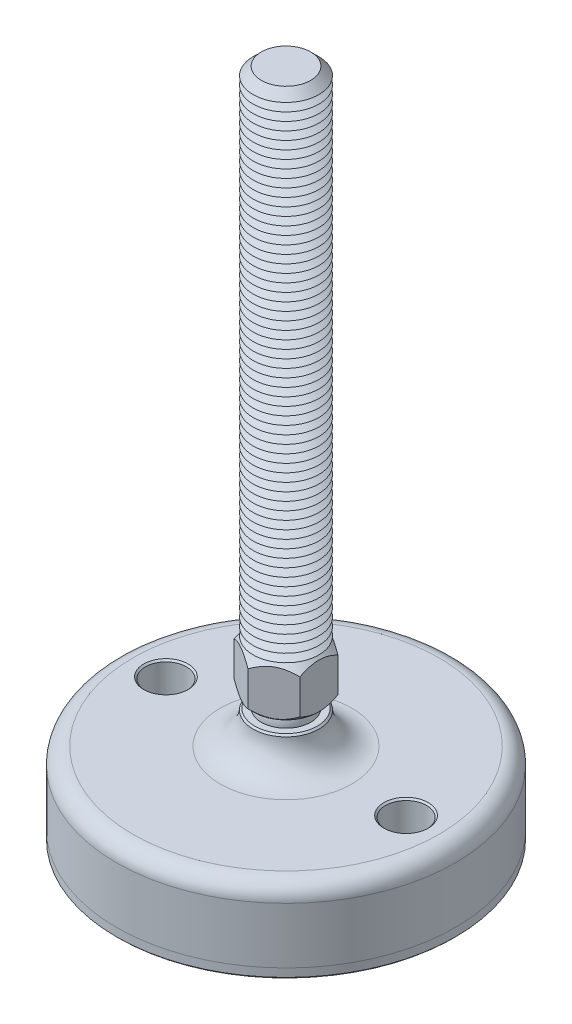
ISO-10303-21;
HEADER;
FILE_DESCRIPTION(('STEP AP214'),'2;1');
FILE_NAME('part.step','',(''),(''),'','','');
FILE_SCHEMA(('AUTOMOTIVE_DESIGN { 1 0 10303 214 1 1 1 1 }'));
ENDSEC;
DATA;
#1=APPLICATION_CONTEXT('core data for automotive mechanical design processes');
#2=APPLICATION_PROTOCOL_DEFINITION('international standard','automotive_design',2000,#1);
#3=PRODUCT_CONTEXT('',#1,'mechanical');
#4=PRODUCT('Part','Part','',(#3));
#5=PRODUCT_RELATED_PRODUCT_CATEGORY('part','',(#4));
#6=PRODUCT_DEFINITION_FORMATION('','',#4);
#7=PRODUCT_DEFINITION_CONTEXT('part definition',#1,'design');
#8=PRODUCT_DEFINITION('design','',#6,#7);
#9=PRODUCT_DEFINITION_SHAPE('','',#8);
#10=(LENGTH_UNIT() NAMED_UNIT(*) SI_UNIT(.MILLI.,.METRE.));
#11=(NAMED_UNIT(*) PLANE_ANGLE_UNIT() SI_UNIT($,.RADIAN.));
#12=(NAMED_UNIT(*) SI_UNIT($,.STERADIAN.) SOLID_ANGLE_UNIT());
#13=UNCERTAINTY_MEASURE_WITH_UNIT(LENGTH_MEASURE(1.E-05),#10,'distance_accuracy_value','');
#14=(GEOMETRIC_REPRESENTATION_CONTEXT(3) GLOBAL_UNCERTAINTY_ASSIGNED_CONTEXT((#13)) GLOBAL_UNIT_ASSIGNED_CONTEXT((#10,
#11,#12)) REPRESENTATION_CONTEXT('',''));
#15=CARTESIAN_POINT('',(0.,0.,0.));
#16=DIRECTION('',(0.,0.,1.));
#17=DIRECTION('',(1.,0.,0.));
#18=AXIS2_PLACEMENT_3D('',#15,#16,#17);
#19=CARTESIAN_POINT('',(0.,-32.,0.));
#20=DIRECTION('',(0.,1.,0.));
#21=DIRECTION('',(0.,0.,1.));
#22=AXIS2_PLACEMENT_3D('',#19,#20,#21);
#23=PLANE('',#22);
#24=CARTESIAN_POINT('',(-36.5,-32.,0.));
#25=DIRECTION('',(0.,1.,0.));
#26=DIRECTION('',(0.,0.,1.));
#27=AXIS2_PLACEMENT_3D('',#24,#25,#26);
#28=CIRCLE('',#27,6.25);
#29=CARTESIAN_POINT('',(-36.5,-32.,6.25));
#30=VERTEX_POINT('',#29);
#31=EDGE_CURVE('P0_E43',#30,#30,#28,.T.);
#32=ORIENTED_EDGE('',*,*,#31,.F.);
#33=EDGE_LOOP('',(#32));
#34=FACE_BOUND('',#33,.T.);
#35=CARTESIAN_POINT('',(36.5,-32.,0.));
#36=DIRECTION('',(0.,1.,0.));
#37=DIRECTION('',(0.,0.,1.));
#38=AXIS2_PLACEMENT_3D('',#35,#36,#37);
#39=CIRCLE('',#38,6.25);
#40=CARTESIAN_POINT('',(36.5,-32.,6.25));
#41=VERTEX_POINT('',#40);
#42=EDGE_CURVE('P0_E44',#41,#41,#39,.T.);
#43=ORIENTED_EDGE('',*,*,#42,.F.);
#44=EDGE_LOOP('',(#43));
#45=FACE_BOUND('',#44,.T.);
#46=CARTESIAN_POINT('',(0.,-32.,0.));
#47=DIRECTION('',(0.,1.,0.));
#48=DIRECTION('',(0.,0.,1.));
#49=AXIS2_PLACEMENT_3D('',#46,#47,#48);
#50=CIRCLE('',#49,51.5);
#51=CARTESIAN_POINT('',(0.,-32.,51.5));
#52=VERTEX_POINT('',#51);
#53=EDGE_CURVE('P0_E40',#52,#52,#50,.T.);
#54=ORIENTED_EDGE('',*,*,#53,.T.);
#55=EDGE_LOOP('',(#54));
#56=FACE_BOUND('',#55,.T.);
#57=ADVANCED_FACE('P0_F14',(#34,#45,#56),#23,.T.);
#58=CARTESIAN_POINT('',(0.,43.1654938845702,0.));
#59=DIRECTION('',(0.,1.,0.));
#60=DIRECTION('',(0.,0.,1.));
#61=AXIS2_PLACEMENT_3D('',#58,#59,#60);
#62=CYLINDRICAL_SURFACE('',#61,51.5);
#63=CARTESIAN_POINT('',(0.,-34.5,0.));
#64=DIRECTION('',(0.,-1.,0.));
#65=DIRECTION('',(0.,0.,-1.));
#66=AXIS2_PLACEMENT_3D('',#63,#64,#65);
#67=CIRCLE('',#66,51.5);
#68=CARTESIAN_POINT('',(0.,-34.5,-51.5));
#69=VERTEX_POINT('',#68);
#70=EDGE_CURVE('P0_E37',#69,#69,#67,.F.);
#71=ORIENTED_EDGE('',*,*,#70,.T.);
#72=EDGE_LOOP('',(#71));
#73=FACE_BOUND('',#72,.T.);
#74=ORIENTED_EDGE('',*,*,#53,.F.);
#75=EDGE_LOOP('',(#74));
#76=FACE_BOUND('',#75,.T.);
#77=ADVANCED_FACE('P0_F54',(#73,#76),#62,.T.);
#78=CARTESIAN_POINT('',(0.,-35.,51.5));
#79=DIRECTION('',(0.,-1.,0.));
#80=DIRECTION('',(0.,0.,-1.));
#81=AXIS2_PLACEMENT_3D('',#78,#79,#80);
#82=PLANE('',#81);
#83=CARTESIAN_POINT('',(36.5,-35.,0.));
#84=DIRECTION('',(0.,-1.,0.));
#85=DIRECTION('',(0.,0.,-1.));
#86=AXIS2_PLACEMENT_3D('',#83,#84,#85);
#87=CIRCLE('',#86,6.75000000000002);
#88=CARTESIAN_POINT('',(36.5,-35.,-6.75000000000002));
#89=VERTEX_POINT('',#88);
#90=EDGE_CURVE('P0_E25',#89,#89,#87,.F.);
#91=ORIENTED_EDGE('',*,*,#90,.T.);
#92=EDGE_LOOP('',(#91));
#93=FACE_BOUND('',#92,.T.);
#94=CARTESIAN_POINT('',(-36.5,-35.,0.));
#95=DIRECTION('',(0.,-1.,0.));
#96=DIRECTION('',(0.,0.,-1.));
#97=AXIS2_PLACEMENT_3D('',#94,#95,#96);
#98=CIRCLE('',#97,6.74999999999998);
#99=CARTESIAN_POINT('',(-36.5,-35.,-6.74999999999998));
#100=VERTEX_POINT('',#99);
#101=EDGE_CURVE('P0_E29',#100,#100,#98,.F.);
#102=ORIENTED_EDGE('',*,*,#101,.T.);
#103=EDGE_LOOP('',(#102));
#104=FACE_BOUND('',#103,.T.);
#105=CARTESIAN_POINT('',(0.,-35.,0.));
#106=DIRECTION('',(0.,-1.,0.));
#107=DIRECTION('',(0.,0.,-1.));
#108=AXIS2_PLACEMENT_3D('',#105,#106,#107);
#109=CIRCLE('',#108,51.);
#110=CARTESIAN_POINT('',(0.,-35.,-51.));
#111=VERTEX_POINT('',#110);
#112=EDGE_CURVE('P0_E34',#111,#111,#109,.T.);
#113=ORIENTED_EDGE('',*,*,#112,.T.);
#114=EDGE_LOOP('',(#113));
#115=FACE_BOUND('',#114,.T.);
#116=ADVANCED_FACE('P0_F61',(#93,#104,#115),#82,.T.);
#117=CARTESIAN_POINT('',(0.,-34.5,0.));
#118=DIRECTION('',(0.,1.,0.));
#119=DIRECTION('',(0.,0.,1.));
#120=AXIS2_PLACEMENT_3D('',#117,#118,#119);
#121=CONICAL_SURFACE('',#120,51.5,0.785398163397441);
#122=ORIENTED_EDGE('',*,*,#112,.F.);
#123=EDGE_LOOP('',(#122));
#124=FACE_BOUND('',#123,.T.);
#125=ORIENTED_EDGE('',*,*,#70,.F.);
#126=EDGE_LOOP('',(#125));
#127=FACE_BOUND('',#126,.T.);
#128=ADVANCED_FACE('P0_F68',(#124,#127),#121,.T.);
#129=CARTESIAN_POINT('',(36.5,-35.,0.));
#130=DIRECTION('',(0.,1.,0.));
#131=DIRECTION('',(0.,0.,1.));
#132=AXIS2_PLACEMENT_3D('',#129,#130,#131);
#133=CYLINDRICAL_SURFACE('',#132,6.25);
#134=CARTESIAN_POINT('',(36.5,-34.5,0.));
#135=DIRECTION('',(0.,-1.,0.));
#136=DIRECTION('',(0.,0.,-1.));
#137=AXIS2_PLACEMENT_3D('',#134,#135,#136);
#138=CIRCLE('',#137,6.25);
#139=CARTESIAN_POINT('',(36.5,-34.5,-6.25));
#140=VERTEX_POINT('',#139);
#141=EDGE_CURVE('P0_E21',#140,#140,#138,.T.);
#142=ORIENTED_EDGE('',*,*,#141,.T.);
#143=EDGE_LOOP('',(#142));
#144=FACE_BOUND('',#143,.T.);
#145=ORIENTED_EDGE('',*,*,#42,.T.);
#146=EDGE_LOOP('',(#145));
#147=FACE_BOUND('',#146,.T.);
#148=ADVANCED_FACE('P0_F74',(#144,#147),#133,.F.);
#149=CARTESIAN_POINT('',(-36.5,-35.,0.));
#150=DIRECTION('',(0.,1.,0.));
#151=DIRECTION('',(0.,0.,1.));
#152=AXIS2_PLACEMENT_3D('',#149,#150,#151);
#153=CYLINDRICAL_SURFACE('',#152,6.25);
#154=CARTESIAN_POINT('',(-36.5,-34.5,0.));
#155=DIRECTION('',(0.,-1.,0.));
#156=DIRECTION('',(0.,0.,-1.));
#157=AXIS2_PLACEMENT_3D('',#154,#155,#156);
#158=CIRCLE('',#157,6.25);
#159=CARTESIAN_POINT('',(-36.5,-34.5,-6.25));
#160=VERTEX_POINT('',#159);
#161=EDGE_CURVE('P0_E10',#160,#160,#158,.T.);
#162=ORIENTED_EDGE('',*,*,#161,.T.);
#163=EDGE_LOOP('',(#162));
#164=FACE_BOUND('',#163,.T.);
#165=ORIENTED_EDGE('',*,*,#31,.T.);
#166=EDGE_LOOP('',(#165));
#167=FACE_BOUND('',#166,.T.);
#168=ADVANCED_FACE('P0_F50',(#164,#167),#153,.F.);
#169=CARTESIAN_POINT('',(36.5,-35.,0.));
#170=DIRECTION('',(0.,-1.,0.));
#171=DIRECTION('',(0.,0.,-1.));
#172=AXIS2_PLACEMENT_3D('',#169,#170,#171);
#173=CONICAL_SURFACE('',#172,6.75000000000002,0.785398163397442);
#174=ORIENTED_EDGE('',*,*,#141,.F.);
#175=EDGE_LOOP('',(#174));
#176=FACE_BOUND('',#175,.T.);
#177=ORIENTED_EDGE('',*,*,#90,.F.);
#178=EDGE_LOOP('',(#177));
#179=FACE_BOUND('',#178,.T.);
#180=ADVANCED_FACE('P0_F76',(#176,#179),#173,.F.);
#181=CARTESIAN_POINT('',(-36.5,-35.,0.));
#182=DIRECTION('',(0.,-1.,0.));
#183=DIRECTION('',(0.,0.,-1.));
#184=AXIS2_PLACEMENT_3D('',#181,#182,#183);
#185=CONICAL_SURFACE('',#184,6.74999999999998,0.785398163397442);
#186=ORIENTED_EDGE('',*,*,#161,.F.);
#187=EDGE_LOOP('',(#186));
#188=FACE_BOUND('',#187,.T.);
#189=ORIENTED_EDGE('',*,*,#101,.F.);
#190=EDGE_LOOP('',(#189));
#191=FACE_BOUND('',#190,.T.);
#192=ADVANCED_FACE('P0_F16',(#188,#191),#185,.F.);
#193=CLOSED_SHELL('',(#57,#77,#116,#128,#148,#168,#180,#192));
#194=MANIFOLD_SOLID_BREP('P0_B1',#193);
#195=CARTESIAN_POINT('',(0.,3.75,0.));
#196=DIRECTION('',(0.,1.,0.));
#197=DIRECTION('',(0.,0.,1.));
#198=AXIS2_PLACEMENT_3D('',#195,#196,#197);
#199=PLANE('',#198);
#200=CARTESIAN_POINT('',(0.,3.75,0.));
#201=DIRECTION('',(0.,1.,0.));
#202=DIRECTION('',(0.,0.,1.));
#203=AXIS2_PLACEMENT_3D('',#200,#201,#202);
#204=CIRCLE('',#203,9.72829454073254);
#205=CARTESIAN_POINT('',(0.,3.75,9.72829454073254));
#206=VERTEX_POINT('',#205);
#207=EDGE_CURVE('P1_E211',#206,#206,#204,.T.);
#208=ORIENTED_EDGE('',*,*,#207,.F.);
#209=EDGE_LOOP('',(#208));
#210=FACE_BOUND('',#209,.T.);
#211=CARTESIAN_POINT('',(0.,3.75,0.));
#212=DIRECTION('',(0.,1.,0.));
#213=DIRECTION('',(0.,0.,1.));
#214=AXIS2_PLACEMENT_3D('',#211,#212,#213);
#215=CIRCLE('',#214,6.49519052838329);
#216=CARTESIAN_POINT('',(0.,3.75,6.49519052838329));
#217=VERTEX_POINT('',#216);
#218=EDGE_CURVE('P1_E24',#217,#217,#215,.F.);
#219=ORIENTED_EDGE('',*,*,#218,.F.);
#220=EDGE_LOOP('',(#219));
#221=FACE_BOUND('',#220,.T.);
#222=ADVANCED_FACE('P1_F16',(#210,#221),#199,.F.);
#223=CARTESIAN_POINT('',(0.,0.,0.));
#224=DIRECTION('',(0.,1.,0.));
#225=DIRECTION('',(0.,0.,-1.));
#226=AXIS2_PLACEMENT_3D('',#223,#224,#225);
#227=SPHERICAL_SURFACE('',#226,7.5);
#228=ORIENTED_EDGE('',*,*,#218,.T.);
#229=EDGE_LOOP('',(#228));
#230=FACE_BOUND('',#229,.T.);
#231=ADVANCED_FACE('P1_F201',(#230),#227,.T.);
#232=CARTESIAN_POINT('',(0.,3.75,0.));
#233=DIRECTION('',(0.,1.,0.));
#234=DIRECTION('',(0.,0.,1.));
#235=AXIS2_PLACEMENT_3D('',#232,#233,#234);
#236=CONICAL_SURFACE('',#235,9.72829454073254,0.785398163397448);
#237=ORIENTED_EDGE('',*,*,#207,.T.);
#238=EDGE_LOOP('',(#237));
#239=FACE_BOUND('',#238,.T.);
#240=CARTESIAN_POINT('',(-10.,9.59571642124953,-11.9394228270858));
#241=CARTESIAN_POINT('',(-10.,9.37430561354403,-11.6505452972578));
#242=CARTESIAN_POINT('',(-10.,9.15490936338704,-11.3600988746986));
#243=CARTESIAN_POINT('',(-10.,8.72106267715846,-10.7754314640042));
#244=CARTESIAN_POINT('',(-10.,8.50661343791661,-10.4812095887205));
#245=CARTESIAN_POINT('',(-10.,8.08205114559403,-9.88620330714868));
#246=CARTESIAN_POINT('',(-10.,7.87198437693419,-9.58538576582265));
#247=CARTESIAN_POINT('',(-10.,7.45926520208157,-8.97872312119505));
#248=CARTESIAN_POINT('',(-10.,7.25661228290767,-8.67287836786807));
#249=CARTESIAN_POINT('',(-10.,6.84809543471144,-8.03614350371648));
#250=CARTESIAN_POINT('',(-10.,6.64281401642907,-7.70487777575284));
#251=CARTESIAN_POINT('',(-10.,6.245142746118,-7.03457466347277));
#252=CARTESIAN_POINT('',(-10.,6.0527550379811,-6.69553599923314));
#253=CARTESIAN_POINT('',(-10.,5.68497951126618,-6.00961937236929));
#254=CARTESIAN_POINT('',(-10.,5.50954176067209,-5.66276839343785));
#255=CARTESIAN_POINT('',(-10.,5.17959635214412,-4.95932933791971));
#256=CARTESIAN_POINT('',(-10.,5.02507889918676,-4.60274591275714));
#257=CARTESIAN_POINT('',(-10.,4.75599518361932,-3.91353381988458));
#258=CARTESIAN_POINT('',(-10.,4.63902686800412,-3.58185263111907));
#259=CARTESIAN_POINT('',(-10.,4.43164927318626,-2.91013341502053));
#260=CARTESIAN_POINT('',(-10.,4.34124171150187,-2.57009484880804));
#261=CARTESIAN_POINT('',(-10.,4.19334931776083,-1.88955843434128));
#262=CARTESIAN_POINT('',(-10.,4.13527351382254,-1.54919119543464));
#263=CARTESIAN_POINT('',(-10.,4.05324021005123,-0.864347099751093));
#264=CARTESIAN_POINT('',(-10.,4.029275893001,-0.519871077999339));
#265=CARTESIAN_POINT('',(-10.,4.01745435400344,0.155191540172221));
#266=CARTESIAN_POINT('',(-10.,4.02812008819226,0.485752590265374));
#267=CARTESIAN_POINT('',(-10.,4.08160326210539,1.1442457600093));
#268=CARTESIAN_POINT('',(-10.,4.12442366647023,1.47217763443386));
#269=CARTESIAN_POINT('',(-10.,4.24054019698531,2.12859326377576));
#270=CARTESIAN_POINT('',(-10.,4.31437036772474,2.45698095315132));
#271=CARTESIAN_POINT('',(-10.,4.48844287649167,3.10654175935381));
#272=CARTESIAN_POINT('',(-10.,4.58868356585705,3.42771532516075));
#273=CARTESIAN_POINT('',(-10.,4.81839210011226,4.08271396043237));
#274=CARTESIAN_POINT('',(-10.,4.94932842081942,4.41601827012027));
#275=CARTESIAN_POINT('',(-10.,5.23140828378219,5.07403931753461));
#276=CARTESIAN_POINT('',(-10.,5.38256099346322,5.3987520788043));
#277=CARTESIAN_POINT('',(-10.,5.70148727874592,6.04113299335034));
#278=CARTESIAN_POINT('',(-10.,5.86931223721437,6.35877542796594));
#279=CARTESIAN_POINT('',(-10.,6.21788686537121,6.98677627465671));
#280=CARTESIAN_POINT('',(-10.,6.39863453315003,7.29713580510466));
#281=CARTESIAN_POINT('',(-10.,6.76133545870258,7.89633938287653));
#282=CARTESIAN_POINT('',(-10.,6.94278731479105,8.18548854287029));
#283=CARTESIAN_POINT('',(-10.,7.31339871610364,8.75881961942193));
#284=CARTESIAN_POINT('',(-10.,7.50255884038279,9.04300116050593));
#285=CARTESIAN_POINT('',(-10.,7.8856676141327,9.6047584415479));
#286=CARTESIAN_POINT('',(-10.,8.07956548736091,9.88236893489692));
#287=CARTESIAN_POINT('',(-10.,8.47254700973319,10.4337838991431));
#288=CARTESIAN_POINT('',(-10.,8.67162921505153,10.7075893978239));
#289=CARTESIAN_POINT('',(-10.,8.87283307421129,10.9797992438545));
#290=B_SPLINE_CURVE_WITH_KNOTS('',3,(#240,#241,#242,#243,#244,#245,#246,#247,#248,#249,#250,
#251,#252,#253,#254,#255,#256,#257,#258,#259,#260,#261,#262,#263,#264,#265,#266,#267,#268,#269,
#270,#271,#272,#273,#274,#275,#276,#277,#278,#279,#280,#281,#282,#283,#284,#285,#286,#287,#288,
#289),.UNSPECIFIED.,.F.,.F.,(4,2,2,2,2,2,2,2,2,2,2,2,2,2,2,2,2,2,2,2,2,2,2,2,4),(0.,
1.09192545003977,2.18411235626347,3.28473497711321,4.3852812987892,5.5541916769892,
6.72329593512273,7.88884387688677,9.05384420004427,10.1080362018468,11.1622963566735,
12.1965943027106,13.2306855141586,14.2212593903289,15.2119246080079,16.2203997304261,
17.2288119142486,18.3022883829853,19.3762532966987,20.4536373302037,21.5308548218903,
22.5548150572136,23.5788523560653,24.5946500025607,25.6101677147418),.UNSPECIFIED.);
#291=CARTESIAN_POINT('',(-10.,5.56871084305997,-5.77350269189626));
#292=VERTEX_POINT('',#291);
#293=CARTESIAN_POINT('',(-10.,5.56871084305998,5.77350269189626));
#294=VERTEX_POINT('',#293);
#295=EDGE_CURVE('P1_E185',#292,#294,#290,.T.);
#296=ORIENTED_EDGE('',*,*,#295,.F.);
#297=CARTESIAN_POINT('',(0.000199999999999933,5.56882631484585,-11.5471208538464));
#298=CARTESIAN_POINT('',(-0.171722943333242,5.4695807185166,-11.447861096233));
#299=CARTESIAN_POINT('',(-0.344992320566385,5.37336355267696,-11.3478239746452));
#300=CARTESIAN_POINT('',(-0.694433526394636,5.18794806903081,-11.1460740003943));
#301=CARTESIAN_POINT('',(-0.870606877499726,5.09875358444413,-11.0443602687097));
#302=CARTESIAN_POINT('',(-1.22689656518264,4.92796770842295,-10.8386563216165));
#303=CARTESIAN_POINT('',(-1.40702970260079,4.84642277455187,-10.7346564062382));
#304=CARTESIAN_POINT('',(-1.77025459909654,4.69270708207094,-10.52494841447));
#305=CARTESIAN_POINT('',(-1.95334590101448,4.62053489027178,-10.4192406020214));
#306=CARTESIAN_POINT('',(-2.31954331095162,4.4878482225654,-10.2078164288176));
#307=CARTESIAN_POINT('',(-2.50260441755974,4.42716910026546,-10.1021260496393));
#308=CARTESIAN_POINT('',(-2.87129282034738,4.31731511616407,-9.88926370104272));
#309=CARTESIAN_POINT('',(-3.05691983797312,4.26813901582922,-9.78209189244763));
#310=CARTESIAN_POINT('',(-3.42994608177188,4.1825291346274,-9.56672509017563));
#311=CARTESIAN_POINT('',(-3.61734032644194,4.14606667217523,-9.45853297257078));
#312=CARTESIAN_POINT('',(-3.99370204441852,4.08668528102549,-9.24124043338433));
#313=CARTESIAN_POINT('',(-4.1826692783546,4.06376432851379,-9.13214015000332));
#314=CARTESIAN_POINT('',(-4.64316633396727,4.0253323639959,-8.86627205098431));
#315=CARTESIAN_POINT('',(-4.91519388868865,4.01726744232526,-8.70921686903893));
#316=CARTESIAN_POINT('',(-5.45875701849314,4.03080424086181,-8.39539054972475));
#317=CARTESIAN_POINT('',(-5.7302923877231,4.05241636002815,-8.23861953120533));
#318=CARTESIAN_POINT('',(-6.27080349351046,4.12403157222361,-7.92655529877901));
#319=CARTESIAN_POINT('',(-6.53977602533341,4.17406641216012,-7.77126393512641));
#320=CARTESIAN_POINT('',(-7.07309796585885,4.29980733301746,-7.46335036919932));
#321=CARTESIAN_POINT('',(-7.33744772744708,4.3755114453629,-7.31072796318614));
#322=CARTESIAN_POINT('',(-7.80670351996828,4.53125365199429,-7.03980300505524));
#323=CARTESIAN_POINT('',(-8.01264886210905,4.60719488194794,-6.92090040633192));
#324=CARTESIAN_POINT('',(-8.42084280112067,4.77131434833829,-6.68522952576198));
#325=CARTESIAN_POINT('',(-8.62309128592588,4.85949295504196,-6.5684613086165));
#326=CARTESIAN_POINT('',(-9.02325448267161,5.04611070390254,-6.33742697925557));
#327=CARTESIAN_POINT('',(-9.22118057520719,5.1445175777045,-6.2231542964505));
#328=CARTESIAN_POINT('',(-9.61336795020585,5.35030005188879,-5.99672480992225));
#329=CARTESIAN_POINT('',(-9.80763139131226,5.45767015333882,-5.88456675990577));
#330=CARTESIAN_POINT('',(-10.0002,5.56882631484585,-5.77338722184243));
#331=B_SPLINE_CURVE_WITH_KNOTS('',3,(#297,#298,#299,#300,#301,#302,#303,#304,#305,#306,#307,
#308,#309,#310,#311,#312,#313,#314,#315,#316,#317,#318,#319,#320,#321,#322,#323,#324,#325,#326,
#327,#328,#329,#330),.UNSPECIFIED.,.F.,.F.,(4,2,2,2,2,2,2,2,2,2,2,2,2,2,2,2,4),(0.,
0.665863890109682,1.33208874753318,2.00212824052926,2.67206515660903,3.33152613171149,
3.99091606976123,4.64880867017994,5.30660292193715,6.24777541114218,7.18927777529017,
8.13183382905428,9.07431761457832,9.82287578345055,10.5714566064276,11.3177436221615,
12.0635761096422),.UNSPECIFIED.);
#332=CARTESIAN_POINT('',(0.,5.56871084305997,-11.5470053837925));
#333=VERTEX_POINT('',#332);
#334=EDGE_CURVE('P1_E179',#333,#292,#331,.T.);
#335=ORIENTED_EDGE('',*,*,#334,.F.);
#336=CARTESIAN_POINT('',(10.0002,5.56882631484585,-5.77338722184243));
#337=CARTESIAN_POINT('',(9.82827705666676,5.4695807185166,-5.87264697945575));
#338=CARTESIAN_POINT('',(9.65500767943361,5.37336355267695,-5.97268410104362));
#339=CARTESIAN_POINT('',(9.30556647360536,5.18794806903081,-6.17443407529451));
#340=CARTESIAN_POINT('',(9.12939312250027,5.09875358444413,-6.27614780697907));
#341=CARTESIAN_POINT('',(8.77310343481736,4.92796770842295,-6.48185175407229));
#342=CARTESIAN_POINT('',(8.59297029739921,4.84642277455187,-6.58585166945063));
#343=CARTESIAN_POINT('',(8.22974540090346,4.69270708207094,-6.79555966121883));
#344=CARTESIAN_POINT('',(8.04665409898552,4.62053489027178,-6.90126747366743));
#345=CARTESIAN_POINT('',(7.68045668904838,4.4878482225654,-7.11269164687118));
#346=CARTESIAN_POINT('',(7.49739558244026,4.42716910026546,-7.21838202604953));
#347=CARTESIAN_POINT('',(7.12870717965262,4.31731511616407,-7.43124437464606));
#348=CARTESIAN_POINT('',(6.94308016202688,4.26813901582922,-7.53841618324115));
#349=CARTESIAN_POINT('',(6.57005391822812,4.1825291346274,-7.75378298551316));
#350=CARTESIAN_POINT('',(6.38265967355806,4.14606667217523,-7.861975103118));
#351=CARTESIAN_POINT('',(6.00629795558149,4.08668528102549,-8.07926764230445));
#352=CARTESIAN_POINT('',(5.81733072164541,4.06376432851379,-8.18836792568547));
#353=CARTESIAN_POINT('',(5.35683366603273,4.0253323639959,-8.45423602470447));
#354=CARTESIAN_POINT('',(5.08480611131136,4.01726744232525,-8.61129120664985));
#355=CARTESIAN_POINT('',(4.54124298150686,4.03080424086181,-8.92511752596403));
#356=CARTESIAN_POINT('',(4.2697076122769,4.05241636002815,-9.08188854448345));
#357=CARTESIAN_POINT('',(3.72919650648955,4.12403157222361,-9.39395277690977));
#358=CARTESIAN_POINT('',(3.46022397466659,4.17406641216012,-9.54924414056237));
#359=CARTESIAN_POINT('',(2.92690203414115,4.29980733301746,-9.85715770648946));
#360=CARTESIAN_POINT('',(2.66255227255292,4.37551144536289,-10.0097801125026));
#361=CARTESIAN_POINT('',(2.19329648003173,4.53125365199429,-10.2807050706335));
#362=CARTESIAN_POINT('',(1.98735113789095,4.60719488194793,-10.3996076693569));
#363=CARTESIAN_POINT('',(1.57915719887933,4.77131434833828,-10.6352785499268));
#364=CARTESIAN_POINT('',(1.37690871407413,4.85949295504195,-10.7520467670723));
#365=CARTESIAN_POINT('',(0.976745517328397,5.04611070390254,-10.9830810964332));
#366=CARTESIAN_POINT('',(0.77881942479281,5.1445175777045,-11.0973537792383));
#367=CARTESIAN_POINT('',(0.386632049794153,5.35030005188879,-11.3237832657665));
#368=CARTESIAN_POINT('',(0.192368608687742,5.45767015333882,-11.435941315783));
#369=CARTESIAN_POINT('',(-0.000199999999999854,5.56882631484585,-11.5471208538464));
#370=B_SPLINE_CURVE_WITH_KNOTS('',3,(#336,#337,#338,#339,#340,#341,#342,#343,#344,#345,#346,
#347,#348,#349,#350,#351,#352,#353,#354,#355,#356,#357,#358,#359,#360,#361,#362,#363,#364,#365,
#366,#367,#368,#369),.UNSPECIFIED.,.F.,.F.,(4,2,2,2,2,2,2,2,2,2,2,2,2,2,2,2,4),(0.,
0.665863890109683,1.33208874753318,2.00212824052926,2.67206515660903,3.33152613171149,
3.99091606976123,4.64880867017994,5.30660292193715,6.24777541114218,7.18927777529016,
8.13183382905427,9.07431761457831,9.82287578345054,10.5714566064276,11.3177436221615,
12.0635761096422),.UNSPECIFIED.);
#371=CARTESIAN_POINT('',(9.99999999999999,5.56871084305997,-5.77350269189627));
#372=VERTEX_POINT('',#371);
#373=EDGE_CURVE('P1_E167',#372,#333,#370,.T.);
#374=ORIENTED_EDGE('',*,*,#373,.F.);
#375=CARTESIAN_POINT('',(10.,9.59571642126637,-11.9394228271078));
#376=CARTESIAN_POINT('',(10.,9.37430561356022,-11.6505452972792));
#377=CARTESIAN_POINT('',(10.,9.15490936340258,-11.3600988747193));
#378=CARTESIAN_POINT('',(10.,8.7210626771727,-10.7754314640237));
#379=CARTESIAN_POINT('',(10.,8.5066134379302,-10.4812095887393));
#380=CARTESIAN_POINT('',(10.,8.08205114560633,-9.88620330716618));
#381=CARTESIAN_POINT('',(10.,7.87198437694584,-9.58538576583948));
#382=CARTESIAN_POINT('',(10.,7.45926520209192,-8.97872312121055));
#383=CARTESIAN_POINT('',(10.,7.25661228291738,-8.67287836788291));
#384=CARTESIAN_POINT('',(10.,6.84809543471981,-8.03614350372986));
#385=CARTESIAN_POINT('',(10.,6.64281401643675,-7.70487777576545));
#386=CARTESIAN_POINT('',(10.,6.24514274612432,-7.03457466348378));
#387=CARTESIAN_POINT('',(10.,6.05275503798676,-6.69553599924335));
#388=CARTESIAN_POINT('',(10.,5.68497951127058,-6.00961937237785));
#389=CARTESIAN_POINT('',(10.,5.50954176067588,-5.66276839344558));
#390=CARTESIAN_POINT('',(10.,5.17959635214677,-4.95932933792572));
#391=CARTESIAN_POINT('',(10.,5.02507889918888,-4.60274591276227));
#392=CARTESIAN_POINT('',(10.,4.75599518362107,-3.91353381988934));
#393=CARTESIAN_POINT('',(10.,4.63902686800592,-3.58185263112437));
#394=CARTESIAN_POINT('',(10.,4.43164927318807,-2.91013341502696));
#395=CARTESIAN_POINT('',(10.,4.34124171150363,-2.57009484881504));
#396=CARTESIAN_POINT('',(10.,4.19334931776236,-1.8895584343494));
#397=CARTESIAN_POINT('',(10.,4.13527351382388,-1.54919119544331));
#398=CARTESIAN_POINT('',(10.,4.05324021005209,-0.86434709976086));
#399=CARTESIAN_POINT('',(10.,4.02927589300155,-0.519871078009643));
#400=CARTESIAN_POINT('',(10.,4.01745435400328,0.155191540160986));
#401=CARTESIAN_POINT('',(10.,4.0281200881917,0.485752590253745));
#402=CARTESIAN_POINT('',(10.,4.08160326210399,1.14424575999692));
#403=CARTESIAN_POINT('',(10.,4.12442366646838,1.47217763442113));
#404=CARTESIAN_POINT('',(10.,4.24054019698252,2.12859326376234));
#405=CARTESIAN_POINT('',(10.,4.31437036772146,2.45698095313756));
#406=CARTESIAN_POINT('',(10.,4.48844287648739,3.1065417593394));
#407=CARTESIAN_POINT('',(10.,4.58868356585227,3.42771532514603));
#408=CARTESIAN_POINT('',(10.,4.81839210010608,4.08271396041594));
#409=CARTESIAN_POINT('',(10.,4.94932842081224,4.41601827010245));
#410=CARTESIAN_POINT('',(10.,5.23140828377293,5.0740393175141));
#411=CARTESIAN_POINT('',(10.,5.38256099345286,5.39875207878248));
#412=CARTESIAN_POINT('',(10.,5.70148727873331,6.04113299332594));
#413=CARTESIAN_POINT('',(10.,5.86931223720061,6.35877542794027));
#414=CARTESIAN_POINT('',(10.,6.21788686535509,6.98677627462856));
#415=CARTESIAN_POINT('',(10.,6.39863453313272,7.29713580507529));
#416=CARTESIAN_POINT('',(10.,6.761335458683,7.89633938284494));
#417=CARTESIAN_POINT('',(10.,6.9427873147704,8.18548854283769));
#418=CARTESIAN_POINT('',(10.,7.31339871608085,8.75881961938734));
#419=CARTESIAN_POINT('',(10.,7.50255884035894,9.04300116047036));
#420=CARTESIAN_POINT('',(10.,7.88566761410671,9.60475844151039));
#421=CARTESIAN_POINT('',(10.,8.07956548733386,9.88236893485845));
#422=CARTESIAN_POINT('',(10.,8.47254700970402,10.4337838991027));
#423=CARTESIAN_POINT('',(10.,8.6716292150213,10.7075893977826));
#424=CARTESIAN_POINT('',(10.,8.87283307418,10.9797992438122));
#425=B_SPLINE_CURVE_WITH_KNOTS('',3,(#375,#376,#377,#378,#379,#380,#381,#382,#383,#384,#385,
#386,#387,#388,#389,#390,#391,#392,#393,#394,#395,#396,#397,#398,#399,#400,#401,#402,#403,#404,
#405,#406,#407,#408,#409,#410,#411,#412,#413,#414,#415,#416,#417,#418,#419,#420,#421,#422,#423,
#424),.UNSPECIFIED.,.F.,.F.,(4,2,2,2,2,2,2,2,2,2,2,2,2,2,2,2,2,2,2,2,2,2,2,2,4),(0.,
1.09192545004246,2.18411235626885,3.28473497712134,4.38528129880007,5.55419167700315,
6.72329593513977,7.88884387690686,9.05384420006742,10.1080362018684,11.1622963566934,
12.196594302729,13.2306855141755,14.2212593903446,15.2119246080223,16.2203997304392,
17.2288119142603,18.3022883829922,19.3762532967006,20.4536373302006,21.5308548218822,
22.5548150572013,23.5788523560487,24.5946500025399,25.6101677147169),.UNSPECIFIED.);
#426=CARTESIAN_POINT('',(10.,5.56871084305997,5.77350269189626));
#427=VERTEX_POINT('',#426);
#428=EDGE_CURVE('P1_E70',#427,#372,#425,.F.);
#429=ORIENTED_EDGE('',*,*,#428,.F.);
#430=CARTESIAN_POINT('',(-0.000200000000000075,5.56882631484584,11.5471208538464));
#431=CARTESIAN_POINT('',(0.171722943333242,5.4695807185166,11.447861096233));
#432=CARTESIAN_POINT('',(0.344992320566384,5.37336355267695,11.3478239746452));
#433=CARTESIAN_POINT('',(0.694433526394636,5.18794806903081,11.1460740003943));
#434=CARTESIAN_POINT('',(0.870606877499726,5.09875358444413,11.0443602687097));
#435=CARTESIAN_POINT('',(1.22689656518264,4.92796770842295,10.8386563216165));
#436=CARTESIAN_POINT('',(1.40702970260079,4.84642277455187,10.7346564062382));
#437=CARTESIAN_POINT('',(1.77025459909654,4.69270708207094,10.52494841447));
#438=CARTESIAN_POINT('',(1.95334590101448,4.62053489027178,10.4192406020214));
#439=CARTESIAN_POINT('',(2.31954331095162,4.4878482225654,10.2078164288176));
#440=CARTESIAN_POINT('',(2.50260441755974,4.42716910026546,10.1021260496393));
#441=CARTESIAN_POINT('',(2.87129282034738,4.31731511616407,9.88926370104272));
#442=CARTESIAN_POINT('',(3.05691983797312,4.26813901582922,9.78209189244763));
#443=CARTESIAN_POINT('',(3.42994608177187,4.18252913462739,9.56672509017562));
#444=CARTESIAN_POINT('',(3.61734032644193,4.14606667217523,9.45853297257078));
#445=CARTESIAN_POINT('',(3.99370204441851,4.08668528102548,9.24124043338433));
#446=CARTESIAN_POINT('',(4.18266927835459,4.06376432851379,9.13214015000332));
#447=CARTESIAN_POINT('',(4.64316633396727,4.0253323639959,8.86627205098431));
#448=CARTESIAN_POINT('',(4.91519388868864,4.01726744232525,8.70921686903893));
#449=CARTESIAN_POINT('',(5.45875701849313,4.03080424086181,8.39539054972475));
#450=CARTESIAN_POINT('',(5.7302923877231,4.05241636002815,8.23861953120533));
#451=CARTESIAN_POINT('',(6.27080349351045,4.1240315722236,7.92655529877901));
#452=CARTESIAN_POINT('',(6.53977602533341,4.17406641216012,7.77126393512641));
#453=CARTESIAN_POINT('',(7.07309796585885,4.29980733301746,7.46335036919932));
#454=CARTESIAN_POINT('',(7.33744772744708,4.37551144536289,7.31072796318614));
#455=CARTESIAN_POINT('',(7.80670351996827,4.53125365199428,7.03980300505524));
#456=CARTESIAN_POINT('',(8.01264886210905,4.60719488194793,6.92090040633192));
#457=CARTESIAN_POINT('',(8.42084280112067,4.77131434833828,6.68522952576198));
#458=CARTESIAN_POINT('',(8.62309128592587,4.85949295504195,6.5684613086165));
#459=CARTESIAN_POINT('',(9.0232544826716,5.04611070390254,6.33742697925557));
#460=CARTESIAN_POINT('',(9.22118057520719,5.1445175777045,6.2231542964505));
#461=CARTESIAN_POINT('',(9.61336795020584,5.35030005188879,5.99672480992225));
#462=CARTESIAN_POINT('',(9.80763139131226,5.45767015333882,5.88456675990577));
#463=CARTESIAN_POINT('',(10.0002,5.56882631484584,5.77338722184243));
#464=B_SPLINE_CURVE_WITH_KNOTS('',3,(#430,#431,#432,#433,#434,#435,#436,#437,#438,#439,#440,
#441,#442,#443,#444,#445,#446,#447,#448,#449,#450,#451,#452,#453,#454,#455,#456,#457,#458,#459,
#460,#461,#462,#463),.UNSPECIFIED.,.F.,.F.,(4,2,2,2,2,2,2,2,2,2,2,2,2,2,2,2,4),(0.,
0.665863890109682,1.33208874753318,2.00212824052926,2.67206515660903,3.33152613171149,
3.99091606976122,4.64880867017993,5.30660292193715,6.24777541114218,7.18927777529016,
8.13183382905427,9.07431761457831,9.82287578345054,10.5714566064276,11.3177436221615,
12.0635761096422),.UNSPECIFIED.);
#465=CARTESIAN_POINT('',(0.,5.56871084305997,11.5470053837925));
#466=VERTEX_POINT('',#465);
#467=EDGE_CURVE('P1_E67',#466,#427,#464,.T.);
#468=ORIENTED_EDGE('',*,*,#467,.F.);
#469=CARTESIAN_POINT('',(-10.0002,5.56882631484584,5.77338722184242));
#470=CARTESIAN_POINT('',(-9.82827705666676,5.4695807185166,5.87264697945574));
#471=CARTESIAN_POINT('',(-9.65500767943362,5.37336355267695,5.97268410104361));
#472=CARTESIAN_POINT('',(-9.30556647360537,5.18794806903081,6.1744340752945));
#473=CARTESIAN_POINT('',(-9.12939312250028,5.09875358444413,6.27614780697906));
#474=CARTESIAN_POINT('',(-8.77310343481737,4.92796770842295,6.48185175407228));
#475=CARTESIAN_POINT('',(-8.59297029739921,4.84642277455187,6.58585166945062));
#476=CARTESIAN_POINT('',(-8.22974540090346,4.69270708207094,6.79555966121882));
#477=CARTESIAN_POINT('',(-8.04665409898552,4.62053489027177,6.90126747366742));
#478=CARTESIAN_POINT('',(-7.68045668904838,4.48784822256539,7.11269164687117));
#479=CARTESIAN_POINT('',(-7.49739558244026,4.42716910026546,7.21838202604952));
#480=CARTESIAN_POINT('',(-7.12870717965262,4.31731511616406,7.43124437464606));
#481=CARTESIAN_POINT('',(-6.94308016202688,4.26813901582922,7.53841618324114));
#482=CARTESIAN_POINT('',(-6.57005391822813,4.18252913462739,7.75378298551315));
#483=CARTESIAN_POINT('',(-6.38265967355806,4.14606667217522,7.861975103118));
#484=CARTESIAN_POINT('',(-6.00629795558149,4.08668528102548,8.07926764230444));
#485=CARTESIAN_POINT('',(-5.81733072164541,4.06376432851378,8.18836792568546));
#486=CARTESIAN_POINT('',(-5.35683366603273,4.0253323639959,8.45423602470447));
#487=CARTESIAN_POINT('',(-5.08480611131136,4.01726744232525,8.61129120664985));
#488=CARTESIAN_POINT('',(-4.54124298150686,4.0308042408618,8.92511752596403));
#489=CARTESIAN_POINT('',(-4.2697076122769,4.05241636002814,9.08188854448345));
#490=CARTESIAN_POINT('',(-3.72919650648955,4.1240315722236,9.39395277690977));
#491=CARTESIAN_POINT('',(-3.46022397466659,4.17406641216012,9.54924414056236));
#492=CARTESIAN_POINT('',(-2.92690203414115,4.29980733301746,9.85715770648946));
#493=CARTESIAN_POINT('',(-2.66255227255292,4.37551144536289,10.0097801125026));
#494=CARTESIAN_POINT('',(-2.19329648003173,4.53125365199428,10.2807050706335));
#495=CARTESIAN_POINT('',(-1.98735113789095,4.60719488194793,10.3996076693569));
#496=CARTESIAN_POINT('',(-1.57915719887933,4.77131434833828,10.6352785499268));
#497=CARTESIAN_POINT('',(-1.37690871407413,4.85949295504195,10.7520467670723));
#498=CARTESIAN_POINT('',(-0.976745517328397,5.04611070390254,10.9830810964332));
#499=CARTESIAN_POINT('',(-0.778819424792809,5.1445175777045,11.0973537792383));
#500=CARTESIAN_POINT('',(-0.386632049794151,5.35030005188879,11.3237832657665));
#501=CARTESIAN_POINT('',(-0.192368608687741,5.45767015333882,11.435941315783));
#502=CARTESIAN_POINT('',(0.000199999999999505,5.56882631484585,11.5471208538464));
#503=B_SPLINE_CURVE_WITH_KNOTS('',3,(#469,#470,#471,#472,#473,#474,#475,#476,#477,#478,#479,
#480,#481,#482,#483,#484,#485,#486,#487,#488,#489,#490,#491,#492,#493,#494,#495,#496,#497,#498,
#499,#500,#501,#502),.UNSPECIFIED.,.F.,.F.,(4,2,2,2,2,2,2,2,2,2,2,2,2,2,2,2,4),(0.,
0.665863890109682,1.33208874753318,2.00212824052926,2.67206515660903,3.33152613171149,
3.99091606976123,4.64880867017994,5.30660292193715,6.24777541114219,7.18927777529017,
8.13183382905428,9.07431761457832,9.82287578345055,10.5714566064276,11.3177436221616,
12.0635761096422),.UNSPECIFIED.);
#504=EDGE_CURVE('P1_E39',#294,#466,#503,.T.);
#505=ORIENTED_EDGE('',*,*,#504,.F.);
#506=EDGE_LOOP('',(#296,#335,#374,#429,#468,#505));
#507=FACE_BOUND('',#506,.T.);
#508=ADVANCED_FACE('P1_F68',(#239,#507),#236,.T.);
#509=CARTESIAN_POINT('',(-10.,19.,-5.77350269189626));
#510=DIRECTION('',(1.,0.,0.));
#511=DIRECTION('',(0.,0.,-1.));
#512=AXIS2_PLACEMENT_3D('',#509,#510,#511);
#513=PLANE('',#512);
#514=DIRECTION('',(0.,-1.,0.));
#515=VECTOR('',#514,1.);
#516=CARTESIAN_POINT('',(-10.,19.,5.77350269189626));
#517=LINE('',#516,#515);
#518=CARTESIAN_POINT('',(-10.,16.1132486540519,5.77350269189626));
#519=VERTEX_POINT('',#518);
#520=EDGE_CURVE('P1_E83',#519,#294,#517,.T.);
#521=ORIENTED_EDGE('',*,*,#520,.F.);
#522=CARTESIAN_POINT('',(-10.,12.4093918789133,-11.5147208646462));
#523=CARTESIAN_POINT('',(-10.,12.6210295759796,-11.2343500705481));
#524=CARTESIAN_POINT('',(-10.,12.8306215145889,-10.9524094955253));
#525=CARTESIAN_POINT('',(-10.,13.2447979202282,-10.3847695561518));
#526=CARTESIAN_POINT('',(-10.,13.4493811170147,-10.0990692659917));
#527=CARTESIAN_POINT('',(-10.,13.8540786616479,-9.52120077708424));
#528=CARTESIAN_POINT('',(-10.,14.0541461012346,-9.22899961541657));
#529=CARTESIAN_POINT('',(-10.,14.4468132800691,-8.63963749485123));
#530=CARTESIAN_POINT('',(-10.,14.6394135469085,-8.34247688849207));
#531=CARTESIAN_POINT('',(-10.,15.0262335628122,-7.72525702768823));
#532=CARTESIAN_POINT('',(-10.,15.2199166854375,-7.40485974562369));
#533=CARTESIAN_POINT('',(-10.,15.5945399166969,-6.75658646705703));
#534=CARTESIAN_POINT('',(-10.,15.7754780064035,-6.4287092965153));
#535=CARTESIAN_POINT('',(-10.,16.1207071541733,-5.76550673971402));
#536=CARTESIAN_POINT('',(-10.,16.285047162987,-5.43020703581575));
#537=CARTESIAN_POINT('',(-10.,16.5934011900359,-4.75046311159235));
#538=CARTESIAN_POINT('',(-10.,16.7374244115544,-4.40602311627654));
#539=CARTESIAN_POINT('',(-10.,16.9894496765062,-3.73558113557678));
#540=CARTESIAN_POINT('',(-10.,17.0994177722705,-3.41032595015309));
#541=CARTESIAN_POINT('',(-10.,17.2932601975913,-2.75198473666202));
#542=CARTESIAN_POINT('',(-10.,17.377132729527,-2.4188981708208));
#543=CARTESIAN_POINT('',(-10.,17.5130086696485,-1.7524231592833));
#544=CARTESIAN_POINT('',(-10.,17.565558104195,-1.41914787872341));
#545=CARTESIAN_POINT('',(-10.,17.6377678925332,-0.749034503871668));
#546=CARTESIAN_POINT('',(-10.,17.6574338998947,-0.412197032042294));
#547=CARTESIAN_POINT('',(-10.,17.6624162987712,0.249527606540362));
#548=CARTESIAN_POINT('',(-10.,17.6489502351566,0.574406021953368));
#549=CARTESIAN_POINT('',(-10.,17.5910984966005,1.22138001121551));
#550=CARTESIAN_POINT('',(-10.,17.5467098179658,1.54347531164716));
#551=CARTESIAN_POINT('',(-10.,17.4286795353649,2.18799750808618));
#552=CARTESIAN_POINT('',(-10.,17.3545401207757,2.51033177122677));
#553=CARTESIAN_POINT('',(-10.,17.180962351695,3.14797698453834));
#554=CARTESIAN_POINT('',(-10.,17.0815261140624,3.46328851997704));
#555=CARTESIAN_POINT('',(-10.,16.8512186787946,4.11544298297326));
#556=CARTESIAN_POINT('',(-10.,16.7182795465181,4.45154819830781));
#557=CARTESIAN_POINT('',(-10.,16.431992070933,5.115028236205));
#558=CARTESIAN_POINT('',(-10.,16.2786342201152,5.4423989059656));
#559=CARTESIAN_POINT('',(-10.,15.9551580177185,6.09000973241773));
#560=CARTESIAN_POINT('',(-10.,15.7849870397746,6.41022338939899));
#561=CARTESIAN_POINT('',(-10.,15.4316458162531,7.04328175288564));
#562=CARTESIAN_POINT('',(-10.,15.2484776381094,7.35612762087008));
#563=CARTESIAN_POINT('',(-10.,14.8810750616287,7.96002022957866));
#564=CARTESIAN_POINT('',(-10.,14.6973474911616,8.25137695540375));
#565=CARTESIAN_POINT('',(-10.,14.3221662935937,8.82908851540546));
#566=CARTESIAN_POINT('',(-10.,14.1307120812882,9.1154429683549));
#567=CARTESIAN_POINT('',(-10.,13.7430400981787,9.68148259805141));
#568=CARTESIAN_POINT('',(-10.,13.5468736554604,9.96120305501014));
#569=CARTESIAN_POINT('',(-10.,13.149353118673,10.5168212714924));
#570=CARTESIAN_POINT('',(-10.,12.9480004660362,10.7927200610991));
#571=CARTESIAN_POINT('',(-10.,12.7445274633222,11.0670185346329));
#572=B_SPLINE_CURVE_WITH_KNOTS('',3,(#522,#523,#524,#525,#526,#527,#528,#529,#530,#531,#532,
#533,#534,#535,#536,#537,#538,#539,#540,#541,#542,#543,#544,#545,#546,#547,#548,#549,#550,#551,
#552,#553,#554,#555,#556,#557,#558,#559,#560,#561,#562,#563,#564,#565,#566,#567,#568,#569,#570,
#571),.UNSPECIFIED.,.F.,.F.,(4,2,2,2,2,2,2,2,2,2,2,2,2,2,2,2,2,2,2,2,2,2,2,2,4),(0.,
1.05386365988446,2.10799187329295,3.17028777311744,4.23250847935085,5.35544154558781,
6.47855209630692,7.5982472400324,8.71743353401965,9.74655549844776,10.7757483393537,
11.7864315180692,12.7969409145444,13.7708741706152,14.7449020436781,15.7359570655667,
16.7269291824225,17.8104078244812,18.8943927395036,19.981885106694,21.0692048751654,
22.1024062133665,23.1356859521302,24.1605722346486,25.1851766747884),.UNSPECIFIED.);
#573=CARTESIAN_POINT('',(-10.,16.1132486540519,-5.77350269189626));
#574=VERTEX_POINT('',#573);
#575=EDGE_CURVE('P1_E84',#519,#574,#572,.F.);
#576=ORIENTED_EDGE('',*,*,#575,.T.);
#577=DIRECTION('',(0.,-1.,0.));
#578=VECTOR('',#577,1.);
#579=CARTESIAN_POINT('',(-10.,19.,-5.77350269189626));
#580=LINE('',#579,#578);
#581=EDGE_CURVE('P1_E100',#574,#292,#580,.T.);
#582=ORIENTED_EDGE('',*,*,#581,.T.);
#583=ORIENTED_EDGE('',*,*,#295,.T.);
#584=EDGE_LOOP('',(#521,#576,#582,#583));
#585=FACE_BOUND('',#584,.T.);
#586=ADVANCED_FACE('P1_F193',(#585),#513,.F.);
#587=CARTESIAN_POINT('',(0.,19.,-11.5470053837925));
#588=DIRECTION('',(0.5,0.,0.866025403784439));
#589=DIRECTION('',(0.866025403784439,0.,-0.5));
#590=AXIS2_PLACEMENT_3D('',#587,#588,#589);
#591=PLANE('',#590);
#592=ORIENTED_EDGE('',*,*,#581,.F.);
#593=CARTESIAN_POINT('',(-10.0002,16.113133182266,-5.77338722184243));
#594=CARTESIAN_POINT('',(-9.82827705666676,16.2123787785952,-5.87264697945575));
#595=CARTESIAN_POINT('',(-9.65500767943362,16.3085959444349,-5.97268410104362));
#596=CARTESIAN_POINT('',(-9.30556647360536,16.494011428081,-6.17443407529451));
#597=CARTESIAN_POINT('',(-9.12939312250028,16.5832059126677,-6.27614780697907));
#598=CARTESIAN_POINT('',(-8.77310343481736,16.7539917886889,-6.48185175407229));
#599=CARTESIAN_POINT('',(-8.59297029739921,16.83553672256,-6.58585166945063));
#600=CARTESIAN_POINT('',(-8.22974540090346,16.9892524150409,-6.79555966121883));
#601=CARTESIAN_POINT('',(-8.04665409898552,17.0614246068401,-6.90126747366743));
#602=CARTESIAN_POINT('',(-7.68045668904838,17.1941112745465,-7.11269164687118));
#603=CARTESIAN_POINT('',(-7.49739558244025,17.2547903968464,-7.21838202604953));
#604=CARTESIAN_POINT('',(-7.12870717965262,17.3646443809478,-7.43124437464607));
#605=CARTESIAN_POINT('',(-6.94308016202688,17.4138204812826,-7.53841618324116));
#606=CARTESIAN_POINT('',(-6.57005391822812,17.4994303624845,-7.75378298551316));
#607=CARTESIAN_POINT('',(-6.38265967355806,17.5358928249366,-7.86197510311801));
#608=CARTESIAN_POINT('',(-6.00629795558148,17.5952742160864,-8.07926764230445));
#609=CARTESIAN_POINT('',(-5.8173307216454,17.6181951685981,-8.18836792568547));
#610=CARTESIAN_POINT('',(-5.35683366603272,17.6566271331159,-8.45423602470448));
#611=CARTESIAN_POINT('',(-5.08480611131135,17.6646920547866,-8.61129120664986));
#612=CARTESIAN_POINT('',(-4.54124298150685,17.65115525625,-8.92511752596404));
#613=CARTESIAN_POINT('',(-4.26970761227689,17.6295431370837,-9.08188854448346));
#614=CARTESIAN_POINT('',(-3.72919650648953,17.5579279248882,-9.39395277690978));
#615=CARTESIAN_POINT('',(-3.46022397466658,17.5078930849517,-9.54924414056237));
#616=CARTESIAN_POINT('',(-2.92690203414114,17.3821521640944,-9.85715770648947));
#617=CARTESIAN_POINT('',(-2.66255227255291,17.3064480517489,-10.0097801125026));
#618=CARTESIAN_POINT('',(-2.19329648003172,17.1507058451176,-10.2807050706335));
#619=CARTESIAN_POINT('',(-1.98735113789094,17.0747646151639,-10.3996076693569));
#620=CARTESIAN_POINT('',(-1.57915719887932,16.9106451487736,-10.6352785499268));
#621=CARTESIAN_POINT('',(-1.37690871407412,16.8224665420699,-10.7520467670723));
#622=CARTESIAN_POINT('',(-0.976745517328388,16.6358487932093,-10.9830810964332));
#623=CARTESIAN_POINT('',(-0.778819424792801,16.5374419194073,-11.0973537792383));
#624=CARTESIAN_POINT('',(-0.386632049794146,16.3316594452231,-11.3237832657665));
#625=CARTESIAN_POINT('',(-0.192368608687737,16.224289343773,-11.435941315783));
#626=CARTESIAN_POINT('',(0.000200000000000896,16.113133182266,-11.5471208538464));
#627=B_SPLINE_CURVE_WITH_KNOTS('',3,(#593,#594,#595,#596,#597,#598,#599,#600,#601,#602,#603,
#604,#605,#606,#607,#608,#609,#610,#611,#612,#613,#614,#615,#616,#617,#618,#619,#620,#621,#622,
#623,#624,#625,#626),.UNSPECIFIED.,.F.,.F.,(4,2,2,2,2,2,2,2,2,2,2,2,2,2,2,2,4),(0.,
0.665863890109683,1.33208874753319,2.00212824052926,2.67206515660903,3.3315261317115,
3.99091606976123,4.64880867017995,5.30660292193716,6.24777541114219,7.18927777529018,
8.13183382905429,9.07431761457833,9.82287578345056,10.5714566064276,11.3177436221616,
12.0635761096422),.UNSPECIFIED.);
#628=CARTESIAN_POINT('',(0.,16.1132486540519,-11.5470053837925));
#629=VERTEX_POINT('',#628);
#630=EDGE_CURVE('P1_E31',#574,#629,#627,.T.);
#631=ORIENTED_EDGE('',*,*,#630,.T.);
#632=DIRECTION('',(0.,-1.,0.));
#633=VECTOR('',#632,1.);
#634=CARTESIAN_POINT('',(0.,19.,-11.5470053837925));
#635=LINE('',#634,#633);
#636=EDGE_CURVE('P1_E97',#629,#333,#635,.T.);
#637=ORIENTED_EDGE('',*,*,#636,.T.);
#638=ORIENTED_EDGE('',*,*,#334,.T.);
#639=EDGE_LOOP('',(#592,#631,#637,#638));
#640=FACE_BOUND('',#639,.T.);
#641=ADVANCED_FACE('P1_F190',(#640),#591,.F.);
#642=CARTESIAN_POINT('',(10.,19.,-5.77350269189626));
#643=DIRECTION('',(-0.5,0.,0.866025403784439));
#644=DIRECTION('',(0.866025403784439,0.,0.5));
#645=AXIS2_PLACEMENT_3D('',#642,#643,#644);
#646=PLANE('',#645);
#647=ORIENTED_EDGE('',*,*,#636,.F.);
#648=CARTESIAN_POINT('',(-0.000199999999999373,16.113133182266,-11.5471208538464));
#649=CARTESIAN_POINT('',(0.171722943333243,16.2123787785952,-11.447861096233));
#650=CARTESIAN_POINT('',(0.344992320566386,16.3085959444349,-11.3478239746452));
#651=CARTESIAN_POINT('',(0.694433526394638,16.494011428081,-11.1460740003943));
#652=CARTESIAN_POINT('',(0.870606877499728,16.5832059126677,-11.0443602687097));
#653=CARTESIAN_POINT('',(1.22689656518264,16.7539917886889,-10.8386563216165));
#654=CARTESIAN_POINT('',(1.4070297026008,16.83553672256,-10.7346564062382));
#655=CARTESIAN_POINT('',(1.77025459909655,16.9892524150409,-10.52494841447));
#656=CARTESIAN_POINT('',(1.95334590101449,17.0614246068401,-10.4192406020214));
#657=CARTESIAN_POINT('',(2.31954331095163,17.1941112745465,-10.2078164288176));
#658=CARTESIAN_POINT('',(2.50260441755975,17.2547903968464,-10.1021260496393));
#659=CARTESIAN_POINT('',(2.87129282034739,17.3646443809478,-9.88926370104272));
#660=CARTESIAN_POINT('',(3.05691983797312,17.4138204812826,-9.78209189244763));
#661=CARTESIAN_POINT('',(3.42994608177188,17.4994303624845,-9.56672509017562));
#662=CARTESIAN_POINT('',(3.61734032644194,17.5358928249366,-9.45853297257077));
#663=CARTESIAN_POINT('',(3.99370204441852,17.5952742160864,-9.24124043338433));
#664=CARTESIAN_POINT('',(4.1826692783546,17.6181951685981,-9.13214015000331));
#665=CARTESIAN_POINT('',(4.64316633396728,17.6566271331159,-8.86627205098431));
#666=CARTESIAN_POINT('',(4.91519388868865,17.6646920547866,-8.70921686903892));
#667=CARTESIAN_POINT('',(5.45875701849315,17.65115525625,-8.39539054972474));
#668=CARTESIAN_POINT('',(5.73029238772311,17.6295431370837,-8.23861953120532));
#669=CARTESIAN_POINT('',(6.27080349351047,17.5579279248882,-7.92655529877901));
#670=CARTESIAN_POINT('',(6.53977602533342,17.5078930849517,-7.77126393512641));
#671=CARTESIAN_POINT('',(7.07309796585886,17.3821521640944,-7.46335036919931));
#672=CARTESIAN_POINT('',(7.33744772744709,17.3064480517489,-7.31072796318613));
#673=CARTESIAN_POINT('',(7.80670351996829,17.1507058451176,-7.03980300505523));
#674=CARTESIAN_POINT('',(8.01264886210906,17.0747646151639,-6.92090040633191));
#675=CARTESIAN_POINT('',(8.42084280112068,16.9106451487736,-6.68522952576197));
#676=CARTESIAN_POINT('',(8.62309128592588,16.8224665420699,-6.5684613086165));
#677=CARTESIAN_POINT('',(9.02325448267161,16.6358487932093,-6.33742697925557));
#678=CARTESIAN_POINT('',(9.2211805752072,16.5374419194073,-6.2231542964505));
#679=CARTESIAN_POINT('',(9.61336795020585,16.3316594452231,-5.99672480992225));
#680=CARTESIAN_POINT('',(9.80763139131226,16.224289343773,-5.88456675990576));
#681=CARTESIAN_POINT('',(10.0002,16.113133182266,-5.77338722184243));
#682=B_SPLINE_CURVE_WITH_KNOTS('',3,(#648,#649,#650,#651,#652,#653,#654,#655,#656,#657,#658,
#659,#660,#661,#662,#663,#664,#665,#666,#667,#668,#669,#670,#671,#672,#673,#674,#675,#676,#677,
#678,#679,#680,#681),.UNSPECIFIED.,.F.,.F.,(4,2,2,2,2,2,2,2,2,2,2,2,2,2,2,2,4),(0.,
0.665863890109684,1.33208874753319,2.00212824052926,2.67206515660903,3.3315261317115,
3.99091606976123,4.64880867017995,5.30660292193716,6.24777541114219,7.18927777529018,
8.13183382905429,9.07431761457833,9.82287578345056,10.5714566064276,11.3177436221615,
12.0635761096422),.UNSPECIFIED.);
#683=CARTESIAN_POINT('',(10.,16.1132486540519,-5.77350269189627));
#684=VERTEX_POINT('',#683);
#685=EDGE_CURVE('P1_E143',#629,#684,#682,.T.);
#686=ORIENTED_EDGE('',*,*,#685,.T.);
#687=DIRECTION('',(0.,-1.,0.));
#688=VECTOR('',#687,1.);
#689=CARTESIAN_POINT('',(10.,19.,-5.77350269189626));
#690=LINE('',#689,#688);
#691=EDGE_CURVE('P1_E92',#684,#372,#690,.T.);
#692=ORIENTED_EDGE('',*,*,#691,.T.);
#693=ORIENTED_EDGE('',*,*,#373,.T.);
#694=EDGE_LOOP('',(#647,#686,#692,#693));
#695=FACE_BOUND('',#694,.T.);
#696=ADVANCED_FACE('P1_F157',(#695),#646,.F.);
#697=CARTESIAN_POINT('',(10.,19.,5.77350269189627));
#698=DIRECTION('',(-1.,0.,0.));
#699=DIRECTION('',(0.,0.,1.));
#700=AXIS2_PLACEMENT_3D('',#697,#698,#699);
#701=PLANE('',#700);
#702=ORIENTED_EDGE('',*,*,#691,.F.);
#703=CARTESIAN_POINT('',(10.,12.4093918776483,-11.5147208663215));
#704=CARTESIAN_POINT('',(10.,12.6210295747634,-11.2343500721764));
#705=CARTESIAN_POINT('',(10.,12.8306215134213,-10.9524094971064));
#706=CARTESIAN_POINT('',(10.,13.2447979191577,-10.3847695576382));
#707=CARTESIAN_POINT('',(10.,13.4493811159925,-10.0990692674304));
#708=CARTESIAN_POINT('',(10.,13.8540786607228,-9.52120077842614));
#709=CARTESIAN_POINT('',(10.,14.0541461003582,-9.22899961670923));
#710=CARTESIAN_POINT('',(10.,14.4468132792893,-8.6396374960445));
#711=CARTESIAN_POINT('',(10.,14.6394135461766,-8.34247688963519));
#712=CARTESIAN_POINT('',(10.,15.02623356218,-7.72525702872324));
#713=CARTESIAN_POINT('',(10.,15.2199166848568,-7.40485974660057));
#714=CARTESIAN_POINT('',(10.,15.5945399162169,-6.75658646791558));
#715=CARTESIAN_POINT('',(10.,15.7754780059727,-6.42870929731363));
#716=CARTESIAN_POINT('',(10.,16.1207071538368,-5.76550674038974));
#717=CARTESIAN_POINT('',(10.,16.2850471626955,-5.4302070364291));
#718=CARTESIAN_POINT('',(10.,16.593401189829,-4.75046311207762));
#719=CARTESIAN_POINT('',(10.,16.7374244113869,-4.40602311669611));
#720=CARTESIAN_POINT('',(10.,16.9894496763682,-3.73558113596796));
#721=CARTESIAN_POINT('',(10.,17.09941777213,-3.41032595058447));
#722=CARTESIAN_POINT('',(10.,17.2932601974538,-2.75198473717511));
#723=CARTESIAN_POINT('',(10.,17.3771327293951,-2.4188981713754));
#724=CARTESIAN_POINT('',(10.,17.5130086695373,-1.75242315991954));
#725=CARTESIAN_POINT('',(10.,17.5655581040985,-1.41914787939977));
#726=CARTESIAN_POINT('',(10.,17.6377678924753,-0.749034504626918));
#727=CARTESIAN_POINT('',(10.,17.6574338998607,-0.41219703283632));
#728=CARTESIAN_POINT('',(10.,17.6624162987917,0.249527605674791));
#729=CARTESIAN_POINT('',(10.,17.6489502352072,0.574406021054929));
#730=CARTESIAN_POINT('',(10.,17.5910984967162,1.22138001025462));
#731=CARTESIAN_POINT('',(10.,17.5467098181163,1.5434753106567));
#732=CARTESIAN_POINT('',(10.,17.4286795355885,2.18799750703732));
#733=CARTESIAN_POINT('',(10.,17.3545401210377,2.51033177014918));
#734=CARTESIAN_POINT('',(10.,17.1809623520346,3.14797698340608));
#735=CARTESIAN_POINT('',(10.,17.0815261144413,3.46328851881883));
#736=CARTESIAN_POINT('',(10.,16.8512186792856,4.11544298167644));
#737=CARTESIAN_POINT('',(10.,16.7182795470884,4.45154819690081));
#738=CARTESIAN_POINT('',(10.,16.4319920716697,5.11502823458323));
#739=CARTESIAN_POINT('',(10.,16.2786342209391,5.44239890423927));
#740=CARTESIAN_POINT('',(10.,15.9551580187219,6.09000973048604));
#741=CARTESIAN_POINT('',(10.,15.7849870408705,6.41022338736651));
#742=CARTESIAN_POINT('',(10.,15.4316458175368,7.04328175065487));
#743=CARTESIAN_POINT('',(10.,15.2484776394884,7.35612761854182));
#744=CARTESIAN_POINT('',(10.,14.8810750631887,7.96002022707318));
#745=CARTESIAN_POINT('',(10.,14.6973474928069,8.25137695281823));
#746=CARTESIAN_POINT('',(10.,14.3221662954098,8.82908851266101));
#747=CARTESIAN_POINT('',(10.,14.13071208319,9.11544296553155));
#748=CARTESIAN_POINT('',(10.,13.7430401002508,9.68148259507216));
#749=CARTESIAN_POINT('',(10.,13.5468736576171,9.96120305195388));
#750=CARTESIAN_POINT('',(10.,13.149353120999,10.5168212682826));
#751=CARTESIAN_POINT('',(10.,12.9480004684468,10.7927200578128));
#752=CARTESIAN_POINT('',(10.,12.7445274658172,11.0670185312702));
#753=B_SPLINE_CURVE_WITH_KNOTS('',3,(#703,#704,#705,#706,#707,#708,#709,#710,#711,#712,#713,
#714,#715,#716,#717,#718,#719,#720,#721,#722,#723,#724,#725,#726,#727,#728,#729,#730,#731,#732,
#733,#734,#735,#736,#737,#738,#739,#740,#741,#742,#743,#744,#745,#746,#747,#748,#749,#750,#751,
#752),.UNSPECIFIED.,.F.,.F.,(4,2,2,2,2,2,2,2,2,2,2,2,2,2,2,2,2,2,2,2,2,2,2,2,4),(0.,
1.05386366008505,2.10799187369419,3.17028777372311,4.23250848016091,5.35544154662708,
6.47855209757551,7.59824724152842,8.71743353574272,9.74655550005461,10.7757483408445,
11.7864315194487,12.7969409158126,13.7708741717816,14.7449020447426,15.7359570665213,
16.7269291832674,17.8104078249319,18.8943927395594,19.9818851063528,21.0692048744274,
22.1024062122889,23.135685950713,24.1605722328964,25.1851766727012),.UNSPECIFIED.);
#754=CARTESIAN_POINT('',(10.,16.1132486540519,5.77350269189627));
#755=VERTEX_POINT('',#754);
#756=EDGE_CURVE('P1_E148',#684,#755,#753,.T.);
#757=ORIENTED_EDGE('',*,*,#756,.T.);
#758=DIRECTION('',(0.,-1.,0.));
#759=VECTOR('',#758,1.);
#760=CARTESIAN_POINT('',(10.,19.,5.77350269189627));
#761=LINE('',#760,#759);
#762=EDGE_CURVE('P1_E89',#755,#427,#761,.T.);
#763=ORIENTED_EDGE('',*,*,#762,.T.);
#764=ORIENTED_EDGE('',*,*,#428,.T.);
#765=EDGE_LOOP('',(#702,#757,#763,#764));
#766=FACE_BOUND('',#765,.T.);
#767=ADVANCED_FACE('P1_F154',(#766),#701,.F.);
#768=CARTESIAN_POINT('',(0.,19.,11.5470053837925));
#769=DIRECTION('',(-0.5,0.,-0.866025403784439));
#770=DIRECTION('',(-0.866025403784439,0.,0.5));
#771=AXIS2_PLACEMENT_3D('',#768,#769,#770);
#772=PLANE('',#771);
#773=ORIENTED_EDGE('',*,*,#762,.F.);
#774=CARTESIAN_POINT('',(10.0002,16.113133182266,5.77338722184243));
#775=CARTESIAN_POINT('',(9.82827705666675,16.2123787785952,5.87264697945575));
#776=CARTESIAN_POINT('',(9.65500767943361,16.3085959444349,5.97268410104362));
#777=CARTESIAN_POINT('',(9.30556647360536,16.494011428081,6.17443407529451));
#778=CARTESIAN_POINT('',(9.12939312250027,16.5832059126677,6.27614780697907));
#779=CARTESIAN_POINT('',(8.77310343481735,16.7539917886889,6.48185175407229));
#780=CARTESIAN_POINT('',(8.5929702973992,16.83553672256,6.58585166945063));
#781=CARTESIAN_POINT('',(8.22974540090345,16.9892524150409,6.79555966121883));
#782=CARTESIAN_POINT('',(8.04665409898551,17.0614246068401,6.90126747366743));
#783=CARTESIAN_POINT('',(7.68045668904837,17.1941112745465,7.11269164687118));
#784=CARTESIAN_POINT('',(7.49739558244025,17.2547903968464,7.21838202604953));
#785=CARTESIAN_POINT('',(7.12870717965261,17.3646443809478,7.43124437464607));
#786=CARTESIAN_POINT('',(6.94308016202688,17.4138204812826,7.53841618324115));
#787=CARTESIAN_POINT('',(6.57005391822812,17.4994303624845,7.75378298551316));
#788=CARTESIAN_POINT('',(6.38265967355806,17.5358928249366,7.86197510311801));
#789=CARTESIAN_POINT('',(6.00629795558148,17.5952742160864,8.07926764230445));
#790=CARTESIAN_POINT('',(5.8173307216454,17.6181951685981,8.18836792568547));
#791=CARTESIAN_POINT('',(5.35683366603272,17.6566271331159,8.45423602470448));
#792=CARTESIAN_POINT('',(5.08480611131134,17.6646920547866,8.61129120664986));
#793=CARTESIAN_POINT('',(4.54124298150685,17.65115525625,8.92511752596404));
#794=CARTESIAN_POINT('',(4.26970761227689,17.6295431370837,9.08188854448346));
#795=CARTESIAN_POINT('',(3.72919650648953,17.5579279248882,9.39395277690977));
#796=CARTESIAN_POINT('',(3.46022397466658,17.5078930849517,9.54924414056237));
#797=CARTESIAN_POINT('',(2.92690203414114,17.3821521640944,9.85715770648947));
#798=CARTESIAN_POINT('',(2.66255227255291,17.3064480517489,10.0097801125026));
#799=CARTESIAN_POINT('',(2.19329648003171,17.1507058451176,10.2807050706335));
#800=CARTESIAN_POINT('',(1.98735113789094,17.0747646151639,10.3996076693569));
#801=CARTESIAN_POINT('',(1.57915719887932,16.9106451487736,10.6352785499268));
#802=CARTESIAN_POINT('',(1.37690871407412,16.8224665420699,10.7520467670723));
#803=CARTESIAN_POINT('',(0.976745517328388,16.6358487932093,10.9830810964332));
#804=CARTESIAN_POINT('',(0.778819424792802,16.5374419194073,11.0973537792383));
#805=CARTESIAN_POINT('',(0.386632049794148,16.3316594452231,11.3237832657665));
#806=CARTESIAN_POINT('',(0.192368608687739,16.224289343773,11.435941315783));
#807=CARTESIAN_POINT('',(-0.000200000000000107,16.113133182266,11.5471208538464));
#808=B_SPLINE_CURVE_WITH_KNOTS('',3,(#774,#775,#776,#777,#778,#779,#780,#781,#782,#783,#784,
#785,#786,#787,#788,#789,#790,#791,#792,#793,#794,#795,#796,#797,#798,#799,#800,#801,#802,#803,
#804,#805,#806,#807),.UNSPECIFIED.,.F.,.F.,(4,2,2,2,2,2,2,2,2,2,2,2,2,2,2,2,4),(0.,
0.665863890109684,1.33208874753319,2.00212824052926,2.67206515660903,3.33152613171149,
3.99091606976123,4.64880867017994,5.30660292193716,6.24777541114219,7.18927777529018,
8.13183382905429,9.07431761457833,9.82287578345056,10.5714566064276,11.3177436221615,
12.0635761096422),.UNSPECIFIED.);
#809=CARTESIAN_POINT('',(0.,16.1132486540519,11.5470053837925));
#810=VERTEX_POINT('',#809);
#811=EDGE_CURVE('P1_E88',#755,#810,#808,.T.);
#812=ORIENTED_EDGE('',*,*,#811,.T.);
#813=DIRECTION('',(0.,-1.,0.));
#814=VECTOR('',#813,1.);
#815=CARTESIAN_POINT('',(0.,19.,11.5470053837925));
#816=LINE('',#815,#814);
#817=EDGE_CURVE('P1_E81',#810,#466,#816,.T.);
#818=ORIENTED_EDGE('',*,*,#817,.T.);
#819=ORIENTED_EDGE('',*,*,#467,.T.);
#820=EDGE_LOOP('',(#773,#812,#818,#819));
#821=FACE_BOUND('',#820,.T.);
#822=ADVANCED_FACE('P1_F87',(#821),#772,.F.);
#823=CARTESIAN_POINT('',(-10.,19.,5.77350269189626));
#824=DIRECTION('',(0.5,0.,-0.866025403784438));
#825=DIRECTION('',(-0.866025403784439,0.,-0.5));
#826=AXIS2_PLACEMENT_3D('',#823,#824,#825);
#827=PLANE('',#826);
#828=ORIENTED_EDGE('',*,*,#817,.F.);
#829=CARTESIAN_POINT('',(0.000200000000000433,16.113133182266,11.5471208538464));
#830=CARTESIAN_POINT('',(-0.171722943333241,16.2123787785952,11.447861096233));
#831=CARTESIAN_POINT('',(-0.344992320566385,16.3085959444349,11.3478239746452));
#832=CARTESIAN_POINT('',(-0.694433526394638,16.494011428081,11.1460740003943));
#833=CARTESIAN_POINT('',(-0.870606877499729,16.5832059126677,11.0443602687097));
#834=CARTESIAN_POINT('',(-1.22689656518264,16.7539917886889,10.8386563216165));
#835=CARTESIAN_POINT('',(-1.4070297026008,16.83553672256,10.7346564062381));
#836=CARTESIAN_POINT('',(-1.77025459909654,16.9892524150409,10.52494841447));
#837=CARTESIAN_POINT('',(-1.95334590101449,17.0614246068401,10.4192406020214));
#838=CARTESIAN_POINT('',(-2.31954331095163,17.1941112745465,10.2078164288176));
#839=CARTESIAN_POINT('',(-2.50260441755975,17.2547903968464,10.1021260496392));
#840=CARTESIAN_POINT('',(-2.87129282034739,17.3646443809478,9.88926370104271));
#841=CARTESIAN_POINT('',(-3.05691983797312,17.4138204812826,9.78209189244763));
#842=CARTESIAN_POINT('',(-3.42994608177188,17.4994303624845,9.56672509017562));
#843=CARTESIAN_POINT('',(-3.61734032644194,17.5358928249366,9.45853297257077));
#844=CARTESIAN_POINT('',(-3.99370204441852,17.5952742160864,9.24124043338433));
#845=CARTESIAN_POINT('',(-4.1826692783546,17.6181951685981,9.13214015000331));
#846=CARTESIAN_POINT('',(-4.64316633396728,17.6566271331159,8.8662720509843));
#847=CARTESIAN_POINT('',(-4.91519388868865,17.6646920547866,8.70921686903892));
#848=CARTESIAN_POINT('',(-5.45875701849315,17.65115525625,8.39539054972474));
#849=CARTESIAN_POINT('',(-5.73029238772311,17.6295431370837,8.23861953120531));
#850=CARTESIAN_POINT('',(-6.27080349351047,17.5579279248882,7.926555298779));
#851=CARTESIAN_POINT('',(-6.53977602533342,17.5078930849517,7.7712639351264));
#852=CARTESIAN_POINT('',(-7.07309796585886,17.3821521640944,7.46335036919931));
#853=CARTESIAN_POINT('',(-7.33744772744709,17.306448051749,7.31072796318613));
#854=CARTESIAN_POINT('',(-7.80670351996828,17.1507058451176,7.03980300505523));
#855=CARTESIAN_POINT('',(-8.01264886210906,17.0747646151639,6.9209004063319));
#856=CARTESIAN_POINT('',(-8.42084280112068,16.9106451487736,6.68522952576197));
#857=CARTESIAN_POINT('',(-8.62309128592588,16.8224665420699,6.56846130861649));
#858=CARTESIAN_POINT('',(-9.02325448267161,16.6358487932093,6.33742697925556));
#859=CARTESIAN_POINT('',(-9.2211805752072,16.5374419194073,6.22315429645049));
#860=CARTESIAN_POINT('',(-9.61336795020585,16.3316594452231,5.99672480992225));
#861=CARTESIAN_POINT('',(-9.80763139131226,16.224289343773,5.88456675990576));
#862=CARTESIAN_POINT('',(-10.0002,16.113133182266,5.77338722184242));
#863=B_SPLINE_CURVE_WITH_KNOTS('',3,(#829,#830,#831,#832,#833,#834,#835,#836,#837,#838,#839,
#840,#841,#842,#843,#844,#845,#846,#847,#848,#849,#850,#851,#852,#853,#854,#855,#856,#857,#858,
#859,#860,#861,#862),.UNSPECIFIED.,.F.,.F.,(4,2,2,2,2,2,2,2,2,2,2,2,2,2,2,2,4),(0.,
0.665863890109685,1.33208874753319,2.00212824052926,2.67206515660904,3.3315261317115,
3.99091606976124,4.64880867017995,5.30660292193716,6.24777541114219,7.18927777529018,
8.13183382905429,9.07431761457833,9.82287578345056,10.5714566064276,11.3177436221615,
12.0635761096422),.UNSPECIFIED.);
#864=EDGE_CURVE('P1_E104',#810,#519,#863,.T.);
#865=ORIENTED_EDGE('',*,*,#864,.T.);
#866=ORIENTED_EDGE('',*,*,#520,.T.);
#867=ORIENTED_EDGE('',*,*,#504,.T.);
#868=EDGE_LOOP('',(#828,#865,#866,#867));
#869=FACE_BOUND('',#868,.T.);
#870=ADVANCED_FACE('P1_F79',(#869),#827,.F.);
#871=CARTESIAN_POINT('',(0.,16.1132486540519,0.));
#872=DIRECTION('',(0.,-1.,0.));
#873=DIRECTION('',(0.,0.,-1.));
#874=AXIS2_PLACEMENT_3D('',#871,#872,#873);
#875=CONICAL_SURFACE('',#874,11.5470053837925,0.785398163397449);
#876=CARTESIAN_POINT('',(0.,19.,0.));
#877=DIRECTION('',(0.,1.,0.));
#878=DIRECTION('',(0.,0.,1.));
#879=AXIS2_PLACEMENT_3D('',#876,#877,#878);
#880=CIRCLE('',#879,8.66025403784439);
#881=CARTESIAN_POINT('',(0.,19.,8.66025403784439));
#882=VERTEX_POINT('',#881);
#883=EDGE_CURVE('P1_E214',#882,#882,#880,.T.);
#884=ORIENTED_EDGE('',*,*,#883,.F.);
#885=EDGE_LOOP('',(#884));
#886=FACE_BOUND('',#885,.T.);
#887=ORIENTED_EDGE('',*,*,#811,.F.);
#888=ORIENTED_EDGE('',*,*,#756,.F.);
#889=ORIENTED_EDGE('',*,*,#685,.F.);
#890=ORIENTED_EDGE('',*,*,#630,.F.);
#891=ORIENTED_EDGE('',*,*,#575,.F.);
#892=ORIENTED_EDGE('',*,*,#864,.F.);
#893=EDGE_LOOP('',(#887,#888,#889,#890,#891,#892));
#894=FACE_BOUND('',#893,.T.);
#895=ADVANCED_FACE('P1_F117',(#886,#894),#875,.T.);
#896=CARTESIAN_POINT('',(0.,19.,0.));
#897=DIRECTION('',(0.,1.,0.));
#898=DIRECTION('',(0.,0.,1.));
#899=AXIS2_PLACEMENT_3D('',#896,#897,#898);
#900=PLANE('',#899);
#901=ORIENTED_EDGE('',*,*,#883,.T.);
#902=EDGE_LOOP('',(#901));
#903=FACE_BOUND('',#902,.T.);
#904=CARTESIAN_POINT('',(0.,19.,0.));
#905=DIRECTION('',(0.,1.,0.));
#906=DIRECTION('',(0.,0.,1.));
#907=AXIS2_PLACEMENT_3D('',#904,#905,#906);
#908=CIRCLE('',#907,10.);
#909=CARTESIAN_POINT('',(0.,19.,10.));
#910=VERTEX_POINT('',#909);
#911=EDGE_CURVE('P1_E215',#910,#910,#908,.T.);
#912=ORIENTED_EDGE('',*,*,#911,.F.);
#913=EDGE_LOOP('',(#912));
#914=FACE_BOUND('',#913,.T.);
#915=ADVANCED_FACE('P1_F122',(#903,#914),#900,.F.);
#916=CARTESIAN_POINT('',(0.,19.,0.));
#917=DIRECTION('',(0.,-1.,0.));
#918=DIRECTION('',(0.,0.,-1.));
#919=AXIS2_PLACEMENT_3D('',#916,#917,#918);
#920=CONICAL_SURFACE('',#919,10.,1.0471975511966);
#921=CARTESIAN_POINT('',(0.,20.25,0.));
#922=DIRECTION('',(0.,1.,0.));
#923=DIRECTION('',(0.,0.,1.));
#924=AXIS2_PLACEMENT_3D('',#921,#922,#923);
#925=CIRCLE('',#924,7.83493649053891);
#926=CARTESIAN_POINT('',(0.,20.25,7.83493649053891));
#927=VERTEX_POINT('',#926);
#928=EDGE_CURVE('P1_E219',#927,#927,#925,.T.);
#929=ORIENTED_EDGE('',*,*,#928,.F.);
#930=EDGE_LOOP('',(#929));
#931=FACE_BOUND('',#930,.T.);
#932=ORIENTED_EDGE('',*,*,#911,.T.);
#933=EDGE_LOOP('',(#932));
#934=FACE_BOUND('',#933,.T.);
#935=ADVANCED_FACE('P1_F1278',(#931,#934),#920,.T.);
#936=CARTESIAN_POINT('',(0.,20.25,0.));
#937=DIRECTION('',(0.,1.,0.));
#938=DIRECTION('',(0.,0.,1.));
#939=AXIS2_PLACEMENT_3D('',#936,#937,#938);
#940=CONICAL_SURFACE('',#939,7.83493649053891,1.0471975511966);
#941=CARTESIAN_POINT('',(0.,21.5,0.));
#942=DIRECTION('',(0.,1.,0.));
#943=DIRECTION('',(0.,0.,1.));
#944=AXIS2_PLACEMENT_3D('',#941,#942,#943);
#945=CIRCLE('',#944,10.);
#946=CARTESIAN_POINT('',(0.,21.5,10.));
#947=VERTEX_POINT('',#946);
#948=EDGE_CURVE('P1_E224',#947,#947,#945,.T.);
#949=ORIENTED_EDGE('',*,*,#948,.F.);
#950=EDGE_LOOP('',(#949));
#951=FACE_BOUND('',#950,.T.);
#952=ORIENTED_EDGE('',*,*,#928,.T.);
#953=EDGE_LOOP('',(#952));
#954=FACE_BOUND('',#953,.T.);
#955=ADVANCED_FACE('P1_F1272',(#951,#954),#940,.T.);
#956=CARTESIAN_POINT('',(0.,21.5,0.));
#957=DIRECTION('',(0.,-1.,0.));
#958=DIRECTION('',(0.,0.,-1.));
#959=AXIS2_PLACEMENT_3D('',#956,#957,#958);
#960=CONICAL_SURFACE('',#959,10.,1.0471975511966);
#961=CARTESIAN_POINT('',(0.,22.75,0.));
#962=DIRECTION('',(0.,1.,0.));
#963=DIRECTION('',(0.,0.,1.));
#964=AXIS2_PLACEMENT_3D('',#961,#962,#963);
#965=CIRCLE('',#964,7.83493649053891);
#966=CARTESIAN_POINT('',(0.,22.75,7.83493649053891));
#967=VERTEX_POINT('',#966);
#968=EDGE_CURVE('P1_E227',#967,#967,#965,.T.);
#969=ORIENTED_EDGE('',*,*,#968,.F.);
#970=EDGE_LOOP('',(#969));
#971=FACE_BOUND('',#970,.T.);
#972=ORIENTED_EDGE('',*,*,#948,.T.);
#973=EDGE_LOOP('',(#972));
#974=FACE_BOUND('',#973,.T.);
#975=ADVANCED_FACE('P1_F1266',(#971,#974),#960,.T.);
#976=CARTESIAN_POINT('',(0.,22.75,0.));
#977=DIRECTION('',(0.,1.,0.));
#978=DIRECTION('',(0.,0.,1.));
#979=AXIS2_PLACEMENT_3D('',#976,#977,#978);
#980=CONICAL_SURFACE('',#979,7.83493649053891,1.0471975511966);
#981=CARTESIAN_POINT('',(0.,24.,0.));
#982=DIRECTION('',(0.,1.,0.));
#983=DIRECTION('',(0.,0.,1.));
#984=AXIS2_PLACEMENT_3D('',#981,#982,#983);
#985=CIRCLE('',#984,10.);
#986=CARTESIAN_POINT('',(0.,24.,10.));
#987=VERTEX_POINT('',#986);
#988=EDGE_CURVE('P1_E230',#987,#987,#985,.T.);
#989=ORIENTED_EDGE('',*,*,#988,.F.);
#990=EDGE_LOOP('',(#989));
#991=FACE_BOUND('',#990,.T.);
#992=ORIENTED_EDGE('',*,*,#968,.T.);
#993=EDGE_LOOP('',(#992));
#994=FACE_BOUND('',#993,.T.);
#995=ADVANCED_FACE('P1_F1260',(#991,#994),#980,.T.);
#996=CARTESIAN_POINT('',(0.,24.,0.));
#997=DIRECTION('',(0.,-1.,0.));
#998=DIRECTION('',(0.,0.,-1.));
#999=AXIS2_PLACEMENT_3D('',#996,#997,#998);
#1000=CONICAL_SURFACE('',#999,10.,1.0471975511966);
#1001=CARTESIAN_POINT('',(0.,25.25,0.));
#1002=DIRECTION('',(0.,1.,0.));
#1003=DIRECTION('',(0.,0.,1.));
#1004=AXIS2_PLACEMENT_3D('',#1001,#1002,#1003);
#1005=CIRCLE('',#1004,7.83493649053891);
#1006=CARTESIAN_POINT('',(0.,25.25,7.83493649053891));
#1007=VERTEX_POINT('',#1006);
#1008=EDGE_CURVE('P1_E233',#1007,#1007,#1005,.T.);
#1009=ORIENTED_EDGE('',*,*,#1008,.F.);
#1010=EDGE_LOOP('',(#1009));
#1011=FACE_BOUND('',#1010,.T.);
#1012=ORIENTED_EDGE('',*,*,#988,.T.);
#1013=EDGE_LOOP('',(#1012));
#1014=FACE_BOUND('',#1013,.T.);
#1015=ADVANCED_FACE('P1_F1254',(#1011,#1014),#1000,.T.);
#1016=CARTESIAN_POINT('',(0.,25.25,0.));
#1017=DIRECTION('',(0.,1.,0.));
#1018=DIRECTION('',(0.,0.,1.));
#1019=AXIS2_PLACEMENT_3D('',#1016,#1017,#1018);
#1020=CONICAL_SURFACE('',#1019,7.83493649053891,1.0471975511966);
#1021=CARTESIAN_POINT('',(0.,26.5,0.));
#1022=DIRECTION('',(0.,1.,0.));
#1023=DIRECTION('',(0.,0.,1.));
#1024=AXIS2_PLACEMENT_3D('',#1021,#1022,#1023);
#1025=CIRCLE('',#1024,10.);
#1026=CARTESIAN_POINT('',(0.,26.5,10.));
#1027=VERTEX_POINT('',#1026);
#1028=EDGE_CURVE('P1_E236',#1027,#1027,#1025,.T.);
#1029=ORIENTED_EDGE('',*,*,#1028,.F.);
#1030=EDGE_LOOP('',(#1029));
#1031=FACE_BOUND('',#1030,.T.);
#1032=ORIENTED_EDGE('',*,*,#1008,.T.);
#1033=EDGE_LOOP('',(#1032));
#1034=FACE_BOUND('',#1033,.T.);
#1035=ADVANCED_FACE('P1_F1248',(#1031,#1034),#1020,.T.);
#1036=CARTESIAN_POINT('',(0.,26.5,0.));
#1037=DIRECTION('',(0.,-1.,0.));
#1038=DIRECTION('',(0.,0.,-1.));
#1039=AXIS2_PLACEMENT_3D('',#1036,#1037,#1038);
#1040=CONICAL_SURFACE('',#1039,10.,1.0471975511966);
#1041=CARTESIAN_POINT('',(0.,27.75,0.));
#1042=DIRECTION('',(0.,1.,0.));
#1043=DIRECTION('',(0.,0.,1.));
#1044=AXIS2_PLACEMENT_3D('',#1041,#1042,#1043);
#1045=CIRCLE('',#1044,7.83493649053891);
#1046=CARTESIAN_POINT('',(0.,27.75,7.83493649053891));
#1047=VERTEX_POINT('',#1046);
#1048=EDGE_CURVE('P1_E239',#1047,#1047,#1045,.T.);
#1049=ORIENTED_EDGE('',*,*,#1048,.F.);
#1050=EDGE_LOOP('',(#1049));
#1051=FACE_BOUND('',#1050,.T.);
#1052=ORIENTED_EDGE('',*,*,#1028,.T.);
#1053=EDGE_LOOP('',(#1052));
#1054=FACE_BOUND('',#1053,.T.);
#1055=ADVANCED_FACE('P1_F1242',(#1051,#1054),#1040,.T.);
#1056=CARTESIAN_POINT('',(0.,27.75,0.));
#1057=DIRECTION('',(0.,1.,0.));
#1058=DIRECTION('',(0.,0.,1.));
#1059=AXIS2_PLACEMENT_3D('',#1056,#1057,#1058);
#1060=CONICAL_SURFACE('',#1059,7.83493649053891,1.0471975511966);
#1061=CARTESIAN_POINT('',(0.,29.,0.));
#1062=DIRECTION('',(0.,1.,0.));
#1063=DIRECTION('',(0.,0.,1.));
#1064=AXIS2_PLACEMENT_3D('',#1061,#1062,#1063);
#1065=CIRCLE('',#1064,10.);
#1066=CARTESIAN_POINT('',(0.,29.,10.));
#1067=VERTEX_POINT('',#1066);
#1068=EDGE_CURVE('P1_E242',#1067,#1067,#1065,.T.);
#1069=ORIENTED_EDGE('',*,*,#1068,.F.);
#1070=EDGE_LOOP('',(#1069));
#1071=FACE_BOUND('',#1070,.T.);
#1072=ORIENTED_EDGE('',*,*,#1048,.T.);
#1073=EDGE_LOOP('',(#1072));
#1074=FACE_BOUND('',#1073,.T.);
#1075=ADVANCED_FACE('P1_F1236',(#1071,#1074),#1060,.T.);
#1076=CARTESIAN_POINT('',(0.,29.,0.));
#1077=DIRECTION('',(0.,-1.,0.));
#1078=DIRECTION('',(0.,0.,-1.));
#1079=AXIS2_PLACEMENT_3D('',#1076,#1077,#1078);
#1080=CONICAL_SURFACE('',#1079,10.,1.0471975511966);
#1081=CARTESIAN_POINT('',(0.,30.25,0.));
#1082=DIRECTION('',(0.,1.,0.));
#1083=DIRECTION('',(0.,0.,1.));
#1084=AXIS2_PLACEMENT_3D('',#1081,#1082,#1083);
#1085=CIRCLE('',#1084,7.83493649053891);
#1086=CARTESIAN_POINT('',(0.,30.25,7.83493649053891));
#1087=VERTEX_POINT('',#1086);
#1088=EDGE_CURVE('P1_E245',#1087,#1087,#1085,.T.);
#1089=ORIENTED_EDGE('',*,*,#1088,.F.);
#1090=EDGE_LOOP('',(#1089));
#1091=FACE_BOUND('',#1090,.T.);
#1092=ORIENTED_EDGE('',*,*,#1068,.T.);
#1093=EDGE_LOOP('',(#1092));
#1094=FACE_BOUND('',#1093,.T.);
#1095=ADVANCED_FACE('P1_F1230',(#1091,#1094),#1080,.T.);
#1096=CARTESIAN_POINT('',(0.,30.25,0.));
#1097=DIRECTION('',(0.,1.,0.));
#1098=DIRECTION('',(0.,0.,1.));
#1099=AXIS2_PLACEMENT_3D('',#1096,#1097,#1098);
#1100=CONICAL_SURFACE('',#1099,7.83493649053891,1.0471975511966);
#1101=CARTESIAN_POINT('',(0.,31.5,0.));
#1102=DIRECTION('',(0.,1.,0.));
#1103=DIRECTION('',(0.,0.,1.));
#1104=AXIS2_PLACEMENT_3D('',#1101,#1102,#1103);
#1105=CIRCLE('',#1104,10.);
#1106=CARTESIAN_POINT('',(0.,31.5,10.));
#1107=VERTEX_POINT('',#1106);
#1108=EDGE_CURVE('P1_E248',#1107,#1107,#1105,.T.);
#1109=ORIENTED_EDGE('',*,*,#1108,.F.);
#1110=EDGE_LOOP('',(#1109));
#1111=FACE_BOUND('',#1110,.T.);
#1112=ORIENTED_EDGE('',*,*,#1088,.T.);
#1113=EDGE_LOOP('',(#1112));
#1114=FACE_BOUND('',#1113,.T.);
#1115=ADVANCED_FACE('P1_F1224',(#1111,#1114),#1100,.T.);
#1116=CARTESIAN_POINT('',(0.,31.5,0.));
#1117=DIRECTION('',(0.,-1.,0.));
#1118=DIRECTION('',(0.,0.,-1.));
#1119=AXIS2_PLACEMENT_3D('',#1116,#1117,#1118);
#1120=CONICAL_SURFACE('',#1119,10.,1.0471975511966);
#1121=CARTESIAN_POINT('',(0.,32.75,0.));
#1122=DIRECTION('',(0.,1.,0.));
#1123=DIRECTION('',(0.,0.,1.));
#1124=AXIS2_PLACEMENT_3D('',#1121,#1122,#1123);
#1125=CIRCLE('',#1124,7.83493649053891);
#1126=CARTESIAN_POINT('',(0.,32.75,7.83493649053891));
#1127=VERTEX_POINT('',#1126);
#1128=EDGE_CURVE('P1_E251',#1127,#1127,#1125,.T.);
#1129=ORIENTED_EDGE('',*,*,#1128,.F.);
#1130=EDGE_LOOP('',(#1129));
#1131=FACE_BOUND('',#1130,.T.);
#1132=ORIENTED_EDGE('',*,*,#1108,.T.);
#1133=EDGE_LOOP('',(#1132));
#1134=FACE_BOUND('',#1133,.T.);
#1135=ADVANCED_FACE('P1_F1218',(#1131,#1134),#1120,.T.);
#1136=CARTESIAN_POINT('',(0.,32.75,0.));
#1137=DIRECTION('',(0.,1.,0.));
#1138=DIRECTION('',(0.,0.,1.));
#1139=AXIS2_PLACEMENT_3D('',#1136,#1137,#1138);
#1140=CONICAL_SURFACE('',#1139,7.83493649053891,1.0471975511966);
#1141=CARTESIAN_POINT('',(0.,34.,0.));
#1142=DIRECTION('',(0.,1.,0.));
#1143=DIRECTION('',(0.,0.,1.));
#1144=AXIS2_PLACEMENT_3D('',#1141,#1142,#1143);
#1145=CIRCLE('',#1144,10.);
#1146=CARTESIAN_POINT('',(0.,34.,10.));
#1147=VERTEX_POINT('',#1146);
#1148=EDGE_CURVE('P1_E254',#1147,#1147,#1145,.T.);
#1149=ORIENTED_EDGE('',*,*,#1148,.F.);
#1150=EDGE_LOOP('',(#1149));
#1151=FACE_BOUND('',#1150,.T.);
#1152=ORIENTED_EDGE('',*,*,#1128,.T.);
#1153=EDGE_LOOP('',(#1152));
#1154=FACE_BOUND('',#1153,.T.);
#1155=ADVANCED_FACE('P1_F1212',(#1151,#1154),#1140,.T.);
#1156=CARTESIAN_POINT('',(0.,34.,0.));
#1157=DIRECTION('',(0.,-1.,0.));
#1158=DIRECTION('',(0.,0.,-1.));
#1159=AXIS2_PLACEMENT_3D('',#1156,#1157,#1158);
#1160=CONICAL_SURFACE('',#1159,10.,1.0471975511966);
#1161=CARTESIAN_POINT('',(0.,35.25,0.));
#1162=DIRECTION('',(0.,1.,0.));
#1163=DIRECTION('',(0.,0.,1.));
#1164=AXIS2_PLACEMENT_3D('',#1161,#1162,#1163);
#1165=CIRCLE('',#1164,7.83493649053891);
#1166=CARTESIAN_POINT('',(0.,35.25,7.83493649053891));
#1167=VERTEX_POINT('',#1166);
#1168=EDGE_CURVE('P1_E257',#1167,#1167,#1165,.T.);
#1169=ORIENTED_EDGE('',*,*,#1168,.F.);
#1170=EDGE_LOOP('',(#1169));
#1171=FACE_BOUND('',#1170,.T.);
#1172=ORIENTED_EDGE('',*,*,#1148,.T.);
#1173=EDGE_LOOP('',(#1172));
#1174=FACE_BOUND('',#1173,.T.);
#1175=ADVANCED_FACE('P1_F1206',(#1171,#1174),#1160,.T.);
#1176=CARTESIAN_POINT('',(0.,35.25,0.));
#1177=DIRECTION('',(0.,1.,0.));
#1178=DIRECTION('',(0.,0.,1.));
#1179=AXIS2_PLACEMENT_3D('',#1176,#1177,#1178);
#1180=CONICAL_SURFACE('',#1179,7.83493649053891,1.0471975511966);
#1181=CARTESIAN_POINT('',(0.,36.5,0.));
#1182=DIRECTION('',(0.,1.,0.));
#1183=DIRECTION('',(0.,0.,1.));
#1184=AXIS2_PLACEMENT_3D('',#1181,#1182,#1183);
#1185=CIRCLE('',#1184,10.);
#1186=CARTESIAN_POINT('',(0.,36.5,10.));
#1187=VERTEX_POINT('',#1186);
#1188=EDGE_CURVE('P1_E260',#1187,#1187,#1185,.T.);
#1189=ORIENTED_EDGE('',*,*,#1188,.F.);
#1190=EDGE_LOOP('',(#1189));
#1191=FACE_BOUND('',#1190,.T.);
#1192=ORIENTED_EDGE('',*,*,#1168,.T.);
#1193=EDGE_LOOP('',(#1192));
#1194=FACE_BOUND('',#1193,.T.);
#1195=ADVANCED_FACE('P1_F1200',(#1191,#1194),#1180,.T.);
#1196=CARTESIAN_POINT('',(0.,36.5,0.));
#1197=DIRECTION('',(0.,-1.,0.));
#1198=DIRECTION('',(0.,0.,-1.));
#1199=AXIS2_PLACEMENT_3D('',#1196,#1197,#1198);
#1200=CONICAL_SURFACE('',#1199,10.,1.0471975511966);
#1201=CARTESIAN_POINT('',(0.,37.75,0.));
#1202=DIRECTION('',(0.,1.,0.));
#1203=DIRECTION('',(0.,0.,1.));
#1204=AXIS2_PLACEMENT_3D('',#1201,#1202,#1203);
#1205=CIRCLE('',#1204,7.83493649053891);
#1206=CARTESIAN_POINT('',(0.,37.75,7.83493649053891));
#1207=VERTEX_POINT('',#1206);
#1208=EDGE_CURVE('P1_E263',#1207,#1207,#1205,.T.);
#1209=ORIENTED_EDGE('',*,*,#1208,.F.);
#1210=EDGE_LOOP('',(#1209));
#1211=FACE_BOUND('',#1210,.T.);
#1212=ORIENTED_EDGE('',*,*,#1188,.T.);
#1213=EDGE_LOOP('',(#1212));
#1214=FACE_BOUND('',#1213,.T.);
#1215=ADVANCED_FACE('P1_F1194',(#1211,#1214),#1200,.T.);
#1216=CARTESIAN_POINT('',(0.,37.75,0.));
#1217=DIRECTION('',(0.,1.,0.));
#1218=DIRECTION('',(0.,0.,1.));
#1219=AXIS2_PLACEMENT_3D('',#1216,#1217,#1218);
#1220=CONICAL_SURFACE('',#1219,7.83493649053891,1.0471975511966);
#1221=CARTESIAN_POINT('',(0.,39.,0.));
#1222=DIRECTION('',(0.,1.,0.));
#1223=DIRECTION('',(0.,0.,1.));
#1224=AXIS2_PLACEMENT_3D('',#1221,#1222,#1223);
#1225=CIRCLE('',#1224,10.);
#1226=CARTESIAN_POINT('',(0.,39.,10.));
#1227=VERTEX_POINT('',#1226);
#1228=EDGE_CURVE('P1_E266',#1227,#1227,#1225,.T.);
#1229=ORIENTED_EDGE('',*,*,#1228,.F.);
#1230=EDGE_LOOP('',(#1229));
#1231=FACE_BOUND('',#1230,.T.);
#1232=ORIENTED_EDGE('',*,*,#1208,.T.);
#1233=EDGE_LOOP('',(#1232));
#1234=FACE_BOUND('',#1233,.T.);
#1235=ADVANCED_FACE('P1_F1188',(#1231,#1234),#1220,.T.);
#1236=CARTESIAN_POINT('',(0.,39.,0.));
#1237=DIRECTION('',(0.,-1.,0.));
#1238=DIRECTION('',(0.,0.,-1.));
#1239=AXIS2_PLACEMENT_3D('',#1236,#1237,#1238);
#1240=CONICAL_SURFACE('',#1239,10.,1.0471975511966);
#1241=CARTESIAN_POINT('',(0.,40.25,0.));
#1242=DIRECTION('',(0.,1.,0.));
#1243=DIRECTION('',(0.,0.,1.));
#1244=AXIS2_PLACEMENT_3D('',#1241,#1242,#1243);
#1245=CIRCLE('',#1244,7.83493649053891);
#1246=CARTESIAN_POINT('',(0.,40.25,7.83493649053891));
#1247=VERTEX_POINT('',#1246);
#1248=EDGE_CURVE('P1_E269',#1247,#1247,#1245,.T.);
#1249=ORIENTED_EDGE('',*,*,#1248,.F.);
#1250=EDGE_LOOP('',(#1249));
#1251=FACE_BOUND('',#1250,.T.);
#1252=ORIENTED_EDGE('',*,*,#1228,.T.);
#1253=EDGE_LOOP('',(#1252));
#1254=FACE_BOUND('',#1253,.T.);
#1255=ADVANCED_FACE('P1_F1182',(#1251,#1254),#1240,.T.);
#1256=CARTESIAN_POINT('',(0.,40.25,0.));
#1257=DIRECTION('',(0.,1.,0.));
#1258=DIRECTION('',(0.,0.,1.));
#1259=AXIS2_PLACEMENT_3D('',#1256,#1257,#1258);
#1260=CONICAL_SURFACE('',#1259,7.83493649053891,1.0471975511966);
#1261=CARTESIAN_POINT('',(0.,41.5,0.));
#1262=DIRECTION('',(0.,1.,0.));
#1263=DIRECTION('',(0.,0.,1.));
#1264=AXIS2_PLACEMENT_3D('',#1261,#1262,#1263);
#1265=CIRCLE('',#1264,10.);
#1266=CARTESIAN_POINT('',(0.,41.5,10.));
#1267=VERTEX_POINT('',#1266);
#1268=EDGE_CURVE('P1_E272',#1267,#1267,#1265,.T.);
#1269=ORIENTED_EDGE('',*,*,#1268,.F.);
#1270=EDGE_LOOP('',(#1269));
#1271=FACE_BOUND('',#1270,.T.);
#1272=ORIENTED_EDGE('',*,*,#1248,.T.);
#1273=EDGE_LOOP('',(#1272));
#1274=FACE_BOUND('',#1273,.T.);
#1275=ADVANCED_FACE('P1_F1176',(#1271,#1274),#1260,.T.);
#1276=CARTESIAN_POINT('',(0.,41.5,0.));
#1277=DIRECTION('',(0.,-1.,0.));
#1278=DIRECTION('',(0.,0.,-1.));
#1279=AXIS2_PLACEMENT_3D('',#1276,#1277,#1278);
#1280=CONICAL_SURFACE('',#1279,10.,1.0471975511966);
#1281=CARTESIAN_POINT('',(0.,42.75,0.));
#1282=DIRECTION('',(0.,1.,0.));
#1283=DIRECTION('',(0.,0.,1.));
#1284=AXIS2_PLACEMENT_3D('',#1281,#1282,#1283);
#1285=CIRCLE('',#1284,7.83493649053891);
#1286=CARTESIAN_POINT('',(0.,42.75,7.83493649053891));
#1287=VERTEX_POINT('',#1286);
#1288=EDGE_CURVE('P1_E275',#1287,#1287,#1285,.T.);
#1289=ORIENTED_EDGE('',*,*,#1288,.F.);
#1290=EDGE_LOOP('',(#1289));
#1291=FACE_BOUND('',#1290,.T.);
#1292=ORIENTED_EDGE('',*,*,#1268,.T.);
#1293=EDGE_LOOP('',(#1292));
#1294=FACE_BOUND('',#1293,.T.);
#1295=ADVANCED_FACE('P1_F1170',(#1291,#1294),#1280,.T.);
#1296=CARTESIAN_POINT('',(0.,42.75,0.));
#1297=DIRECTION('',(0.,1.,0.));
#1298=DIRECTION('',(0.,0.,1.));
#1299=AXIS2_PLACEMENT_3D('',#1296,#1297,#1298);
#1300=CONICAL_SURFACE('',#1299,7.83493649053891,1.0471975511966);
#1301=CARTESIAN_POINT('',(0.,44.,0.));
#1302=DIRECTION('',(0.,1.,0.));
#1303=DIRECTION('',(0.,0.,1.));
#1304=AXIS2_PLACEMENT_3D('',#1301,#1302,#1303);
#1305=CIRCLE('',#1304,10.);
#1306=CARTESIAN_POINT('',(0.,44.,10.));
#1307=VERTEX_POINT('',#1306);
#1308=EDGE_CURVE('P1_E278',#1307,#1307,#1305,.T.);
#1309=ORIENTED_EDGE('',*,*,#1308,.F.);
#1310=EDGE_LOOP('',(#1309));
#1311=FACE_BOUND('',#1310,.T.);
#1312=ORIENTED_EDGE('',*,*,#1288,.T.);
#1313=EDGE_LOOP('',(#1312));
#1314=FACE_BOUND('',#1313,.T.);
#1315=ADVANCED_FACE('P1_F1164',(#1311,#1314),#1300,.T.);
#1316=CARTESIAN_POINT('',(0.,44.,0.));
#1317=DIRECTION('',(0.,-1.,0.));
#1318=DIRECTION('',(0.,0.,-1.));
#1319=AXIS2_PLACEMENT_3D('',#1316,#1317,#1318);
#1320=CONICAL_SURFACE('',#1319,10.,1.0471975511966);
#1321=CARTESIAN_POINT('',(0.,45.25,0.));
#1322=DIRECTION('',(0.,1.,0.));
#1323=DIRECTION('',(0.,0.,1.));
#1324=AXIS2_PLACEMENT_3D('',#1321,#1322,#1323);
#1325=CIRCLE('',#1324,7.83493649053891);
#1326=CARTESIAN_POINT('',(0.,45.25,7.83493649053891));
#1327=VERTEX_POINT('',#1326);
#1328=EDGE_CURVE('P1_E281',#1327,#1327,#1325,.T.);
#1329=ORIENTED_EDGE('',*,*,#1328,.F.);
#1330=EDGE_LOOP('',(#1329));
#1331=FACE_BOUND('',#1330,.T.);
#1332=ORIENTED_EDGE('',*,*,#1308,.T.);
#1333=EDGE_LOOP('',(#1332));
#1334=FACE_BOUND('',#1333,.T.);
#1335=ADVANCED_FACE('P1_F1158',(#1331,#1334),#1320,.T.);
#1336=CARTESIAN_POINT('',(0.,45.25,0.));
#1337=DIRECTION('',(0.,1.,0.));
#1338=DIRECTION('',(0.,0.,1.));
#1339=AXIS2_PLACEMENT_3D('',#1336,#1337,#1338);
#1340=CONICAL_SURFACE('',#1339,7.83493649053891,1.0471975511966);
#1341=CARTESIAN_POINT('',(0.,46.5,0.));
#1342=DIRECTION('',(0.,1.,0.));
#1343=DIRECTION('',(0.,0.,1.));
#1344=AXIS2_PLACEMENT_3D('',#1341,#1342,#1343);
#1345=CIRCLE('',#1344,10.);
#1346=CARTESIAN_POINT('',(0.,46.5,10.));
#1347=VERTEX_POINT('',#1346);
#1348=EDGE_CURVE('P1_E284',#1347,#1347,#1345,.T.);
#1349=ORIENTED_EDGE('',*,*,#1348,.F.);
#1350=EDGE_LOOP('',(#1349));
#1351=FACE_BOUND('',#1350,.T.);
#1352=ORIENTED_EDGE('',*,*,#1328,.T.);
#1353=EDGE_LOOP('',(#1352));
#1354=FACE_BOUND('',#1353,.T.);
#1355=ADVANCED_FACE('P1_F1152',(#1351,#1354),#1340,.T.);
#1356=CARTESIAN_POINT('',(0.,46.5,0.));
#1357=DIRECTION('',(0.,-1.,0.));
#1358=DIRECTION('',(0.,0.,-1.));
#1359=AXIS2_PLACEMENT_3D('',#1356,#1357,#1358);
#1360=CONICAL_SURFACE('',#1359,10.,1.0471975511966);
#1361=CARTESIAN_POINT('',(0.,47.75,0.));
#1362=DIRECTION('',(0.,1.,0.));
#1363=DIRECTION('',(0.,0.,1.));
#1364=AXIS2_PLACEMENT_3D('',#1361,#1362,#1363);
#1365=CIRCLE('',#1364,7.83493649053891);
#1366=CARTESIAN_POINT('',(0.,47.75,7.83493649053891));
#1367=VERTEX_POINT('',#1366);
#1368=EDGE_CURVE('P1_E287',#1367,#1367,#1365,.T.);
#1369=ORIENTED_EDGE('',*,*,#1368,.F.);
#1370=EDGE_LOOP('',(#1369));
#1371=FACE_BOUND('',#1370,.T.);
#1372=ORIENTED_EDGE('',*,*,#1348,.T.);
#1373=EDGE_LOOP('',(#1372));
#1374=FACE_BOUND('',#1373,.T.);
#1375=ADVANCED_FACE('P1_F1146',(#1371,#1374),#1360,.T.);
#1376=CARTESIAN_POINT('',(0.,47.75,0.));
#1377=DIRECTION('',(0.,1.,0.));
#1378=DIRECTION('',(0.,0.,1.));
#1379=AXIS2_PLACEMENT_3D('',#1376,#1377,#1378);
#1380=CONICAL_SURFACE('',#1379,7.83493649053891,1.0471975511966);
#1381=CARTESIAN_POINT('',(0.,49.,0.));
#1382=DIRECTION('',(0.,1.,0.));
#1383=DIRECTION('',(0.,0.,1.));
#1384=AXIS2_PLACEMENT_3D('',#1381,#1382,#1383);
#1385=CIRCLE('',#1384,10.);
#1386=CARTESIAN_POINT('',(0.,49.,10.));
#1387=VERTEX_POINT('',#1386);
#1388=EDGE_CURVE('P1_E290',#1387,#1387,#1385,.T.);
#1389=ORIENTED_EDGE('',*,*,#1388,.F.);
#1390=EDGE_LOOP('',(#1389));
#1391=FACE_BOUND('',#1390,.T.);
#1392=ORIENTED_EDGE('',*,*,#1368,.T.);
#1393=EDGE_LOOP('',(#1392));
#1394=FACE_BOUND('',#1393,.T.);
#1395=ADVANCED_FACE('P1_F1140',(#1391,#1394),#1380,.T.);
#1396=CARTESIAN_POINT('',(0.,49.,0.));
#1397=DIRECTION('',(0.,-1.,0.));
#1398=DIRECTION('',(0.,0.,-1.));
#1399=AXIS2_PLACEMENT_3D('',#1396,#1397,#1398);
#1400=CONICAL_SURFACE('',#1399,10.,1.0471975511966);
#1401=CARTESIAN_POINT('',(0.,50.25,0.));
#1402=DIRECTION('',(0.,1.,0.));
#1403=DIRECTION('',(0.,0.,1.));
#1404=AXIS2_PLACEMENT_3D('',#1401,#1402,#1403);
#1405=CIRCLE('',#1404,7.83493649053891);
#1406=CARTESIAN_POINT('',(0.,50.25,7.83493649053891));
#1407=VERTEX_POINT('',#1406);
#1408=EDGE_CURVE('P1_E293',#1407,#1407,#1405,.T.);
#1409=ORIENTED_EDGE('',*,*,#1408,.F.);
#1410=EDGE_LOOP('',(#1409));
#1411=FACE_BOUND('',#1410,.T.);
#1412=ORIENTED_EDGE('',*,*,#1388,.T.);
#1413=EDGE_LOOP('',(#1412));
#1414=FACE_BOUND('',#1413,.T.);
#1415=ADVANCED_FACE('P1_F1134',(#1411,#1414),#1400,.T.);
#1416=CARTESIAN_POINT('',(0.,50.25,0.));
#1417=DIRECTION('',(0.,1.,0.));
#1418=DIRECTION('',(0.,0.,1.));
#1419=AXIS2_PLACEMENT_3D('',#1416,#1417,#1418);
#1420=CONICAL_SURFACE('',#1419,7.83493649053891,1.0471975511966);
#1421=CARTESIAN_POINT('',(0.,51.5,0.));
#1422=DIRECTION('',(0.,1.,0.));
#1423=DIRECTION('',(0.,0.,1.));
#1424=AXIS2_PLACEMENT_3D('',#1421,#1422,#1423);
#1425=CIRCLE('',#1424,10.);
#1426=CARTESIAN_POINT('',(0.,51.5,10.));
#1427=VERTEX_POINT('',#1426);
#1428=EDGE_CURVE('P1_E296',#1427,#1427,#1425,.T.);
#1429=ORIENTED_EDGE('',*,*,#1428,.F.);
#1430=EDGE_LOOP('',(#1429));
#1431=FACE_BOUND('',#1430,.T.);
#1432=ORIENTED_EDGE('',*,*,#1408,.T.);
#1433=EDGE_LOOP('',(#1432));
#1434=FACE_BOUND('',#1433,.T.);
#1435=ADVANCED_FACE('P1_F1128',(#1431,#1434),#1420,.T.);
#1436=CARTESIAN_POINT('',(0.,51.5,0.));
#1437=DIRECTION('',(0.,-1.,0.));
#1438=DIRECTION('',(0.,0.,-1.));
#1439=AXIS2_PLACEMENT_3D('',#1436,#1437,#1438);
#1440=CONICAL_SURFACE('',#1439,10.,1.0471975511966);
#1441=CARTESIAN_POINT('',(0.,52.75,0.));
#1442=DIRECTION('',(0.,1.,0.));
#1443=DIRECTION('',(0.,0.,1.));
#1444=AXIS2_PLACEMENT_3D('',#1441,#1442,#1443);
#1445=CIRCLE('',#1444,7.83493649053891);
#1446=CARTESIAN_POINT('',(0.,52.75,7.83493649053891));
#1447=VERTEX_POINT('',#1446);
#1448=EDGE_CURVE('P1_E299',#1447,#1447,#1445,.T.);
#1449=ORIENTED_EDGE('',*,*,#1448,.F.);
#1450=EDGE_LOOP('',(#1449));
#1451=FACE_BOUND('',#1450,.T.);
#1452=ORIENTED_EDGE('',*,*,#1428,.T.);
#1453=EDGE_LOOP('',(#1452));
#1454=FACE_BOUND('',#1453,.T.);
#1455=ADVANCED_FACE('P1_F1122',(#1451,#1454),#1440,.T.);
#1456=CARTESIAN_POINT('',(0.,52.75,0.));
#1457=DIRECTION('',(0.,1.,0.));
#1458=DIRECTION('',(0.,0.,1.));
#1459=AXIS2_PLACEMENT_3D('',#1456,#1457,#1458);
#1460=CONICAL_SURFACE('',#1459,7.83493649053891,1.0471975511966);
#1461=CARTESIAN_POINT('',(0.,54.,0.));
#1462=DIRECTION('',(0.,1.,0.));
#1463=DIRECTION('',(0.,0.,1.));
#1464=AXIS2_PLACEMENT_3D('',#1461,#1462,#1463);
#1465=CIRCLE('',#1464,10.);
#1466=CARTESIAN_POINT('',(0.,54.,10.));
#1467=VERTEX_POINT('',#1466);
#1468=EDGE_CURVE('P1_E302',#1467,#1467,#1465,.T.);
#1469=ORIENTED_EDGE('',*,*,#1468,.F.);
#1470=EDGE_LOOP('',(#1469));
#1471=FACE_BOUND('',#1470,.T.);
#1472=ORIENTED_EDGE('',*,*,#1448,.T.);
#1473=EDGE_LOOP('',(#1472));
#1474=FACE_BOUND('',#1473,.T.);
#1475=ADVANCED_FACE('P1_F1116',(#1471,#1474),#1460,.T.);
#1476=CARTESIAN_POINT('',(0.,54.,0.));
#1477=DIRECTION('',(0.,-1.,0.));
#1478=DIRECTION('',(0.,0.,-1.));
#1479=AXIS2_PLACEMENT_3D('',#1476,#1477,#1478);
#1480=CONICAL_SURFACE('',#1479,10.,1.0471975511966);
#1481=CARTESIAN_POINT('',(0.,55.25,0.));
#1482=DIRECTION('',(0.,1.,0.));
#1483=DIRECTION('',(0.,0.,1.));
#1484=AXIS2_PLACEMENT_3D('',#1481,#1482,#1483);
#1485=CIRCLE('',#1484,7.83493649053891);
#1486=CARTESIAN_POINT('',(0.,55.25,7.83493649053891));
#1487=VERTEX_POINT('',#1486);
#1488=EDGE_CURVE('P1_E305',#1487,#1487,#1485,.T.);
#1489=ORIENTED_EDGE('',*,*,#1488,.F.);
#1490=EDGE_LOOP('',(#1489));
#1491=FACE_BOUND('',#1490,.T.);
#1492=ORIENTED_EDGE('',*,*,#1468,.T.);
#1493=EDGE_LOOP('',(#1492));
#1494=FACE_BOUND('',#1493,.T.);
#1495=ADVANCED_FACE('P1_F1110',(#1491,#1494),#1480,.T.);
#1496=CARTESIAN_POINT('',(0.,55.25,0.));
#1497=DIRECTION('',(0.,1.,0.));
#1498=DIRECTION('',(0.,0.,1.));
#1499=AXIS2_PLACEMENT_3D('',#1496,#1497,#1498);
#1500=CONICAL_SURFACE('',#1499,7.83493649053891,1.0471975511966);
#1501=CARTESIAN_POINT('',(0.,56.5,0.));
#1502=DIRECTION('',(0.,1.,0.));
#1503=DIRECTION('',(0.,0.,1.));
#1504=AXIS2_PLACEMENT_3D('',#1501,#1502,#1503);
#1505=CIRCLE('',#1504,10.);
#1506=CARTESIAN_POINT('',(0.,56.5,10.));
#1507=VERTEX_POINT('',#1506);
#1508=EDGE_CURVE('P1_E308',#1507,#1507,#1505,.T.);
#1509=ORIENTED_EDGE('',*,*,#1508,.F.);
#1510=EDGE_LOOP('',(#1509));
#1511=FACE_BOUND('',#1510,.T.);
#1512=ORIENTED_EDGE('',*,*,#1488,.T.);
#1513=EDGE_LOOP('',(#1512));
#1514=FACE_BOUND('',#1513,.T.);
#1515=ADVANCED_FACE('P1_F1104',(#1511,#1514),#1500,.T.);
#1516=CARTESIAN_POINT('',(0.,56.5,0.));
#1517=DIRECTION('',(0.,-1.,0.));
#1518=DIRECTION('',(0.,0.,-1.));
#1519=AXIS2_PLACEMENT_3D('',#1516,#1517,#1518);
#1520=CONICAL_SURFACE('',#1519,10.,1.0471975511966);
#1521=CARTESIAN_POINT('',(0.,57.75,0.));
#1522=DIRECTION('',(0.,1.,0.));
#1523=DIRECTION('',(0.,0.,1.));
#1524=AXIS2_PLACEMENT_3D('',#1521,#1522,#1523);
#1525=CIRCLE('',#1524,7.83493649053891);
#1526=CARTESIAN_POINT('',(0.,57.75,7.83493649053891));
#1527=VERTEX_POINT('',#1526);
#1528=EDGE_CURVE('P1_E311',#1527,#1527,#1525,.T.);
#1529=ORIENTED_EDGE('',*,*,#1528,.F.);
#1530=EDGE_LOOP('',(#1529));
#1531=FACE_BOUND('',#1530,.T.);
#1532=ORIENTED_EDGE('',*,*,#1508,.T.);
#1533=EDGE_LOOP('',(#1532));
#1534=FACE_BOUND('',#1533,.T.);
#1535=ADVANCED_FACE('P1_F1098',(#1531,#1534),#1520,.T.);
#1536=CARTESIAN_POINT('',(0.,57.75,0.));
#1537=DIRECTION('',(0.,1.,0.));
#1538=DIRECTION('',(0.,0.,1.));
#1539=AXIS2_PLACEMENT_3D('',#1536,#1537,#1538);
#1540=CONICAL_SURFACE('',#1539,7.83493649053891,1.0471975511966);
#1541=CARTESIAN_POINT('',(0.,59.,0.));
#1542=DIRECTION('',(0.,1.,0.));
#1543=DIRECTION('',(0.,0.,1.));
#1544=AXIS2_PLACEMENT_3D('',#1541,#1542,#1543);
#1545=CIRCLE('',#1544,10.);
#1546=CARTESIAN_POINT('',(0.,59.,10.));
#1547=VERTEX_POINT('',#1546);
#1548=EDGE_CURVE('P1_E314',#1547,#1547,#1545,.T.);
#1549=ORIENTED_EDGE('',*,*,#1548,.F.);
#1550=EDGE_LOOP('',(#1549));
#1551=FACE_BOUND('',#1550,.T.);
#1552=ORIENTED_EDGE('',*,*,#1528,.T.);
#1553=EDGE_LOOP('',(#1552));
#1554=FACE_BOUND('',#1553,.T.);
#1555=ADVANCED_FACE('P1_F1092',(#1551,#1554),#1540,.T.);
#1556=CARTESIAN_POINT('',(0.,59.,0.));
#1557=DIRECTION('',(0.,-1.,0.));
#1558=DIRECTION('',(0.,0.,-1.));
#1559=AXIS2_PLACEMENT_3D('',#1556,#1557,#1558);
#1560=CONICAL_SURFACE('',#1559,10.,1.0471975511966);
#1561=CARTESIAN_POINT('',(0.,60.25,0.));
#1562=DIRECTION('',(0.,1.,0.));
#1563=DIRECTION('',(0.,0.,1.));
#1564=AXIS2_PLACEMENT_3D('',#1561,#1562,#1563);
#1565=CIRCLE('',#1564,7.83493649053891);
#1566=CARTESIAN_POINT('',(0.,60.25,7.83493649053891));
#1567=VERTEX_POINT('',#1566);
#1568=EDGE_CURVE('P1_E317',#1567,#1567,#1565,.T.);
#1569=ORIENTED_EDGE('',*,*,#1568,.F.);
#1570=EDGE_LOOP('',(#1569));
#1571=FACE_BOUND('',#1570,.T.);
#1572=ORIENTED_EDGE('',*,*,#1548,.T.);
#1573=EDGE_LOOP('',(#1572));
#1574=FACE_BOUND('',#1573,.T.);
#1575=ADVANCED_FACE('P1_F1086',(#1571,#1574),#1560,.T.);
#1576=CARTESIAN_POINT('',(0.,60.25,0.));
#1577=DIRECTION('',(0.,1.,0.));
#1578=DIRECTION('',(0.,0.,1.));
#1579=AXIS2_PLACEMENT_3D('',#1576,#1577,#1578);
#1580=CONICAL_SURFACE('',#1579,7.83493649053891,1.0471975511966);
#1581=CARTESIAN_POINT('',(0.,61.5,0.));
#1582=DIRECTION('',(0.,1.,0.));
#1583=DIRECTION('',(0.,0.,1.));
#1584=AXIS2_PLACEMENT_3D('',#1581,#1582,#1583);
#1585=CIRCLE('',#1584,10.);
#1586=CARTESIAN_POINT('',(0.,61.5,10.));
#1587=VERTEX_POINT('',#1586);
#1588=EDGE_CURVE('P1_E320',#1587,#1587,#1585,.T.);
#1589=ORIENTED_EDGE('',*,*,#1588,.F.);
#1590=EDGE_LOOP('',(#1589));
#1591=FACE_BOUND('',#1590,.T.);
#1592=ORIENTED_EDGE('',*,*,#1568,.T.);
#1593=EDGE_LOOP('',(#1592));
#1594=FACE_BOUND('',#1593,.T.);
#1595=ADVANCED_FACE('P1_F1080',(#1591,#1594),#1580,.T.);
#1596=CARTESIAN_POINT('',(0.,61.5,0.));
#1597=DIRECTION('',(0.,-1.,0.));
#1598=DIRECTION('',(0.,0.,-1.));
#1599=AXIS2_PLACEMENT_3D('',#1596,#1597,#1598);
#1600=CONICAL_SURFACE('',#1599,10.,1.0471975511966);
#1601=CARTESIAN_POINT('',(0.,62.75,0.));
#1602=DIRECTION('',(0.,1.,0.));
#1603=DIRECTION('',(0.,0.,1.));
#1604=AXIS2_PLACEMENT_3D('',#1601,#1602,#1603);
#1605=CIRCLE('',#1604,7.83493649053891);
#1606=CARTESIAN_POINT('',(0.,62.75,7.83493649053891));
#1607=VERTEX_POINT('',#1606);
#1608=EDGE_CURVE('P1_E323',#1607,#1607,#1605,.T.);
#1609=ORIENTED_EDGE('',*,*,#1608,.F.);
#1610=EDGE_LOOP('',(#1609));
#1611=FACE_BOUND('',#1610,.T.);
#1612=ORIENTED_EDGE('',*,*,#1588,.T.);
#1613=EDGE_LOOP('',(#1612));
#1614=FACE_BOUND('',#1613,.T.);
#1615=ADVANCED_FACE('P1_F1074',(#1611,#1614),#1600,.T.);
#1616=CARTESIAN_POINT('',(0.,62.75,0.));
#1617=DIRECTION('',(0.,1.,0.));
#1618=DIRECTION('',(0.,0.,1.));
#1619=AXIS2_PLACEMENT_3D('',#1616,#1617,#1618);
#1620=CONICAL_SURFACE('',#1619,7.83493649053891,1.0471975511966);
#1621=CARTESIAN_POINT('',(0.,64.,0.));
#1622=DIRECTION('',(0.,1.,0.));
#1623=DIRECTION('',(0.,0.,1.));
#1624=AXIS2_PLACEMENT_3D('',#1621,#1622,#1623);
#1625=CIRCLE('',#1624,10.);
#1626=CARTESIAN_POINT('',(0.,64.,10.));
#1627=VERTEX_POINT('',#1626);
#1628=EDGE_CURVE('P1_E326',#1627,#1627,#1625,.T.);
#1629=ORIENTED_EDGE('',*,*,#1628,.F.);
#1630=EDGE_LOOP('',(#1629));
#1631=FACE_BOUND('',#1630,.T.);
#1632=ORIENTED_EDGE('',*,*,#1608,.T.);
#1633=EDGE_LOOP('',(#1632));
#1634=FACE_BOUND('',#1633,.T.);
#1635=ADVANCED_FACE('P1_F1068',(#1631,#1634),#1620,.T.);
#1636=CARTESIAN_POINT('',(0.,64.,0.));
#1637=DIRECTION('',(0.,-1.,0.));
#1638=DIRECTION('',(0.,0.,-1.));
#1639=AXIS2_PLACEMENT_3D('',#1636,#1637,#1638);
#1640=CONICAL_SURFACE('',#1639,10.,1.0471975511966);
#1641=CARTESIAN_POINT('',(0.,65.25,0.));
#1642=DIRECTION('',(0.,1.,0.));
#1643=DIRECTION('',(0.,0.,1.));
#1644=AXIS2_PLACEMENT_3D('',#1641,#1642,#1643);
#1645=CIRCLE('',#1644,7.83493649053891);
#1646=CARTESIAN_POINT('',(0.,65.25,7.83493649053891));
#1647=VERTEX_POINT('',#1646);
#1648=EDGE_CURVE('P1_E329',#1647,#1647,#1645,.T.);
#1649=ORIENTED_EDGE('',*,*,#1648,.F.);
#1650=EDGE_LOOP('',(#1649));
#1651=FACE_BOUND('',#1650,.T.);
#1652=ORIENTED_EDGE('',*,*,#1628,.T.);
#1653=EDGE_LOOP('',(#1652));
#1654=FACE_BOUND('',#1653,.T.);
#1655=ADVANCED_FACE('P1_F1062',(#1651,#1654),#1640,.T.);
#1656=CARTESIAN_POINT('',(0.,65.25,0.));
#1657=DIRECTION('',(0.,1.,0.));
#1658=DIRECTION('',(0.,0.,1.));
#1659=AXIS2_PLACEMENT_3D('',#1656,#1657,#1658);
#1660=CONICAL_SURFACE('',#1659,7.83493649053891,1.0471975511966);
#1661=CARTESIAN_POINT('',(0.,66.5,0.));
#1662=DIRECTION('',(0.,1.,0.));
#1663=DIRECTION('',(0.,0.,1.));
#1664=AXIS2_PLACEMENT_3D('',#1661,#1662,#1663);
#1665=CIRCLE('',#1664,10.);
#1666=CARTESIAN_POINT('',(0.,66.5,10.));
#1667=VERTEX_POINT('',#1666);
#1668=EDGE_CURVE('P1_E332',#1667,#1667,#1665,.T.);
#1669=ORIENTED_EDGE('',*,*,#1668,.F.);
#1670=EDGE_LOOP('',(#1669));
#1671=FACE_BOUND('',#1670,.T.);
#1672=ORIENTED_EDGE('',*,*,#1648,.T.);
#1673=EDGE_LOOP('',(#1672));
#1674=FACE_BOUND('',#1673,.T.);
#1675=ADVANCED_FACE('P1_F1056',(#1671,#1674),#1660,.T.);
#1676=CARTESIAN_POINT('',(0.,66.5,0.));
#1677=DIRECTION('',(0.,-1.,0.));
#1678=DIRECTION('',(0.,0.,-1.));
#1679=AXIS2_PLACEMENT_3D('',#1676,#1677,#1678);
#1680=CONICAL_SURFACE('',#1679,10.,1.0471975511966);
#1681=CARTESIAN_POINT('',(0.,67.75,0.));
#1682=DIRECTION('',(0.,1.,0.));
#1683=DIRECTION('',(0.,0.,1.));
#1684=AXIS2_PLACEMENT_3D('',#1681,#1682,#1683);
#1685=CIRCLE('',#1684,7.83493649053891);
#1686=CARTESIAN_POINT('',(0.,67.75,7.83493649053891));
#1687=VERTEX_POINT('',#1686);
#1688=EDGE_CURVE('P1_E335',#1687,#1687,#1685,.T.);
#1689=ORIENTED_EDGE('',*,*,#1688,.F.);
#1690=EDGE_LOOP('',(#1689));
#1691=FACE_BOUND('',#1690,.T.);
#1692=ORIENTED_EDGE('',*,*,#1668,.T.);
#1693=EDGE_LOOP('',(#1692));
#1694=FACE_BOUND('',#1693,.T.);
#1695=ADVANCED_FACE('P1_F1050',(#1691,#1694),#1680,.T.);
#1696=CARTESIAN_POINT('',(0.,67.75,0.));
#1697=DIRECTION('',(0.,1.,0.));
#1698=DIRECTION('',(0.,0.,1.));
#1699=AXIS2_PLACEMENT_3D('',#1696,#1697,#1698);
#1700=CONICAL_SURFACE('',#1699,7.83493649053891,1.0471975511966);
#1701=CARTESIAN_POINT('',(0.,69.,0.));
#1702=DIRECTION('',(0.,1.,0.));
#1703=DIRECTION('',(0.,0.,1.));
#1704=AXIS2_PLACEMENT_3D('',#1701,#1702,#1703);
#1705=CIRCLE('',#1704,10.);
#1706=CARTESIAN_POINT('',(0.,69.,10.));
#1707=VERTEX_POINT('',#1706);
#1708=EDGE_CURVE('P1_E338',#1707,#1707,#1705,.T.);
#1709=ORIENTED_EDGE('',*,*,#1708,.F.);
#1710=EDGE_LOOP('',(#1709));
#1711=FACE_BOUND('',#1710,.T.);
#1712=ORIENTED_EDGE('',*,*,#1688,.T.);
#1713=EDGE_LOOP('',(#1712));
#1714=FACE_BOUND('',#1713,.T.);
#1715=ADVANCED_FACE('P1_F1044',(#1711,#1714),#1700,.T.);
#1716=CARTESIAN_POINT('',(0.,69.,0.));
#1717=DIRECTION('',(0.,-1.,0.));
#1718=DIRECTION('',(0.,0.,-1.));
#1719=AXIS2_PLACEMENT_3D('',#1716,#1717,#1718);
#1720=CONICAL_SURFACE('',#1719,10.,1.0471975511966);
#1721=CARTESIAN_POINT('',(0.,70.25,0.));
#1722=DIRECTION('',(0.,1.,0.));
#1723=DIRECTION('',(0.,0.,1.));
#1724=AXIS2_PLACEMENT_3D('',#1721,#1722,#1723);
#1725=CIRCLE('',#1724,7.83493649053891);
#1726=CARTESIAN_POINT('',(0.,70.25,7.83493649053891));
#1727=VERTEX_POINT('',#1726);
#1728=EDGE_CURVE('P1_E341',#1727,#1727,#1725,.T.);
#1729=ORIENTED_EDGE('',*,*,#1728,.F.);
#1730=EDGE_LOOP('',(#1729));
#1731=FACE_BOUND('',#1730,.T.);
#1732=ORIENTED_EDGE('',*,*,#1708,.T.);
#1733=EDGE_LOOP('',(#1732));
#1734=FACE_BOUND('',#1733,.T.);
#1735=ADVANCED_FACE('P1_F1038',(#1731,#1734),#1720,.T.);
#1736=CARTESIAN_POINT('',(0.,70.25,0.));
#1737=DIRECTION('',(0.,1.,0.));
#1738=DIRECTION('',(0.,0.,1.));
#1739=AXIS2_PLACEMENT_3D('',#1736,#1737,#1738);
#1740=CONICAL_SURFACE('',#1739,7.83493649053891,1.0471975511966);
#1741=CARTESIAN_POINT('',(0.,71.5,0.));
#1742=DIRECTION('',(0.,1.,0.));
#1743=DIRECTION('',(0.,0.,1.));
#1744=AXIS2_PLACEMENT_3D('',#1741,#1742,#1743);
#1745=CIRCLE('',#1744,10.);
#1746=CARTESIAN_POINT('',(0.,71.5,10.));
#1747=VERTEX_POINT('',#1746);
#1748=EDGE_CURVE('P1_E344',#1747,#1747,#1745,.T.);
#1749=ORIENTED_EDGE('',*,*,#1748,.F.);
#1750=EDGE_LOOP('',(#1749));
#1751=FACE_BOUND('',#1750,.T.);
#1752=ORIENTED_EDGE('',*,*,#1728,.T.);
#1753=EDGE_LOOP('',(#1752));
#1754=FACE_BOUND('',#1753,.T.);
#1755=ADVANCED_FACE('P1_F1032',(#1751,#1754),#1740,.T.);
#1756=CARTESIAN_POINT('',(0.,71.5,0.));
#1757=DIRECTION('',(0.,-1.,0.));
#1758=DIRECTION('',(0.,0.,-1.));
#1759=AXIS2_PLACEMENT_3D('',#1756,#1757,#1758);
#1760=CONICAL_SURFACE('',#1759,10.,1.0471975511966);
#1761=CARTESIAN_POINT('',(0.,72.75,0.));
#1762=DIRECTION('',(0.,1.,0.));
#1763=DIRECTION('',(0.,0.,1.));
#1764=AXIS2_PLACEMENT_3D('',#1761,#1762,#1763);
#1765=CIRCLE('',#1764,7.83493649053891);
#1766=CARTESIAN_POINT('',(0.,72.75,7.83493649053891));
#1767=VERTEX_POINT('',#1766);
#1768=EDGE_CURVE('P1_E347',#1767,#1767,#1765,.T.);
#1769=ORIENTED_EDGE('',*,*,#1768,.F.);
#1770=EDGE_LOOP('',(#1769));
#1771=FACE_BOUND('',#1770,.T.);
#1772=ORIENTED_EDGE('',*,*,#1748,.T.);
#1773=EDGE_LOOP('',(#1772));
#1774=FACE_BOUND('',#1773,.T.);
#1775=ADVANCED_FACE('P1_F1026',(#1771,#1774),#1760,.T.);
#1776=CARTESIAN_POINT('',(0.,72.75,0.));
#1777=DIRECTION('',(0.,1.,0.));
#1778=DIRECTION('',(0.,0.,1.));
#1779=AXIS2_PLACEMENT_3D('',#1776,#1777,#1778);
#1780=CONICAL_SURFACE('',#1779,7.83493649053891,1.0471975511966);
#1781=CARTESIAN_POINT('',(0.,74.,0.));
#1782=DIRECTION('',(0.,1.,0.));
#1783=DIRECTION('',(0.,0.,1.));
#1784=AXIS2_PLACEMENT_3D('',#1781,#1782,#1783);
#1785=CIRCLE('',#1784,10.);
#1786=CARTESIAN_POINT('',(0.,74.,10.));
#1787=VERTEX_POINT('',#1786);
#1788=EDGE_CURVE('P1_E350',#1787,#1787,#1785,.T.);
#1789=ORIENTED_EDGE('',*,*,#1788,.F.);
#1790=EDGE_LOOP('',(#1789));
#1791=FACE_BOUND('',#1790,.T.);
#1792=ORIENTED_EDGE('',*,*,#1768,.T.);
#1793=EDGE_LOOP('',(#1792));
#1794=FACE_BOUND('',#1793,.T.);
#1795=ADVANCED_FACE('P1_F1020',(#1791,#1794),#1780,.T.);
#1796=CARTESIAN_POINT('',(0.,74.,0.));
#1797=DIRECTION('',(0.,-1.,0.));
#1798=DIRECTION('',(0.,0.,-1.));
#1799=AXIS2_PLACEMENT_3D('',#1796,#1797,#1798);
#1800=CONICAL_SURFACE('',#1799,10.,1.0471975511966);
#1801=CARTESIAN_POINT('',(0.,75.25,0.));
#1802=DIRECTION('',(0.,1.,0.));
#1803=DIRECTION('',(0.,0.,1.));
#1804=AXIS2_PLACEMENT_3D('',#1801,#1802,#1803);
#1805=CIRCLE('',#1804,7.83493649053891);
#1806=CARTESIAN_POINT('',(0.,75.25,7.83493649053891));
#1807=VERTEX_POINT('',#1806);
#1808=EDGE_CURVE('P1_E353',#1807,#1807,#1805,.T.);
#1809=ORIENTED_EDGE('',*,*,#1808,.F.);
#1810=EDGE_LOOP('',(#1809));
#1811=FACE_BOUND('',#1810,.T.);
#1812=ORIENTED_EDGE('',*,*,#1788,.T.);
#1813=EDGE_LOOP('',(#1812));
#1814=FACE_BOUND('',#1813,.T.);
#1815=ADVANCED_FACE('P1_F1014',(#1811,#1814),#1800,.T.);
#1816=CARTESIAN_POINT('',(0.,75.25,0.));
#1817=DIRECTION('',(0.,1.,0.));
#1818=DIRECTION('',(0.,0.,1.));
#1819=AXIS2_PLACEMENT_3D('',#1816,#1817,#1818);
#1820=CONICAL_SURFACE('',#1819,7.83493649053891,1.0471975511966);
#1821=CARTESIAN_POINT('',(0.,76.5,0.));
#1822=DIRECTION('',(0.,1.,0.));
#1823=DIRECTION('',(0.,0.,1.));
#1824=AXIS2_PLACEMENT_3D('',#1821,#1822,#1823);
#1825=CIRCLE('',#1824,10.);
#1826=CARTESIAN_POINT('',(0.,76.5,10.));
#1827=VERTEX_POINT('',#1826);
#1828=EDGE_CURVE('P1_E356',#1827,#1827,#1825,.T.);
#1829=ORIENTED_EDGE('',*,*,#1828,.F.);
#1830=EDGE_LOOP('',(#1829));
#1831=FACE_BOUND('',#1830,.T.);
#1832=ORIENTED_EDGE('',*,*,#1808,.T.);
#1833=EDGE_LOOP('',(#1832));
#1834=FACE_BOUND('',#1833,.T.);
#1835=ADVANCED_FACE('P1_F1008',(#1831,#1834),#1820,.T.);
#1836=CARTESIAN_POINT('',(0.,76.5,0.));
#1837=DIRECTION('',(0.,-1.,0.));
#1838=DIRECTION('',(0.,0.,-1.));
#1839=AXIS2_PLACEMENT_3D('',#1836,#1837,#1838);
#1840=CONICAL_SURFACE('',#1839,10.,1.0471975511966);
#1841=CARTESIAN_POINT('',(0.,77.75,0.));
#1842=DIRECTION('',(0.,1.,0.));
#1843=DIRECTION('',(0.,0.,1.));
#1844=AXIS2_PLACEMENT_3D('',#1841,#1842,#1843);
#1845=CIRCLE('',#1844,7.83493649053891);
#1846=CARTESIAN_POINT('',(0.,77.75,7.83493649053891));
#1847=VERTEX_POINT('',#1846);
#1848=EDGE_CURVE('P1_E359',#1847,#1847,#1845,.T.);
#1849=ORIENTED_EDGE('',*,*,#1848,.F.);
#1850=EDGE_LOOP('',(#1849));
#1851=FACE_BOUND('',#1850,.T.);
#1852=ORIENTED_EDGE('',*,*,#1828,.T.);
#1853=EDGE_LOOP('',(#1852));
#1854=FACE_BOUND('',#1853,.T.);
#1855=ADVANCED_FACE('P1_F1002',(#1851,#1854),#1840,.T.);
#1856=CARTESIAN_POINT('',(0.,77.75,0.));
#1857=DIRECTION('',(0.,1.,0.));
#1858=DIRECTION('',(0.,0.,1.));
#1859=AXIS2_PLACEMENT_3D('',#1856,#1857,#1858);
#1860=CONICAL_SURFACE('',#1859,7.83493649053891,1.0471975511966);
#1861=CARTESIAN_POINT('',(0.,79.,0.));
#1862=DIRECTION('',(0.,1.,0.));
#1863=DIRECTION('',(0.,0.,1.));
#1864=AXIS2_PLACEMENT_3D('',#1861,#1862,#1863);
#1865=CIRCLE('',#1864,10.);
#1866=CARTESIAN_POINT('',(0.,79.,10.));
#1867=VERTEX_POINT('',#1866);
#1868=EDGE_CURVE('P1_E362',#1867,#1867,#1865,.T.);
#1869=ORIENTED_EDGE('',*,*,#1868,.F.);
#1870=EDGE_LOOP('',(#1869));
#1871=FACE_BOUND('',#1870,.T.);
#1872=ORIENTED_EDGE('',*,*,#1848,.T.);
#1873=EDGE_LOOP('',(#1872));
#1874=FACE_BOUND('',#1873,.T.);
#1875=ADVANCED_FACE('P1_F996',(#1871,#1874),#1860,.T.);
#1876=CARTESIAN_POINT('',(0.,79.,0.));
#1877=DIRECTION('',(0.,-1.,0.));
#1878=DIRECTION('',(0.,0.,-1.));
#1879=AXIS2_PLACEMENT_3D('',#1876,#1877,#1878);
#1880=CONICAL_SURFACE('',#1879,10.,1.0471975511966);
#1881=CARTESIAN_POINT('',(0.,80.25,0.));
#1882=DIRECTION('',(0.,1.,0.));
#1883=DIRECTION('',(0.,0.,1.));
#1884=AXIS2_PLACEMENT_3D('',#1881,#1882,#1883);
#1885=CIRCLE('',#1884,7.83493649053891);
#1886=CARTESIAN_POINT('',(0.,80.25,7.83493649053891));
#1887=VERTEX_POINT('',#1886);
#1888=EDGE_CURVE('P1_E365',#1887,#1887,#1885,.T.);
#1889=ORIENTED_EDGE('',*,*,#1888,.F.);
#1890=EDGE_LOOP('',(#1889));
#1891=FACE_BOUND('',#1890,.T.);
#1892=ORIENTED_EDGE('',*,*,#1868,.T.);
#1893=EDGE_LOOP('',(#1892));
#1894=FACE_BOUND('',#1893,.T.);
#1895=ADVANCED_FACE('P1_F990',(#1891,#1894),#1880,.T.);
#1896=CARTESIAN_POINT('',(0.,80.25,0.));
#1897=DIRECTION('',(0.,1.,0.));
#1898=DIRECTION('',(0.,0.,1.));
#1899=AXIS2_PLACEMENT_3D('',#1896,#1897,#1898);
#1900=CONICAL_SURFACE('',#1899,7.83493649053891,1.0471975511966);
#1901=CARTESIAN_POINT('',(0.,81.5,0.));
#1902=DIRECTION('',(0.,1.,0.));
#1903=DIRECTION('',(0.,0.,1.));
#1904=AXIS2_PLACEMENT_3D('',#1901,#1902,#1903);
#1905=CIRCLE('',#1904,10.);
#1906=CARTESIAN_POINT('',(0.,81.5,10.));
#1907=VERTEX_POINT('',#1906);
#1908=EDGE_CURVE('P1_E368',#1907,#1907,#1905,.T.);
#1909=ORIENTED_EDGE('',*,*,#1908,.F.);
#1910=EDGE_LOOP('',(#1909));
#1911=FACE_BOUND('',#1910,.T.);
#1912=ORIENTED_EDGE('',*,*,#1888,.T.);
#1913=EDGE_LOOP('',(#1912));
#1914=FACE_BOUND('',#1913,.T.);
#1915=ADVANCED_FACE('P1_F984',(#1911,#1914),#1900,.T.);
#1916=CARTESIAN_POINT('',(0.,81.5,0.));
#1917=DIRECTION('',(0.,-1.,0.));
#1918=DIRECTION('',(0.,0.,-1.));
#1919=AXIS2_PLACEMENT_3D('',#1916,#1917,#1918);
#1920=CONICAL_SURFACE('',#1919,10.,1.0471975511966);
#1921=CARTESIAN_POINT('',(0.,82.75,0.));
#1922=DIRECTION('',(0.,1.,0.));
#1923=DIRECTION('',(0.,0.,1.));
#1924=AXIS2_PLACEMENT_3D('',#1921,#1922,#1923);
#1925=CIRCLE('',#1924,7.83493649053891);
#1926=CARTESIAN_POINT('',(0.,82.75,7.83493649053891));
#1927=VERTEX_POINT('',#1926);
#1928=EDGE_CURVE('P1_E371',#1927,#1927,#1925,.T.);
#1929=ORIENTED_EDGE('',*,*,#1928,.F.);
#1930=EDGE_LOOP('',(#1929));
#1931=FACE_BOUND('',#1930,.T.);
#1932=ORIENTED_EDGE('',*,*,#1908,.T.);
#1933=EDGE_LOOP('',(#1932));
#1934=FACE_BOUND('',#1933,.T.);
#1935=ADVANCED_FACE('P1_F978',(#1931,#1934),#1920,.T.);
#1936=CARTESIAN_POINT('',(0.,82.75,0.));
#1937=DIRECTION('',(0.,1.,0.));
#1938=DIRECTION('',(0.,0.,1.));
#1939=AXIS2_PLACEMENT_3D('',#1936,#1937,#1938);
#1940=CONICAL_SURFACE('',#1939,7.83493649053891,1.0471975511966);
#1941=CARTESIAN_POINT('',(0.,84.,0.));
#1942=DIRECTION('',(0.,1.,0.));
#1943=DIRECTION('',(0.,0.,1.));
#1944=AXIS2_PLACEMENT_3D('',#1941,#1942,#1943);
#1945=CIRCLE('',#1944,10.);
#1946=CARTESIAN_POINT('',(0.,84.,10.));
#1947=VERTEX_POINT('',#1946);
#1948=EDGE_CURVE('P1_E374',#1947,#1947,#1945,.T.);
#1949=ORIENTED_EDGE('',*,*,#1948,.F.);
#1950=EDGE_LOOP('',(#1949));
#1951=FACE_BOUND('',#1950,.T.);
#1952=ORIENTED_EDGE('',*,*,#1928,.T.);
#1953=EDGE_LOOP('',(#1952));
#1954=FACE_BOUND('',#1953,.T.);
#1955=ADVANCED_FACE('P1_F972',(#1951,#1954),#1940,.T.);
#1956=CARTESIAN_POINT('',(0.,84.,0.));
#1957=DIRECTION('',(0.,-1.,0.));
#1958=DIRECTION('',(0.,0.,-1.));
#1959=AXIS2_PLACEMENT_3D('',#1956,#1957,#1958);
#1960=CONICAL_SURFACE('',#1959,10.,1.0471975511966);
#1961=CARTESIAN_POINT('',(0.,85.25,0.));
#1962=DIRECTION('',(0.,1.,0.));
#1963=DIRECTION('',(0.,0.,1.));
#1964=AXIS2_PLACEMENT_3D('',#1961,#1962,#1963);
#1965=CIRCLE('',#1964,7.83493649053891);
#1966=CARTESIAN_POINT('',(0.,85.25,7.83493649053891));
#1967=VERTEX_POINT('',#1966);
#1968=EDGE_CURVE('P1_E377',#1967,#1967,#1965,.T.);
#1969=ORIENTED_EDGE('',*,*,#1968,.F.);
#1970=EDGE_LOOP('',(#1969));
#1971=FACE_BOUND('',#1970,.T.);
#1972=ORIENTED_EDGE('',*,*,#1948,.T.);
#1973=EDGE_LOOP('',(#1972));
#1974=FACE_BOUND('',#1973,.T.);
#1975=ADVANCED_FACE('P1_F966',(#1971,#1974),#1960,.T.);
#1976=CARTESIAN_POINT('',(0.,85.25,0.));
#1977=DIRECTION('',(0.,1.,0.));
#1978=DIRECTION('',(0.,0.,1.));
#1979=AXIS2_PLACEMENT_3D('',#1976,#1977,#1978);
#1980=CONICAL_SURFACE('',#1979,7.83493649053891,1.0471975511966);
#1981=CARTESIAN_POINT('',(0.,86.5,0.));
#1982=DIRECTION('',(0.,1.,0.));
#1983=DIRECTION('',(0.,0.,1.));
#1984=AXIS2_PLACEMENT_3D('',#1981,#1982,#1983);
#1985=CIRCLE('',#1984,10.);
#1986=CARTESIAN_POINT('',(0.,86.5,10.));
#1987=VERTEX_POINT('',#1986);
#1988=EDGE_CURVE('P1_E380',#1987,#1987,#1985,.T.);
#1989=ORIENTED_EDGE('',*,*,#1988,.F.);
#1990=EDGE_LOOP('',(#1989));
#1991=FACE_BOUND('',#1990,.T.);
#1992=ORIENTED_EDGE('',*,*,#1968,.T.);
#1993=EDGE_LOOP('',(#1992));
#1994=FACE_BOUND('',#1993,.T.);
#1995=ADVANCED_FACE('P1_F960',(#1991,#1994),#1980,.T.);
#1996=CARTESIAN_POINT('',(0.,86.5,0.));
#1997=DIRECTION('',(0.,-1.,0.));
#1998=DIRECTION('',(0.,0.,-1.));
#1999=AXIS2_PLACEMENT_3D('',#1996,#1997,#1998);
#2000=CONICAL_SURFACE('',#1999,10.,1.0471975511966);
#2001=CARTESIAN_POINT('',(0.,87.75,0.));
#2002=DIRECTION('',(0.,1.,0.));
#2003=DIRECTION('',(0.,0.,1.));
#2004=AXIS2_PLACEMENT_3D('',#2001,#2002,#2003);
#2005=CIRCLE('',#2004,7.83493649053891);
#2006=CARTESIAN_POINT('',(0.,87.75,7.83493649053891));
#2007=VERTEX_POINT('',#2006);
#2008=EDGE_CURVE('P1_E383',#2007,#2007,#2005,.T.);
#2009=ORIENTED_EDGE('',*,*,#2008,.F.);
#2010=EDGE_LOOP('',(#2009));
#2011=FACE_BOUND('',#2010,.T.);
#2012=ORIENTED_EDGE('',*,*,#1988,.T.);
#2013=EDGE_LOOP('',(#2012));
#2014=FACE_BOUND('',#2013,.T.);
#2015=ADVANCED_FACE('P1_F954',(#2011,#2014),#2000,.T.);
#2016=CARTESIAN_POINT('',(0.,87.75,0.));
#2017=DIRECTION('',(0.,1.,0.));
#2018=DIRECTION('',(0.,0.,1.));
#2019=AXIS2_PLACEMENT_3D('',#2016,#2017,#2018);
#2020=CONICAL_SURFACE('',#2019,7.83493649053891,1.0471975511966);
#2021=CARTESIAN_POINT('',(0.,89.,0.));
#2022=DIRECTION('',(0.,1.,0.));
#2023=DIRECTION('',(0.,0.,1.));
#2024=AXIS2_PLACEMENT_3D('',#2021,#2022,#2023);
#2025=CIRCLE('',#2024,10.);
#2026=CARTESIAN_POINT('',(0.,89.,10.));
#2027=VERTEX_POINT('',#2026);
#2028=EDGE_CURVE('P1_E386',#2027,#2027,#2025,.T.);
#2029=ORIENTED_EDGE('',*,*,#2028,.F.);
#2030=EDGE_LOOP('',(#2029));
#2031=FACE_BOUND('',#2030,.T.);
#2032=ORIENTED_EDGE('',*,*,#2008,.T.);
#2033=EDGE_LOOP('',(#2032));
#2034=FACE_BOUND('',#2033,.T.);
#2035=ADVANCED_FACE('P1_F948',(#2031,#2034),#2020,.T.);
#2036=CARTESIAN_POINT('',(0.,89.,0.));
#2037=DIRECTION('',(0.,-1.,0.));
#2038=DIRECTION('',(0.,0.,-1.));
#2039=AXIS2_PLACEMENT_3D('',#2036,#2037,#2038);
#2040=CONICAL_SURFACE('',#2039,10.,1.0471975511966);
#2041=CARTESIAN_POINT('',(0.,90.25,0.));
#2042=DIRECTION('',(0.,1.,0.));
#2043=DIRECTION('',(0.,0.,1.));
#2044=AXIS2_PLACEMENT_3D('',#2041,#2042,#2043);
#2045=CIRCLE('',#2044,7.83493649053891);
#2046=CARTESIAN_POINT('',(0.,90.25,7.83493649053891));
#2047=VERTEX_POINT('',#2046);
#2048=EDGE_CURVE('P1_E389',#2047,#2047,#2045,.T.);
#2049=ORIENTED_EDGE('',*,*,#2048,.F.);
#2050=EDGE_LOOP('',(#2049));
#2051=FACE_BOUND('',#2050,.T.);
#2052=ORIENTED_EDGE('',*,*,#2028,.T.);
#2053=EDGE_LOOP('',(#2052));
#2054=FACE_BOUND('',#2053,.T.);
#2055=ADVANCED_FACE('P1_F942',(#2051,#2054),#2040,.T.);
#2056=CARTESIAN_POINT('',(0.,90.25,0.));
#2057=DIRECTION('',(0.,1.,0.));
#2058=DIRECTION('',(0.,0.,1.));
#2059=AXIS2_PLACEMENT_3D('',#2056,#2057,#2058);
#2060=CONICAL_SURFACE('',#2059,7.83493649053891,1.0471975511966);
#2061=CARTESIAN_POINT('',(0.,91.5,0.));
#2062=DIRECTION('',(0.,1.,0.));
#2063=DIRECTION('',(0.,0.,1.));
#2064=AXIS2_PLACEMENT_3D('',#2061,#2062,#2063);
#2065=CIRCLE('',#2064,10.);
#2066=CARTESIAN_POINT('',(0.,91.5,10.));
#2067=VERTEX_POINT('',#2066);
#2068=EDGE_CURVE('P1_E392',#2067,#2067,#2065,.T.);
#2069=ORIENTED_EDGE('',*,*,#2068,.F.);
#2070=EDGE_LOOP('',(#2069));
#2071=FACE_BOUND('',#2070,.T.);
#2072=ORIENTED_EDGE('',*,*,#2048,.T.);
#2073=EDGE_LOOP('',(#2072));
#2074=FACE_BOUND('',#2073,.T.);
#2075=ADVANCED_FACE('P1_F936',(#2071,#2074),#2060,.T.);
#2076=CARTESIAN_POINT('',(0.,91.5,0.));
#2077=DIRECTION('',(0.,-1.,0.));
#2078=DIRECTION('',(0.,0.,-1.));
#2079=AXIS2_PLACEMENT_3D('',#2076,#2077,#2078);
#2080=CONICAL_SURFACE('',#2079,10.,1.0471975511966);
#2081=CARTESIAN_POINT('',(0.,92.75,0.));
#2082=DIRECTION('',(0.,1.,0.));
#2083=DIRECTION('',(0.,0.,1.));
#2084=AXIS2_PLACEMENT_3D('',#2081,#2082,#2083);
#2085=CIRCLE('',#2084,7.83493649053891);
#2086=CARTESIAN_POINT('',(0.,92.75,7.83493649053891));
#2087=VERTEX_POINT('',#2086);
#2088=EDGE_CURVE('P1_E395',#2087,#2087,#2085,.T.);
#2089=ORIENTED_EDGE('',*,*,#2088,.F.);
#2090=EDGE_LOOP('',(#2089));
#2091=FACE_BOUND('',#2090,.T.);
#2092=ORIENTED_EDGE('',*,*,#2068,.T.);
#2093=EDGE_LOOP('',(#2092));
#2094=FACE_BOUND('',#2093,.T.);
#2095=ADVANCED_FACE('P1_F930',(#2091,#2094),#2080,.T.);
#2096=CARTESIAN_POINT('',(0.,92.75,0.));
#2097=DIRECTION('',(0.,1.,0.));
#2098=DIRECTION('',(0.,0.,1.));
#2099=AXIS2_PLACEMENT_3D('',#2096,#2097,#2098);
#2100=CONICAL_SURFACE('',#2099,7.83493649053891,1.0471975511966);
#2101=CARTESIAN_POINT('',(0.,94.,0.));
#2102=DIRECTION('',(0.,1.,0.));
#2103=DIRECTION('',(0.,0.,1.));
#2104=AXIS2_PLACEMENT_3D('',#2101,#2102,#2103);
#2105=CIRCLE('',#2104,10.);
#2106=CARTESIAN_POINT('',(0.,94.,10.));
#2107=VERTEX_POINT('',#2106);
#2108=EDGE_CURVE('P1_E398',#2107,#2107,#2105,.T.);
#2109=ORIENTED_EDGE('',*,*,#2108,.F.);
#2110=EDGE_LOOP('',(#2109));
#2111=FACE_BOUND('',#2110,.T.);
#2112=ORIENTED_EDGE('',*,*,#2088,.T.);
#2113=EDGE_LOOP('',(#2112));
#2114=FACE_BOUND('',#2113,.T.);
#2115=ADVANCED_FACE('P1_F924',(#2111,#2114),#2100,.T.);
#2116=CARTESIAN_POINT('',(0.,94.,0.));
#2117=DIRECTION('',(0.,-1.,0.));
#2118=DIRECTION('',(0.,0.,-1.));
#2119=AXIS2_PLACEMENT_3D('',#2116,#2117,#2118);
#2120=CONICAL_SURFACE('',#2119,10.,1.0471975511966);
#2121=CARTESIAN_POINT('',(0.,95.25,0.));
#2122=DIRECTION('',(0.,1.,0.));
#2123=DIRECTION('',(0.,0.,1.));
#2124=AXIS2_PLACEMENT_3D('',#2121,#2122,#2123);
#2125=CIRCLE('',#2124,7.83493649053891);
#2126=CARTESIAN_POINT('',(0.,95.25,7.83493649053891));
#2127=VERTEX_POINT('',#2126);
#2128=EDGE_CURVE('P1_E401',#2127,#2127,#2125,.T.);
#2129=ORIENTED_EDGE('',*,*,#2128,.F.);
#2130=EDGE_LOOP('',(#2129));
#2131=FACE_BOUND('',#2130,.T.);
#2132=ORIENTED_EDGE('',*,*,#2108,.T.);
#2133=EDGE_LOOP('',(#2132));
#2134=FACE_BOUND('',#2133,.T.);
#2135=ADVANCED_FACE('P1_F918',(#2131,#2134),#2120,.T.);
#2136=CARTESIAN_POINT('',(0.,95.25,0.));
#2137=DIRECTION('',(0.,1.,0.));
#2138=DIRECTION('',(0.,0.,1.));
#2139=AXIS2_PLACEMENT_3D('',#2136,#2137,#2138);
#2140=CONICAL_SURFACE('',#2139,7.83493649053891,1.0471975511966);
#2141=CARTESIAN_POINT('',(0.,96.5,0.));
#2142=DIRECTION('',(0.,1.,0.));
#2143=DIRECTION('',(0.,0.,1.));
#2144=AXIS2_PLACEMENT_3D('',#2141,#2142,#2143);
#2145=CIRCLE('',#2144,10.);
#2146=CARTESIAN_POINT('',(0.,96.5,10.));
#2147=VERTEX_POINT('',#2146);
#2148=EDGE_CURVE('P1_E404',#2147,#2147,#2145,.T.);
#2149=ORIENTED_EDGE('',*,*,#2148,.F.);
#2150=EDGE_LOOP('',(#2149));
#2151=FACE_BOUND('',#2150,.T.);
#2152=ORIENTED_EDGE('',*,*,#2128,.T.);
#2153=EDGE_LOOP('',(#2152));
#2154=FACE_BOUND('',#2153,.T.);
#2155=ADVANCED_FACE('P1_F912',(#2151,#2154),#2140,.T.);
#2156=CARTESIAN_POINT('',(0.,96.5,0.));
#2157=DIRECTION('',(0.,-1.,0.));
#2158=DIRECTION('',(0.,0.,-1.));
#2159=AXIS2_PLACEMENT_3D('',#2156,#2157,#2158);
#2160=CONICAL_SURFACE('',#2159,10.,1.0471975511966);
#2161=CARTESIAN_POINT('',(0.,97.75,0.));
#2162=DIRECTION('',(0.,1.,0.));
#2163=DIRECTION('',(0.,0.,1.));
#2164=AXIS2_PLACEMENT_3D('',#2161,#2162,#2163);
#2165=CIRCLE('',#2164,7.83493649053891);
#2166=CARTESIAN_POINT('',(0.,97.75,7.83493649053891));
#2167=VERTEX_POINT('',#2166);
#2168=EDGE_CURVE('P1_E407',#2167,#2167,#2165,.T.);
#2169=ORIENTED_EDGE('',*,*,#2168,.F.);
#2170=EDGE_LOOP('',(#2169));
#2171=FACE_BOUND('',#2170,.T.);
#2172=ORIENTED_EDGE('',*,*,#2148,.T.);
#2173=EDGE_LOOP('',(#2172));
#2174=FACE_BOUND('',#2173,.T.);
#2175=ADVANCED_FACE('P1_F906',(#2171,#2174),#2160,.T.);
#2176=CARTESIAN_POINT('',(0.,97.75,0.));
#2177=DIRECTION('',(0.,1.,0.));
#2178=DIRECTION('',(0.,0.,1.));
#2179=AXIS2_PLACEMENT_3D('',#2176,#2177,#2178);
#2180=CONICAL_SURFACE('',#2179,7.83493649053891,1.0471975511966);
#2181=CARTESIAN_POINT('',(0.,99.,0.));
#2182=DIRECTION('',(0.,1.,0.));
#2183=DIRECTION('',(0.,0.,1.));
#2184=AXIS2_PLACEMENT_3D('',#2181,#2182,#2183);
#2185=CIRCLE('',#2184,10.);
#2186=CARTESIAN_POINT('',(0.,99.,10.));
#2187=VERTEX_POINT('',#2186);
#2188=EDGE_CURVE('P1_E410',#2187,#2187,#2185,.T.);
#2189=ORIENTED_EDGE('',*,*,#2188,.F.);
#2190=EDGE_LOOP('',(#2189));
#2191=FACE_BOUND('',#2190,.T.);
#2192=ORIENTED_EDGE('',*,*,#2168,.T.);
#2193=EDGE_LOOP('',(#2192));
#2194=FACE_BOUND('',#2193,.T.);
#2195=ADVANCED_FACE('P1_F900',(#2191,#2194),#2180,.T.);
#2196=CARTESIAN_POINT('',(0.,99.,0.));
#2197=DIRECTION('',(0.,-1.,0.));
#2198=DIRECTION('',(0.,0.,-1.));
#2199=AXIS2_PLACEMENT_3D('',#2196,#2197,#2198);
#2200=CONICAL_SURFACE('',#2199,10.,1.0471975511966);
#2201=CARTESIAN_POINT('',(0.,100.25,0.));
#2202=DIRECTION('',(0.,1.,0.));
#2203=DIRECTION('',(0.,0.,1.));
#2204=AXIS2_PLACEMENT_3D('',#2201,#2202,#2203);
#2205=CIRCLE('',#2204,7.83493649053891);
#2206=CARTESIAN_POINT('',(0.,100.25,7.83493649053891));
#2207=VERTEX_POINT('',#2206);
#2208=EDGE_CURVE('P1_E413',#2207,#2207,#2205,.T.);
#2209=ORIENTED_EDGE('',*,*,#2208,.F.);
#2210=EDGE_LOOP('',(#2209));
#2211=FACE_BOUND('',#2210,.T.);
#2212=ORIENTED_EDGE('',*,*,#2188,.T.);
#2213=EDGE_LOOP('',(#2212));
#2214=FACE_BOUND('',#2213,.T.);
#2215=ADVANCED_FACE('P1_F894',(#2211,#2214),#2200,.T.);
#2216=CARTESIAN_POINT('',(0.,100.25,0.));
#2217=DIRECTION('',(0.,1.,0.));
#2218=DIRECTION('',(0.,0.,1.));
#2219=AXIS2_PLACEMENT_3D('',#2216,#2217,#2218);
#2220=CONICAL_SURFACE('',#2219,7.83493649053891,1.0471975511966);
#2221=CARTESIAN_POINT('',(0.,101.5,0.));
#2222=DIRECTION('',(0.,1.,0.));
#2223=DIRECTION('',(0.,0.,1.));
#2224=AXIS2_PLACEMENT_3D('',#2221,#2222,#2223);
#2225=CIRCLE('',#2224,10.);
#2226=CARTESIAN_POINT('',(0.,101.5,10.));
#2227=VERTEX_POINT('',#2226);
#2228=EDGE_CURVE('P1_E416',#2227,#2227,#2225,.T.);
#2229=ORIENTED_EDGE('',*,*,#2228,.F.);
#2230=EDGE_LOOP('',(#2229));
#2231=FACE_BOUND('',#2230,.T.);
#2232=ORIENTED_EDGE('',*,*,#2208,.T.);
#2233=EDGE_LOOP('',(#2232));
#2234=FACE_BOUND('',#2233,.T.);
#2235=ADVANCED_FACE('P1_F888',(#2231,#2234),#2220,.T.);
#2236=CARTESIAN_POINT('',(0.,101.5,0.));
#2237=DIRECTION('',(0.,-1.,0.));
#2238=DIRECTION('',(0.,0.,-1.));
#2239=AXIS2_PLACEMENT_3D('',#2236,#2237,#2238);
#2240=CONICAL_SURFACE('',#2239,10.,1.0471975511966);
#2241=CARTESIAN_POINT('',(0.,102.75,0.));
#2242=DIRECTION('',(0.,1.,0.));
#2243=DIRECTION('',(0.,0.,1.));
#2244=AXIS2_PLACEMENT_3D('',#2241,#2242,#2243);
#2245=CIRCLE('',#2244,7.83493649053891);
#2246=CARTESIAN_POINT('',(0.,102.75,7.83493649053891));
#2247=VERTEX_POINT('',#2246);
#2248=EDGE_CURVE('P1_E419',#2247,#2247,#2245,.T.);
#2249=ORIENTED_EDGE('',*,*,#2248,.F.);
#2250=EDGE_LOOP('',(#2249));
#2251=FACE_BOUND('',#2250,.T.);
#2252=ORIENTED_EDGE('',*,*,#2228,.T.);
#2253=EDGE_LOOP('',(#2252));
#2254=FACE_BOUND('',#2253,.T.);
#2255=ADVANCED_FACE('P1_F882',(#2251,#2254),#2240,.T.);
#2256=CARTESIAN_POINT('',(0.,102.75,0.));
#2257=DIRECTION('',(0.,1.,0.));
#2258=DIRECTION('',(0.,0.,1.));
#2259=AXIS2_PLACEMENT_3D('',#2256,#2257,#2258);
#2260=CONICAL_SURFACE('',#2259,7.83493649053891,1.0471975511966);
#2261=CARTESIAN_POINT('',(0.,104.,0.));
#2262=DIRECTION('',(0.,1.,0.));
#2263=DIRECTION('',(0.,0.,1.));
#2264=AXIS2_PLACEMENT_3D('',#2261,#2262,#2263);
#2265=CIRCLE('',#2264,10.);
#2266=CARTESIAN_POINT('',(0.,104.,10.));
#2267=VERTEX_POINT('',#2266);
#2268=EDGE_CURVE('P1_E422',#2267,#2267,#2265,.T.);
#2269=ORIENTED_EDGE('',*,*,#2268,.F.);
#2270=EDGE_LOOP('',(#2269));
#2271=FACE_BOUND('',#2270,.T.);
#2272=ORIENTED_EDGE('',*,*,#2248,.T.);
#2273=EDGE_LOOP('',(#2272));
#2274=FACE_BOUND('',#2273,.T.);
#2275=ADVANCED_FACE('P1_F876',(#2271,#2274),#2260,.T.);
#2276=CARTESIAN_POINT('',(0.,104.,0.));
#2277=DIRECTION('',(0.,-1.,0.));
#2278=DIRECTION('',(0.,0.,-1.));
#2279=AXIS2_PLACEMENT_3D('',#2276,#2277,#2278);
#2280=CONICAL_SURFACE('',#2279,10.,1.0471975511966);
#2281=CARTESIAN_POINT('',(0.,105.25,0.));
#2282=DIRECTION('',(0.,1.,0.));
#2283=DIRECTION('',(0.,0.,1.));
#2284=AXIS2_PLACEMENT_3D('',#2281,#2282,#2283);
#2285=CIRCLE('',#2284,7.83493649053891);
#2286=CARTESIAN_POINT('',(0.,105.25,7.83493649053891));
#2287=VERTEX_POINT('',#2286);
#2288=EDGE_CURVE('P1_E425',#2287,#2287,#2285,.T.);
#2289=ORIENTED_EDGE('',*,*,#2288,.F.);
#2290=EDGE_LOOP('',(#2289));
#2291=FACE_BOUND('',#2290,.T.);
#2292=ORIENTED_EDGE('',*,*,#2268,.T.);
#2293=EDGE_LOOP('',(#2292));
#2294=FACE_BOUND('',#2293,.T.);
#2295=ADVANCED_FACE('P1_F870',(#2291,#2294),#2280,.T.);
#2296=CARTESIAN_POINT('',(0.,105.25,0.));
#2297=DIRECTION('',(0.,1.,0.));
#2298=DIRECTION('',(0.,0.,1.));
#2299=AXIS2_PLACEMENT_3D('',#2296,#2297,#2298);
#2300=CONICAL_SURFACE('',#2299,7.83493649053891,1.0471975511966);
#2301=CARTESIAN_POINT('',(0.,106.5,0.));
#2302=DIRECTION('',(0.,1.,0.));
#2303=DIRECTION('',(0.,0.,1.));
#2304=AXIS2_PLACEMENT_3D('',#2301,#2302,#2303);
#2305=CIRCLE('',#2304,10.);
#2306=CARTESIAN_POINT('',(0.,106.5,10.));
#2307=VERTEX_POINT('',#2306);
#2308=EDGE_CURVE('P1_E428',#2307,#2307,#2305,.T.);
#2309=ORIENTED_EDGE('',*,*,#2308,.F.);
#2310=EDGE_LOOP('',(#2309));
#2311=FACE_BOUND('',#2310,.T.);
#2312=ORIENTED_EDGE('',*,*,#2288,.T.);
#2313=EDGE_LOOP('',(#2312));
#2314=FACE_BOUND('',#2313,.T.);
#2315=ADVANCED_FACE('P1_F864',(#2311,#2314),#2300,.T.);
#2316=CARTESIAN_POINT('',(0.,106.5,0.));
#2317=DIRECTION('',(0.,-1.,0.));
#2318=DIRECTION('',(0.,0.,-1.));
#2319=AXIS2_PLACEMENT_3D('',#2316,#2317,#2318);
#2320=CONICAL_SURFACE('',#2319,10.,1.0471975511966);
#2321=CARTESIAN_POINT('',(0.,107.75,0.));
#2322=DIRECTION('',(0.,1.,0.));
#2323=DIRECTION('',(0.,0.,1.));
#2324=AXIS2_PLACEMENT_3D('',#2321,#2322,#2323);
#2325=CIRCLE('',#2324,7.83493649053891);
#2326=CARTESIAN_POINT('',(0.,107.75,7.83493649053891));
#2327=VERTEX_POINT('',#2326);
#2328=EDGE_CURVE('P1_E431',#2327,#2327,#2325,.T.);
#2329=ORIENTED_EDGE('',*,*,#2328,.F.);
#2330=EDGE_LOOP('',(#2329));
#2331=FACE_BOUND('',#2330,.T.);
#2332=ORIENTED_EDGE('',*,*,#2308,.T.);
#2333=EDGE_LOOP('',(#2332));
#2334=FACE_BOUND('',#2333,.T.);
#2335=ADVANCED_FACE('P1_F858',(#2331,#2334),#2320,.T.);
#2336=CARTESIAN_POINT('',(0.,107.75,0.));
#2337=DIRECTION('',(0.,1.,0.));
#2338=DIRECTION('',(0.,0.,1.));
#2339=AXIS2_PLACEMENT_3D('',#2336,#2337,#2338);
#2340=CONICAL_SURFACE('',#2339,7.83493649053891,1.0471975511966);
#2341=CARTESIAN_POINT('',(0.,109.,0.));
#2342=DIRECTION('',(0.,1.,0.));
#2343=DIRECTION('',(0.,0.,1.));
#2344=AXIS2_PLACEMENT_3D('',#2341,#2342,#2343);
#2345=CIRCLE('',#2344,10.);
#2346=CARTESIAN_POINT('',(0.,109.,10.));
#2347=VERTEX_POINT('',#2346);
#2348=EDGE_CURVE('P1_E434',#2347,#2347,#2345,.T.);
#2349=ORIENTED_EDGE('',*,*,#2348,.F.);
#2350=EDGE_LOOP('',(#2349));
#2351=FACE_BOUND('',#2350,.T.);
#2352=ORIENTED_EDGE('',*,*,#2328,.T.);
#2353=EDGE_LOOP('',(#2352));
#2354=FACE_BOUND('',#2353,.T.);
#2355=ADVANCED_FACE('P1_F852',(#2351,#2354),#2340,.T.);
#2356=CARTESIAN_POINT('',(0.,109.,0.));
#2357=DIRECTION('',(0.,-1.,0.));
#2358=DIRECTION('',(0.,0.,-1.));
#2359=AXIS2_PLACEMENT_3D('',#2356,#2357,#2358);
#2360=CONICAL_SURFACE('',#2359,10.,1.0471975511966);
#2361=CARTESIAN_POINT('',(0.,110.25,0.));
#2362=DIRECTION('',(0.,1.,0.));
#2363=DIRECTION('',(0.,0.,1.));
#2364=AXIS2_PLACEMENT_3D('',#2361,#2362,#2363);
#2365=CIRCLE('',#2364,7.83493649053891);
#2366=CARTESIAN_POINT('',(0.,110.25,7.83493649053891));
#2367=VERTEX_POINT('',#2366);
#2368=EDGE_CURVE('P1_E437',#2367,#2367,#2365,.T.);
#2369=ORIENTED_EDGE('',*,*,#2368,.F.);
#2370=EDGE_LOOP('',(#2369));
#2371=FACE_BOUND('',#2370,.T.);
#2372=ORIENTED_EDGE('',*,*,#2348,.T.);
#2373=EDGE_LOOP('',(#2372));
#2374=FACE_BOUND('',#2373,.T.);
#2375=ADVANCED_FACE('P1_F846',(#2371,#2374),#2360,.T.);
#2376=CARTESIAN_POINT('',(0.,110.25,0.));
#2377=DIRECTION('',(0.,1.,0.));
#2378=DIRECTION('',(0.,0.,1.));
#2379=AXIS2_PLACEMENT_3D('',#2376,#2377,#2378);
#2380=CONICAL_SURFACE('',#2379,7.83493649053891,1.0471975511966);
#2381=CARTESIAN_POINT('',(0.,111.5,0.));
#2382=DIRECTION('',(0.,1.,0.));
#2383=DIRECTION('',(0.,0.,1.));
#2384=AXIS2_PLACEMENT_3D('',#2381,#2382,#2383);
#2385=CIRCLE('',#2384,10.);
#2386=CARTESIAN_POINT('',(0.,111.5,10.));
#2387=VERTEX_POINT('',#2386);
#2388=EDGE_CURVE('P1_E440',#2387,#2387,#2385,.T.);
#2389=ORIENTED_EDGE('',*,*,#2388,.F.);
#2390=EDGE_LOOP('',(#2389));
#2391=FACE_BOUND('',#2390,.T.);
#2392=ORIENTED_EDGE('',*,*,#2368,.T.);
#2393=EDGE_LOOP('',(#2392));
#2394=FACE_BOUND('',#2393,.T.);
#2395=ADVANCED_FACE('P1_F840',(#2391,#2394),#2380,.T.);
#2396=CARTESIAN_POINT('',(0.,111.5,0.));
#2397=DIRECTION('',(0.,-1.,0.));
#2398=DIRECTION('',(0.,0.,-1.));
#2399=AXIS2_PLACEMENT_3D('',#2396,#2397,#2398);
#2400=CONICAL_SURFACE('',#2399,10.,1.0471975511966);
#2401=CARTESIAN_POINT('',(0.,112.75,0.));
#2402=DIRECTION('',(0.,1.,0.));
#2403=DIRECTION('',(0.,0.,1.));
#2404=AXIS2_PLACEMENT_3D('',#2401,#2402,#2403);
#2405=CIRCLE('',#2404,7.83493649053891);
#2406=CARTESIAN_POINT('',(0.,112.75,7.83493649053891));
#2407=VERTEX_POINT('',#2406);
#2408=EDGE_CURVE('P1_E443',#2407,#2407,#2405,.T.);
#2409=ORIENTED_EDGE('',*,*,#2408,.F.);
#2410=EDGE_LOOP('',(#2409));
#2411=FACE_BOUND('',#2410,.T.);
#2412=ORIENTED_EDGE('',*,*,#2388,.T.);
#2413=EDGE_LOOP('',(#2412));
#2414=FACE_BOUND('',#2413,.T.);
#2415=ADVANCED_FACE('P1_F834',(#2411,#2414),#2400,.T.);
#2416=CARTESIAN_POINT('',(0.,112.75,0.));
#2417=DIRECTION('',(0.,1.,0.));
#2418=DIRECTION('',(0.,0.,1.));
#2419=AXIS2_PLACEMENT_3D('',#2416,#2417,#2418);
#2420=CONICAL_SURFACE('',#2419,7.83493649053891,1.0471975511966);
#2421=CARTESIAN_POINT('',(0.,114.,0.));
#2422=DIRECTION('',(0.,1.,0.));
#2423=DIRECTION('',(0.,0.,1.));
#2424=AXIS2_PLACEMENT_3D('',#2421,#2422,#2423);
#2425=CIRCLE('',#2424,10.);
#2426=CARTESIAN_POINT('',(0.,114.,10.));
#2427=VERTEX_POINT('',#2426);
#2428=EDGE_CURVE('P1_E446',#2427,#2427,#2425,.T.);
#2429=ORIENTED_EDGE('',*,*,#2428,.F.);
#2430=EDGE_LOOP('',(#2429));
#2431=FACE_BOUND('',#2430,.T.);
#2432=ORIENTED_EDGE('',*,*,#2408,.T.);
#2433=EDGE_LOOP('',(#2432));
#2434=FACE_BOUND('',#2433,.T.);
#2435=ADVANCED_FACE('P1_F828',(#2431,#2434),#2420,.T.);
#2436=CARTESIAN_POINT('',(0.,114.,0.));
#2437=DIRECTION('',(0.,-1.,0.));
#2438=DIRECTION('',(0.,0.,-1.));
#2439=AXIS2_PLACEMENT_3D('',#2436,#2437,#2438);
#2440=CONICAL_SURFACE('',#2439,10.,1.0471975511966);
#2441=CARTESIAN_POINT('',(0.,115.25,0.));
#2442=DIRECTION('',(0.,1.,0.));
#2443=DIRECTION('',(0.,0.,1.));
#2444=AXIS2_PLACEMENT_3D('',#2441,#2442,#2443);
#2445=CIRCLE('',#2444,7.83493649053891);
#2446=CARTESIAN_POINT('',(0.,115.25,7.83493649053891));
#2447=VERTEX_POINT('',#2446);
#2448=EDGE_CURVE('P1_E449',#2447,#2447,#2445,.T.);
#2449=ORIENTED_EDGE('',*,*,#2448,.F.);
#2450=EDGE_LOOP('',(#2449));
#2451=FACE_BOUND('',#2450,.T.);
#2452=ORIENTED_EDGE('',*,*,#2428,.T.);
#2453=EDGE_LOOP('',(#2452));
#2454=FACE_BOUND('',#2453,.T.);
#2455=ADVANCED_FACE('P1_F822',(#2451,#2454),#2440,.T.);
#2456=CARTESIAN_POINT('',(0.,115.25,0.));
#2457=DIRECTION('',(0.,1.,0.));
#2458=DIRECTION('',(0.,0.,1.));
#2459=AXIS2_PLACEMENT_3D('',#2456,#2457,#2458);
#2460=CONICAL_SURFACE('',#2459,7.83493649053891,1.0471975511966);
#2461=CARTESIAN_POINT('',(0.,116.5,0.));
#2462=DIRECTION('',(0.,1.,0.));
#2463=DIRECTION('',(0.,0.,1.));
#2464=AXIS2_PLACEMENT_3D('',#2461,#2462,#2463);
#2465=CIRCLE('',#2464,10.);
#2466=CARTESIAN_POINT('',(0.,116.5,10.));
#2467=VERTEX_POINT('',#2466);
#2468=EDGE_CURVE('P1_E452',#2467,#2467,#2465,.T.);
#2469=ORIENTED_EDGE('',*,*,#2468,.F.);
#2470=EDGE_LOOP('',(#2469));
#2471=FACE_BOUND('',#2470,.T.);
#2472=ORIENTED_EDGE('',*,*,#2448,.T.);
#2473=EDGE_LOOP('',(#2472));
#2474=FACE_BOUND('',#2473,.T.);
#2475=ADVANCED_FACE('P1_F816',(#2471,#2474),#2460,.T.);
#2476=CARTESIAN_POINT('',(0.,116.5,0.));
#2477=DIRECTION('',(0.,-1.,0.));
#2478=DIRECTION('',(0.,0.,-1.));
#2479=AXIS2_PLACEMENT_3D('',#2476,#2477,#2478);
#2480=CONICAL_SURFACE('',#2479,10.,1.0471975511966);
#2481=CARTESIAN_POINT('',(0.,117.75,0.));
#2482=DIRECTION('',(0.,1.,0.));
#2483=DIRECTION('',(0.,0.,1.));
#2484=AXIS2_PLACEMENT_3D('',#2481,#2482,#2483);
#2485=CIRCLE('',#2484,7.83493649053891);
#2486=CARTESIAN_POINT('',(0.,117.75,7.83493649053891));
#2487=VERTEX_POINT('',#2486);
#2488=EDGE_CURVE('P1_E455',#2487,#2487,#2485,.T.);
#2489=ORIENTED_EDGE('',*,*,#2488,.F.);
#2490=EDGE_LOOP('',(#2489));
#2491=FACE_BOUND('',#2490,.T.);
#2492=ORIENTED_EDGE('',*,*,#2468,.T.);
#2493=EDGE_LOOP('',(#2492));
#2494=FACE_BOUND('',#2493,.T.);
#2495=ADVANCED_FACE('P1_F810',(#2491,#2494),#2480,.T.);
#2496=CARTESIAN_POINT('',(0.,117.75,0.));
#2497=DIRECTION('',(0.,1.,0.));
#2498=DIRECTION('',(0.,0.,1.));
#2499=AXIS2_PLACEMENT_3D('',#2496,#2497,#2498);
#2500=CONICAL_SURFACE('',#2499,7.83493649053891,1.0471975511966);
#2501=CARTESIAN_POINT('',(0.,119.,0.));
#2502=DIRECTION('',(0.,1.,0.));
#2503=DIRECTION('',(0.,0.,1.));
#2504=AXIS2_PLACEMENT_3D('',#2501,#2502,#2503);
#2505=CIRCLE('',#2504,10.);
#2506=CARTESIAN_POINT('',(0.,119.,10.));
#2507=VERTEX_POINT('',#2506);
#2508=EDGE_CURVE('P1_E458',#2507,#2507,#2505,.T.);
#2509=ORIENTED_EDGE('',*,*,#2508,.F.);
#2510=EDGE_LOOP('',(#2509));
#2511=FACE_BOUND('',#2510,.T.);
#2512=ORIENTED_EDGE('',*,*,#2488,.T.);
#2513=EDGE_LOOP('',(#2512));
#2514=FACE_BOUND('',#2513,.T.);
#2515=ADVANCED_FACE('P1_F804',(#2511,#2514),#2500,.T.);
#2516=CARTESIAN_POINT('',(0.,119.,0.));
#2517=DIRECTION('',(0.,-1.,0.));
#2518=DIRECTION('',(0.,0.,-1.));
#2519=AXIS2_PLACEMENT_3D('',#2516,#2517,#2518);
#2520=CONICAL_SURFACE('',#2519,10.,1.0471975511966);
#2521=CARTESIAN_POINT('',(0.,120.25,0.));
#2522=DIRECTION('',(0.,1.,0.));
#2523=DIRECTION('',(0.,0.,1.));
#2524=AXIS2_PLACEMENT_3D('',#2521,#2522,#2523);
#2525=CIRCLE('',#2524,7.83493649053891);
#2526=CARTESIAN_POINT('',(0.,120.25,7.83493649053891));
#2527=VERTEX_POINT('',#2526);
#2528=EDGE_CURVE('P1_E461',#2527,#2527,#2525,.T.);
#2529=ORIENTED_EDGE('',*,*,#2528,.F.);
#2530=EDGE_LOOP('',(#2529));
#2531=FACE_BOUND('',#2530,.T.);
#2532=ORIENTED_EDGE('',*,*,#2508,.T.);
#2533=EDGE_LOOP('',(#2532));
#2534=FACE_BOUND('',#2533,.T.);
#2535=ADVANCED_FACE('P1_F798',(#2531,#2534),#2520,.T.);
#2536=CARTESIAN_POINT('',(0.,120.25,0.));
#2537=DIRECTION('',(0.,1.,0.));
#2538=DIRECTION('',(0.,0.,1.));
#2539=AXIS2_PLACEMENT_3D('',#2536,#2537,#2538);
#2540=CONICAL_SURFACE('',#2539,7.83493649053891,1.0471975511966);
#2541=CARTESIAN_POINT('',(0.,121.5,0.));
#2542=DIRECTION('',(0.,1.,0.));
#2543=DIRECTION('',(0.,0.,1.));
#2544=AXIS2_PLACEMENT_3D('',#2541,#2542,#2543);
#2545=CIRCLE('',#2544,10.);
#2546=CARTESIAN_POINT('',(0.,121.5,10.));
#2547=VERTEX_POINT('',#2546);
#2548=EDGE_CURVE('P1_E464',#2547,#2547,#2545,.T.);
#2549=ORIENTED_EDGE('',*,*,#2548,.F.);
#2550=EDGE_LOOP('',(#2549));
#2551=FACE_BOUND('',#2550,.T.);
#2552=ORIENTED_EDGE('',*,*,#2528,.T.);
#2553=EDGE_LOOP('',(#2552));
#2554=FACE_BOUND('',#2553,.T.);
#2555=ADVANCED_FACE('P1_F792',(#2551,#2554),#2540,.T.);
#2556=CARTESIAN_POINT('',(0.,121.5,0.));
#2557=DIRECTION('',(0.,-1.,0.));
#2558=DIRECTION('',(0.,0.,-1.));
#2559=AXIS2_PLACEMENT_3D('',#2556,#2557,#2558);
#2560=CONICAL_SURFACE('',#2559,10.,1.0471975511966);
#2561=CARTESIAN_POINT('',(0.,122.75,0.));
#2562=DIRECTION('',(0.,1.,0.));
#2563=DIRECTION('',(0.,0.,1.));
#2564=AXIS2_PLACEMENT_3D('',#2561,#2562,#2563);
#2565=CIRCLE('',#2564,7.83493649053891);
#2566=CARTESIAN_POINT('',(0.,122.75,7.83493649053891));
#2567=VERTEX_POINT('',#2566);
#2568=EDGE_CURVE('P1_E467',#2567,#2567,#2565,.T.);
#2569=ORIENTED_EDGE('',*,*,#2568,.F.);
#2570=EDGE_LOOP('',(#2569));
#2571=FACE_BOUND('',#2570,.T.);
#2572=ORIENTED_EDGE('',*,*,#2548,.T.);
#2573=EDGE_LOOP('',(#2572));
#2574=FACE_BOUND('',#2573,.T.);
#2575=ADVANCED_FACE('P1_F786',(#2571,#2574),#2560,.T.);
#2576=CARTESIAN_POINT('',(0.,122.75,0.));
#2577=DIRECTION('',(0.,1.,0.));
#2578=DIRECTION('',(0.,0.,1.));
#2579=AXIS2_PLACEMENT_3D('',#2576,#2577,#2578);
#2580=CONICAL_SURFACE('',#2579,7.83493649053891,1.0471975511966);
#2581=CARTESIAN_POINT('',(0.,124.,0.));
#2582=DIRECTION('',(0.,1.,0.));
#2583=DIRECTION('',(0.,0.,1.));
#2584=AXIS2_PLACEMENT_3D('',#2581,#2582,#2583);
#2585=CIRCLE('',#2584,10.);
#2586=CARTESIAN_POINT('',(0.,124.,10.));
#2587=VERTEX_POINT('',#2586);
#2588=EDGE_CURVE('P1_E470',#2587,#2587,#2585,.T.);
#2589=ORIENTED_EDGE('',*,*,#2588,.F.);
#2590=EDGE_LOOP('',(#2589));
#2591=FACE_BOUND('',#2590,.T.);
#2592=ORIENTED_EDGE('',*,*,#2568,.T.);
#2593=EDGE_LOOP('',(#2592));
#2594=FACE_BOUND('',#2593,.T.);
#2595=ADVANCED_FACE('P1_F780',(#2591,#2594),#2580,.T.);
#2596=CARTESIAN_POINT('',(0.,124.,0.));
#2597=DIRECTION('',(0.,-1.,0.));
#2598=DIRECTION('',(0.,0.,-1.));
#2599=AXIS2_PLACEMENT_3D('',#2596,#2597,#2598);
#2600=CONICAL_SURFACE('',#2599,10.,1.0471975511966);
#2601=CARTESIAN_POINT('',(0.,125.25,0.));
#2602=DIRECTION('',(0.,1.,0.));
#2603=DIRECTION('',(0.,0.,1.));
#2604=AXIS2_PLACEMENT_3D('',#2601,#2602,#2603);
#2605=CIRCLE('',#2604,7.83493649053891);
#2606=CARTESIAN_POINT('',(0.,125.25,7.83493649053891));
#2607=VERTEX_POINT('',#2606);
#2608=EDGE_CURVE('P1_E473',#2607,#2607,#2605,.T.);
#2609=ORIENTED_EDGE('',*,*,#2608,.F.);
#2610=EDGE_LOOP('',(#2609));
#2611=FACE_BOUND('',#2610,.T.);
#2612=ORIENTED_EDGE('',*,*,#2588,.T.);
#2613=EDGE_LOOP('',(#2612));
#2614=FACE_BOUND('',#2613,.T.);
#2615=ADVANCED_FACE('P1_F774',(#2611,#2614),#2600,.T.);
#2616=CARTESIAN_POINT('',(0.,125.25,0.));
#2617=DIRECTION('',(0.,1.,0.));
#2618=DIRECTION('',(0.,0.,1.));
#2619=AXIS2_PLACEMENT_3D('',#2616,#2617,#2618);
#2620=CONICAL_SURFACE('',#2619,7.83493649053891,1.0471975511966);
#2621=CARTESIAN_POINT('',(0.,126.5,0.));
#2622=DIRECTION('',(0.,1.,0.));
#2623=DIRECTION('',(0.,0.,1.));
#2624=AXIS2_PLACEMENT_3D('',#2621,#2622,#2623);
#2625=CIRCLE('',#2624,10.);
#2626=CARTESIAN_POINT('',(0.,126.5,10.));
#2627=VERTEX_POINT('',#2626);
#2628=EDGE_CURVE('P1_E476',#2627,#2627,#2625,.T.);
#2629=ORIENTED_EDGE('',*,*,#2628,.F.);
#2630=EDGE_LOOP('',(#2629));
#2631=FACE_BOUND('',#2630,.T.);
#2632=ORIENTED_EDGE('',*,*,#2608,.T.);
#2633=EDGE_LOOP('',(#2632));
#2634=FACE_BOUND('',#2633,.T.);
#2635=ADVANCED_FACE('P1_F768',(#2631,#2634),#2620,.T.);
#2636=CARTESIAN_POINT('',(0.,126.5,0.));
#2637=DIRECTION('',(0.,-1.,0.));
#2638=DIRECTION('',(0.,0.,-1.));
#2639=AXIS2_PLACEMENT_3D('',#2636,#2637,#2638);
#2640=CONICAL_SURFACE('',#2639,10.,1.0471975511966);
#2641=CARTESIAN_POINT('',(0.,127.75,0.));
#2642=DIRECTION('',(0.,1.,0.));
#2643=DIRECTION('',(0.,0.,1.));
#2644=AXIS2_PLACEMENT_3D('',#2641,#2642,#2643);
#2645=CIRCLE('',#2644,7.83493649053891);
#2646=CARTESIAN_POINT('',(0.,127.75,7.83493649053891));
#2647=VERTEX_POINT('',#2646);
#2648=EDGE_CURVE('P1_E479',#2647,#2647,#2645,.T.);
#2649=ORIENTED_EDGE('',*,*,#2648,.F.);
#2650=EDGE_LOOP('',(#2649));
#2651=FACE_BOUND('',#2650,.T.);
#2652=ORIENTED_EDGE('',*,*,#2628,.T.);
#2653=EDGE_LOOP('',(#2652));
#2654=FACE_BOUND('',#2653,.T.);
#2655=ADVANCED_FACE('P1_F762',(#2651,#2654),#2640,.T.);
#2656=CARTESIAN_POINT('',(0.,127.75,0.));
#2657=DIRECTION('',(0.,1.,0.));
#2658=DIRECTION('',(0.,0.,1.));
#2659=AXIS2_PLACEMENT_3D('',#2656,#2657,#2658);
#2660=CONICAL_SURFACE('',#2659,7.83493649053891,1.0471975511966);
#2661=CARTESIAN_POINT('',(0.,129.,0.));
#2662=DIRECTION('',(0.,1.,0.));
#2663=DIRECTION('',(0.,0.,1.));
#2664=AXIS2_PLACEMENT_3D('',#2661,#2662,#2663);
#2665=CIRCLE('',#2664,10.);
#2666=CARTESIAN_POINT('',(0.,129.,10.));
#2667=VERTEX_POINT('',#2666);
#2668=EDGE_CURVE('P1_E482',#2667,#2667,#2665,.T.);
#2669=ORIENTED_EDGE('',*,*,#2668,.F.);
#2670=EDGE_LOOP('',(#2669));
#2671=FACE_BOUND('',#2670,.T.);
#2672=ORIENTED_EDGE('',*,*,#2648,.T.);
#2673=EDGE_LOOP('',(#2672));
#2674=FACE_BOUND('',#2673,.T.);
#2675=ADVANCED_FACE('P1_F756',(#2671,#2674),#2660,.T.);
#2676=CARTESIAN_POINT('',(0.,129.,0.));
#2677=DIRECTION('',(0.,-1.,0.));
#2678=DIRECTION('',(0.,0.,-1.));
#2679=AXIS2_PLACEMENT_3D('',#2676,#2677,#2678);
#2680=CONICAL_SURFACE('',#2679,10.,1.0471975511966);
#2681=CARTESIAN_POINT('',(0.,130.25,0.));
#2682=DIRECTION('',(0.,1.,0.));
#2683=DIRECTION('',(0.,0.,1.));
#2684=AXIS2_PLACEMENT_3D('',#2681,#2682,#2683);
#2685=CIRCLE('',#2684,7.83493649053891);
#2686=CARTESIAN_POINT('',(0.,130.25,7.83493649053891));
#2687=VERTEX_POINT('',#2686);
#2688=EDGE_CURVE('P1_E485',#2687,#2687,#2685,.T.);
#2689=ORIENTED_EDGE('',*,*,#2688,.F.);
#2690=EDGE_LOOP('',(#2689));
#2691=FACE_BOUND('',#2690,.T.);
#2692=ORIENTED_EDGE('',*,*,#2668,.T.);
#2693=EDGE_LOOP('',(#2692));
#2694=FACE_BOUND('',#2693,.T.);
#2695=ADVANCED_FACE('P1_F750',(#2691,#2694),#2680,.T.);
#2696=CARTESIAN_POINT('',(0.,130.25,0.));
#2697=DIRECTION('',(0.,1.,0.));
#2698=DIRECTION('',(0.,0.,1.));
#2699=AXIS2_PLACEMENT_3D('',#2696,#2697,#2698);
#2700=CONICAL_SURFACE('',#2699,7.83493649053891,1.0471975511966);
#2701=CARTESIAN_POINT('',(0.,131.5,0.));
#2702=DIRECTION('',(0.,1.,0.));
#2703=DIRECTION('',(0.,0.,1.));
#2704=AXIS2_PLACEMENT_3D('',#2701,#2702,#2703);
#2705=CIRCLE('',#2704,10.);
#2706=CARTESIAN_POINT('',(0.,131.5,10.));
#2707=VERTEX_POINT('',#2706);
#2708=EDGE_CURVE('P1_E488',#2707,#2707,#2705,.T.);
#2709=ORIENTED_EDGE('',*,*,#2708,.F.);
#2710=EDGE_LOOP('',(#2709));
#2711=FACE_BOUND('',#2710,.T.);
#2712=ORIENTED_EDGE('',*,*,#2688,.T.);
#2713=EDGE_LOOP('',(#2712));
#2714=FACE_BOUND('',#2713,.T.);
#2715=ADVANCED_FACE('P1_F744',(#2711,#2714),#2700,.T.);
#2716=CARTESIAN_POINT('',(0.,131.5,0.));
#2717=DIRECTION('',(0.,-1.,0.));
#2718=DIRECTION('',(0.,0.,-1.));
#2719=AXIS2_PLACEMENT_3D('',#2716,#2717,#2718);
#2720=CONICAL_SURFACE('',#2719,10.,1.0471975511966);
#2721=CARTESIAN_POINT('',(0.,132.75,0.));
#2722=DIRECTION('',(0.,1.,0.));
#2723=DIRECTION('',(0.,0.,1.));
#2724=AXIS2_PLACEMENT_3D('',#2721,#2722,#2723);
#2725=CIRCLE('',#2724,7.83493649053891);
#2726=CARTESIAN_POINT('',(0.,132.75,7.83493649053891));
#2727=VERTEX_POINT('',#2726);
#2728=EDGE_CURVE('P1_E491',#2727,#2727,#2725,.T.);
#2729=ORIENTED_EDGE('',*,*,#2728,.F.);
#2730=EDGE_LOOP('',(#2729));
#2731=FACE_BOUND('',#2730,.T.);
#2732=ORIENTED_EDGE('',*,*,#2708,.T.);
#2733=EDGE_LOOP('',(#2732));
#2734=FACE_BOUND('',#2733,.T.);
#2735=ADVANCED_FACE('P1_F738',(#2731,#2734),#2720,.T.);
#2736=CARTESIAN_POINT('',(0.,132.75,0.));
#2737=DIRECTION('',(0.,1.,0.));
#2738=DIRECTION('',(0.,0.,1.));
#2739=AXIS2_PLACEMENT_3D('',#2736,#2737,#2738);
#2740=CONICAL_SURFACE('',#2739,7.83493649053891,1.0471975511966);
#2741=CARTESIAN_POINT('',(0.,134.,0.));
#2742=DIRECTION('',(0.,1.,0.));
#2743=DIRECTION('',(0.,0.,1.));
#2744=AXIS2_PLACEMENT_3D('',#2741,#2742,#2743);
#2745=CIRCLE('',#2744,10.);
#2746=CARTESIAN_POINT('',(0.,134.,10.));
#2747=VERTEX_POINT('',#2746);
#2748=EDGE_CURVE('P1_E494',#2747,#2747,#2745,.T.);
#2749=ORIENTED_EDGE('',*,*,#2748,.F.);
#2750=EDGE_LOOP('',(#2749));
#2751=FACE_BOUND('',#2750,.T.);
#2752=ORIENTED_EDGE('',*,*,#2728,.T.);
#2753=EDGE_LOOP('',(#2752));
#2754=FACE_BOUND('',#2753,.T.);
#2755=ADVANCED_FACE('P1_F732',(#2751,#2754),#2740,.T.);
#2756=CARTESIAN_POINT('',(0.,134.,0.));
#2757=DIRECTION('',(0.,-1.,0.));
#2758=DIRECTION('',(0.,0.,-1.));
#2759=AXIS2_PLACEMENT_3D('',#2756,#2757,#2758);
#2760=CONICAL_SURFACE('',#2759,10.,1.0471975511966);
#2761=CARTESIAN_POINT('',(0.,135.25,0.));
#2762=DIRECTION('',(0.,1.,0.));
#2763=DIRECTION('',(0.,0.,1.));
#2764=AXIS2_PLACEMENT_3D('',#2761,#2762,#2763);
#2765=CIRCLE('',#2764,7.83493649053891);
#2766=CARTESIAN_POINT('',(0.,135.25,7.83493649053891));
#2767=VERTEX_POINT('',#2766);
#2768=EDGE_CURVE('P1_E497',#2767,#2767,#2765,.T.);
#2769=ORIENTED_EDGE('',*,*,#2768,.F.);
#2770=EDGE_LOOP('',(#2769));
#2771=FACE_BOUND('',#2770,.T.);
#2772=ORIENTED_EDGE('',*,*,#2748,.T.);
#2773=EDGE_LOOP('',(#2772));
#2774=FACE_BOUND('',#2773,.T.);
#2775=ADVANCED_FACE('P1_F726',(#2771,#2774),#2760,.T.);
#2776=CARTESIAN_POINT('',(0.,135.25,0.));
#2777=DIRECTION('',(0.,1.,0.));
#2778=DIRECTION('',(0.,0.,1.));
#2779=AXIS2_PLACEMENT_3D('',#2776,#2777,#2778);
#2780=CONICAL_SURFACE('',#2779,7.83493649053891,1.0471975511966);
#2781=CARTESIAN_POINT('',(0.,136.5,0.));
#2782=DIRECTION('',(0.,1.,0.));
#2783=DIRECTION('',(0.,0.,1.));
#2784=AXIS2_PLACEMENT_3D('',#2781,#2782,#2783);
#2785=CIRCLE('',#2784,10.);
#2786=CARTESIAN_POINT('',(0.,136.5,10.));
#2787=VERTEX_POINT('',#2786);
#2788=EDGE_CURVE('P1_E500',#2787,#2787,#2785,.T.);
#2789=ORIENTED_EDGE('',*,*,#2788,.F.);
#2790=EDGE_LOOP('',(#2789));
#2791=FACE_BOUND('',#2790,.T.);
#2792=ORIENTED_EDGE('',*,*,#2768,.T.);
#2793=EDGE_LOOP('',(#2792));
#2794=FACE_BOUND('',#2793,.T.);
#2795=ADVANCED_FACE('P1_F720',(#2791,#2794),#2780,.T.);
#2796=CARTESIAN_POINT('',(0.,136.5,0.));
#2797=DIRECTION('',(0.,-1.,0.));
#2798=DIRECTION('',(0.,0.,-1.));
#2799=AXIS2_PLACEMENT_3D('',#2796,#2797,#2798);
#2800=CONICAL_SURFACE('',#2799,10.,1.0471975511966);
#2801=CARTESIAN_POINT('',(0.,137.75,0.));
#2802=DIRECTION('',(0.,1.,0.));
#2803=DIRECTION('',(0.,0.,1.));
#2804=AXIS2_PLACEMENT_3D('',#2801,#2802,#2803);
#2805=CIRCLE('',#2804,7.83493649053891);
#2806=CARTESIAN_POINT('',(0.,137.75,7.83493649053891));
#2807=VERTEX_POINT('',#2806);
#2808=EDGE_CURVE('P1_E503',#2807,#2807,#2805,.T.);
#2809=ORIENTED_EDGE('',*,*,#2808,.F.);
#2810=EDGE_LOOP('',(#2809));
#2811=FACE_BOUND('',#2810,.T.);
#2812=ORIENTED_EDGE('',*,*,#2788,.T.);
#2813=EDGE_LOOP('',(#2812));
#2814=FACE_BOUND('',#2813,.T.);
#2815=ADVANCED_FACE('P1_F714',(#2811,#2814),#2800,.T.);
#2816=CARTESIAN_POINT('',(0.,137.75,0.));
#2817=DIRECTION('',(0.,1.,0.));
#2818=DIRECTION('',(0.,0.,1.));
#2819=AXIS2_PLACEMENT_3D('',#2816,#2817,#2818);
#2820=CONICAL_SURFACE('',#2819,7.83493649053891,1.0471975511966);
#2821=CARTESIAN_POINT('',(0.,139.,0.));
#2822=DIRECTION('',(0.,1.,0.));
#2823=DIRECTION('',(0.,0.,1.));
#2824=AXIS2_PLACEMENT_3D('',#2821,#2822,#2823);
#2825=CIRCLE('',#2824,10.);
#2826=CARTESIAN_POINT('',(0.,139.,10.));
#2827=VERTEX_POINT('',#2826);
#2828=EDGE_CURVE('P1_E506',#2827,#2827,#2825,.T.);
#2829=ORIENTED_EDGE('',*,*,#2828,.F.);
#2830=EDGE_LOOP('',(#2829));
#2831=FACE_BOUND('',#2830,.T.);
#2832=ORIENTED_EDGE('',*,*,#2808,.T.);
#2833=EDGE_LOOP('',(#2832));
#2834=FACE_BOUND('',#2833,.T.);
#2835=ADVANCED_FACE('P1_F708',(#2831,#2834),#2820,.T.);
#2836=CARTESIAN_POINT('',(0.,139.,0.));
#2837=DIRECTION('',(0.,-1.,0.));
#2838=DIRECTION('',(0.,0.,-1.));
#2839=AXIS2_PLACEMENT_3D('',#2836,#2837,#2838);
#2840=CONICAL_SURFACE('',#2839,10.,1.0471975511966);
#2841=CARTESIAN_POINT('',(0.,140.25,0.));
#2842=DIRECTION('',(0.,1.,0.));
#2843=DIRECTION('',(0.,0.,1.));
#2844=AXIS2_PLACEMENT_3D('',#2841,#2842,#2843);
#2845=CIRCLE('',#2844,7.83493649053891);
#2846=CARTESIAN_POINT('',(0.,140.25,7.83493649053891));
#2847=VERTEX_POINT('',#2846);
#2848=EDGE_CURVE('P1_E509',#2847,#2847,#2845,.T.);
#2849=ORIENTED_EDGE('',*,*,#2848,.F.);
#2850=EDGE_LOOP('',(#2849));
#2851=FACE_BOUND('',#2850,.T.);
#2852=ORIENTED_EDGE('',*,*,#2828,.T.);
#2853=EDGE_LOOP('',(#2852));
#2854=FACE_BOUND('',#2853,.T.);
#2855=ADVANCED_FACE('P1_F702',(#2851,#2854),#2840,.T.);
#2856=CARTESIAN_POINT('',(0.,140.25,0.));
#2857=DIRECTION('',(0.,1.,0.));
#2858=DIRECTION('',(0.,0.,1.));
#2859=AXIS2_PLACEMENT_3D('',#2856,#2857,#2858);
#2860=CONICAL_SURFACE('',#2859,7.83493649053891,1.0471975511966);
#2861=CARTESIAN_POINT('',(0.,141.5,0.));
#2862=DIRECTION('',(0.,1.,0.));
#2863=DIRECTION('',(0.,0.,1.));
#2864=AXIS2_PLACEMENT_3D('',#2861,#2862,#2863);
#2865=CIRCLE('',#2864,10.);
#2866=CARTESIAN_POINT('',(0.,141.5,10.));
#2867=VERTEX_POINT('',#2866);
#2868=EDGE_CURVE('P1_E512',#2867,#2867,#2865,.T.);
#2869=ORIENTED_EDGE('',*,*,#2868,.F.);
#2870=EDGE_LOOP('',(#2869));
#2871=FACE_BOUND('',#2870,.T.);
#2872=ORIENTED_EDGE('',*,*,#2848,.T.);
#2873=EDGE_LOOP('',(#2872));
#2874=FACE_BOUND('',#2873,.T.);
#2875=ADVANCED_FACE('P1_F696',(#2871,#2874),#2860,.T.);
#2876=CARTESIAN_POINT('',(0.,141.5,0.));
#2877=DIRECTION('',(0.,-1.,0.));
#2878=DIRECTION('',(0.,0.,-1.));
#2879=AXIS2_PLACEMENT_3D('',#2876,#2877,#2878);
#2880=CONICAL_SURFACE('',#2879,10.,1.0471975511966);
#2881=CARTESIAN_POINT('',(0.,142.75,0.));
#2882=DIRECTION('',(0.,1.,0.));
#2883=DIRECTION('',(0.,0.,1.));
#2884=AXIS2_PLACEMENT_3D('',#2881,#2882,#2883);
#2885=CIRCLE('',#2884,7.83493649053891);
#2886=CARTESIAN_POINT('',(0.,142.75,7.83493649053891));
#2887=VERTEX_POINT('',#2886);
#2888=EDGE_CURVE('P1_E515',#2887,#2887,#2885,.T.);
#2889=ORIENTED_EDGE('',*,*,#2888,.F.);
#2890=EDGE_LOOP('',(#2889));
#2891=FACE_BOUND('',#2890,.T.);
#2892=ORIENTED_EDGE('',*,*,#2868,.T.);
#2893=EDGE_LOOP('',(#2892));
#2894=FACE_BOUND('',#2893,.T.);
#2895=ADVANCED_FACE('P1_F690',(#2891,#2894),#2880,.T.);
#2896=CARTESIAN_POINT('',(0.,142.75,0.));
#2897=DIRECTION('',(0.,1.,0.));
#2898=DIRECTION('',(0.,0.,1.));
#2899=AXIS2_PLACEMENT_3D('',#2896,#2897,#2898);
#2900=CONICAL_SURFACE('',#2899,7.83493649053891,1.0471975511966);
#2901=CARTESIAN_POINT('',(0.,144.,0.));
#2902=DIRECTION('',(0.,1.,0.));
#2903=DIRECTION('',(0.,0.,1.));
#2904=AXIS2_PLACEMENT_3D('',#2901,#2902,#2903);
#2905=CIRCLE('',#2904,10.);
#2906=CARTESIAN_POINT('',(0.,144.,10.));
#2907=VERTEX_POINT('',#2906);
#2908=EDGE_CURVE('P1_E518',#2907,#2907,#2905,.T.);
#2909=ORIENTED_EDGE('',*,*,#2908,.F.);
#2910=EDGE_LOOP('',(#2909));
#2911=FACE_BOUND('',#2910,.T.);
#2912=ORIENTED_EDGE('',*,*,#2888,.T.);
#2913=EDGE_LOOP('',(#2912));
#2914=FACE_BOUND('',#2913,.T.);
#2915=ADVANCED_FACE('P1_F684',(#2911,#2914),#2900,.T.);
#2916=CARTESIAN_POINT('',(0.,144.,0.));
#2917=DIRECTION('',(0.,-1.,0.));
#2918=DIRECTION('',(0.,0.,-1.));
#2919=AXIS2_PLACEMENT_3D('',#2916,#2917,#2918);
#2920=CONICAL_SURFACE('',#2919,10.,1.0471975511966);
#2921=CARTESIAN_POINT('',(0.,145.25,0.));
#2922=DIRECTION('',(0.,1.,0.));
#2923=DIRECTION('',(0.,0.,1.));
#2924=AXIS2_PLACEMENT_3D('',#2921,#2922,#2923);
#2925=CIRCLE('',#2924,7.83493649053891);
#2926=CARTESIAN_POINT('',(0.,145.25,7.83493649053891));
#2927=VERTEX_POINT('',#2926);
#2928=EDGE_CURVE('P1_E521',#2927,#2927,#2925,.T.);
#2929=ORIENTED_EDGE('',*,*,#2928,.F.);
#2930=EDGE_LOOP('',(#2929));
#2931=FACE_BOUND('',#2930,.T.);
#2932=ORIENTED_EDGE('',*,*,#2908,.T.);
#2933=EDGE_LOOP('',(#2932));
#2934=FACE_BOUND('',#2933,.T.);
#2935=ADVANCED_FACE('P1_F678',(#2931,#2934),#2920,.T.);
#2936=CARTESIAN_POINT('',(0.,145.25,0.));
#2937=DIRECTION('',(0.,1.,0.));
#2938=DIRECTION('',(0.,0.,1.));
#2939=AXIS2_PLACEMENT_3D('',#2936,#2937,#2938);
#2940=CONICAL_SURFACE('',#2939,7.83493649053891,1.0471975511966);
#2941=CARTESIAN_POINT('',(0.,146.5,0.));
#2942=DIRECTION('',(0.,1.,0.));
#2943=DIRECTION('',(0.,0.,1.));
#2944=AXIS2_PLACEMENT_3D('',#2941,#2942,#2943);
#2945=CIRCLE('',#2944,10.);
#2946=CARTESIAN_POINT('',(0.,146.5,10.));
#2947=VERTEX_POINT('',#2946);
#2948=EDGE_CURVE('P1_E524',#2947,#2947,#2945,.T.);
#2949=ORIENTED_EDGE('',*,*,#2948,.F.);
#2950=EDGE_LOOP('',(#2949));
#2951=FACE_BOUND('',#2950,.T.);
#2952=ORIENTED_EDGE('',*,*,#2928,.T.);
#2953=EDGE_LOOP('',(#2952));
#2954=FACE_BOUND('',#2953,.T.);
#2955=ADVANCED_FACE('P1_F672',(#2951,#2954),#2940,.T.);
#2956=CARTESIAN_POINT('',(0.,146.5,0.));
#2957=DIRECTION('',(0.,-1.,0.));
#2958=DIRECTION('',(0.,0.,-1.));
#2959=AXIS2_PLACEMENT_3D('',#2956,#2957,#2958);
#2960=CONICAL_SURFACE('',#2959,10.,1.0471975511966);
#2961=CARTESIAN_POINT('',(0.,147.75,0.));
#2962=DIRECTION('',(0.,1.,0.));
#2963=DIRECTION('',(0.,0.,1.));
#2964=AXIS2_PLACEMENT_3D('',#2961,#2962,#2963);
#2965=CIRCLE('',#2964,7.83493649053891);
#2966=CARTESIAN_POINT('',(0.,147.75,7.83493649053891));
#2967=VERTEX_POINT('',#2966);
#2968=EDGE_CURVE('P1_E527',#2967,#2967,#2965,.T.);
#2969=ORIENTED_EDGE('',*,*,#2968,.F.);
#2970=EDGE_LOOP('',(#2969));
#2971=FACE_BOUND('',#2970,.T.);
#2972=ORIENTED_EDGE('',*,*,#2948,.T.);
#2973=EDGE_LOOP('',(#2972));
#2974=FACE_BOUND('',#2973,.T.);
#2975=ADVANCED_FACE('P1_F666',(#2971,#2974),#2960,.T.);
#2976=CARTESIAN_POINT('',(0.,147.75,0.));
#2977=DIRECTION('',(0.,1.,0.));
#2978=DIRECTION('',(0.,0.,1.));
#2979=AXIS2_PLACEMENT_3D('',#2976,#2977,#2978);
#2980=CONICAL_SURFACE('',#2979,7.83493649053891,1.0471975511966);
#2981=CARTESIAN_POINT('',(0.,149.,0.));
#2982=DIRECTION('',(0.,1.,0.));
#2983=DIRECTION('',(0.,0.,1.));
#2984=AXIS2_PLACEMENT_3D('',#2981,#2982,#2983);
#2985=CIRCLE('',#2984,10.);
#2986=CARTESIAN_POINT('',(0.,149.,10.));
#2987=VERTEX_POINT('',#2986);
#2988=EDGE_CURVE('P1_E530',#2987,#2987,#2985,.T.);
#2989=ORIENTED_EDGE('',*,*,#2988,.F.);
#2990=EDGE_LOOP('',(#2989));
#2991=FACE_BOUND('',#2990,.T.);
#2992=ORIENTED_EDGE('',*,*,#2968,.T.);
#2993=EDGE_LOOP('',(#2992));
#2994=FACE_BOUND('',#2993,.T.);
#2995=ADVANCED_FACE('P1_F660',(#2991,#2994),#2980,.T.);
#2996=CARTESIAN_POINT('',(0.,149.,0.));
#2997=DIRECTION('',(0.,-1.,0.));
#2998=DIRECTION('',(0.,0.,-1.));
#2999=AXIS2_PLACEMENT_3D('',#2996,#2997,#2998);
#3000=CONICAL_SURFACE('',#2999,10.,1.0471975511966);
#3001=CARTESIAN_POINT('',(0.,150.25,0.));
#3002=DIRECTION('',(0.,1.,0.));
#3003=DIRECTION('',(0.,0.,1.));
#3004=AXIS2_PLACEMENT_3D('',#3001,#3002,#3003);
#3005=CIRCLE('',#3004,7.83493649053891);
#3006=CARTESIAN_POINT('',(0.,150.25,7.83493649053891));
#3007=VERTEX_POINT('',#3006);
#3008=EDGE_CURVE('P1_E533',#3007,#3007,#3005,.T.);
#3009=ORIENTED_EDGE('',*,*,#3008,.F.);
#3010=EDGE_LOOP('',(#3009));
#3011=FACE_BOUND('',#3010,.T.);
#3012=ORIENTED_EDGE('',*,*,#2988,.T.);
#3013=EDGE_LOOP('',(#3012));
#3014=FACE_BOUND('',#3013,.T.);
#3015=ADVANCED_FACE('P1_F654',(#3011,#3014),#3000,.T.);
#3016=CARTESIAN_POINT('',(0.,150.25,0.));
#3017=DIRECTION('',(0.,1.,0.));
#3018=DIRECTION('',(0.,0.,1.));
#3019=AXIS2_PLACEMENT_3D('',#3016,#3017,#3018);
#3020=CONICAL_SURFACE('',#3019,7.83493649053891,1.0471975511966);
#3021=CARTESIAN_POINT('',(0.,151.5,0.));
#3022=DIRECTION('',(0.,1.,0.));
#3023=DIRECTION('',(0.,0.,1.));
#3024=AXIS2_PLACEMENT_3D('',#3021,#3022,#3023);
#3025=CIRCLE('',#3024,10.);
#3026=CARTESIAN_POINT('',(0.,151.5,10.));
#3027=VERTEX_POINT('',#3026);
#3028=EDGE_CURVE('P1_E536',#3027,#3027,#3025,.T.);
#3029=ORIENTED_EDGE('',*,*,#3028,.F.);
#3030=EDGE_LOOP('',(#3029));
#3031=FACE_BOUND('',#3030,.T.);
#3032=ORIENTED_EDGE('',*,*,#3008,.T.);
#3033=EDGE_LOOP('',(#3032));
#3034=FACE_BOUND('',#3033,.T.);
#3035=ADVANCED_FACE('P1_F648',(#3031,#3034),#3020,.T.);
#3036=CARTESIAN_POINT('',(0.,151.5,0.));
#3037=DIRECTION('',(0.,-1.,0.));
#3038=DIRECTION('',(0.,0.,-1.));
#3039=AXIS2_PLACEMENT_3D('',#3036,#3037,#3038);
#3040=CONICAL_SURFACE('',#3039,10.,1.0471975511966);
#3041=CARTESIAN_POINT('',(0.,152.75,0.));
#3042=DIRECTION('',(0.,1.,0.));
#3043=DIRECTION('',(0.,0.,1.));
#3044=AXIS2_PLACEMENT_3D('',#3041,#3042,#3043);
#3045=CIRCLE('',#3044,7.83493649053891);
#3046=CARTESIAN_POINT('',(0.,152.75,7.83493649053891));
#3047=VERTEX_POINT('',#3046);
#3048=EDGE_CURVE('P1_E539',#3047,#3047,#3045,.T.);
#3049=ORIENTED_EDGE('',*,*,#3048,.F.);
#3050=EDGE_LOOP('',(#3049));
#3051=FACE_BOUND('',#3050,.T.);
#3052=ORIENTED_EDGE('',*,*,#3028,.T.);
#3053=EDGE_LOOP('',(#3052));
#3054=FACE_BOUND('',#3053,.T.);
#3055=ADVANCED_FACE('P1_F642',(#3051,#3054),#3040,.T.);
#3056=CARTESIAN_POINT('',(0.,152.75,0.));
#3057=DIRECTION('',(0.,1.,0.));
#3058=DIRECTION('',(0.,0.,1.));
#3059=AXIS2_PLACEMENT_3D('',#3056,#3057,#3058);
#3060=CONICAL_SURFACE('',#3059,7.83493649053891,1.0471975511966);
#3061=CARTESIAN_POINT('',(0.,154.,0.));
#3062=DIRECTION('',(0.,1.,0.));
#3063=DIRECTION('',(0.,0.,1.));
#3064=AXIS2_PLACEMENT_3D('',#3061,#3062,#3063);
#3065=CIRCLE('',#3064,10.);
#3066=CARTESIAN_POINT('',(0.,154.,10.));
#3067=VERTEX_POINT('',#3066);
#3068=EDGE_CURVE('P1_E542',#3067,#3067,#3065,.T.);
#3069=ORIENTED_EDGE('',*,*,#3068,.F.);
#3070=EDGE_LOOP('',(#3069));
#3071=FACE_BOUND('',#3070,.T.);
#3072=ORIENTED_EDGE('',*,*,#3048,.T.);
#3073=EDGE_LOOP('',(#3072));
#3074=FACE_BOUND('',#3073,.T.);
#3075=ADVANCED_FACE('P1_F636',(#3071,#3074),#3060,.T.);
#3076=CARTESIAN_POINT('',(0.,154.,0.));
#3077=DIRECTION('',(0.,-1.,0.));
#3078=DIRECTION('',(0.,0.,-1.));
#3079=AXIS2_PLACEMENT_3D('',#3076,#3077,#3078);
#3080=CONICAL_SURFACE('',#3079,10.,1.0471975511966);
#3081=CARTESIAN_POINT('',(0.,155.25,0.));
#3082=DIRECTION('',(0.,1.,0.));
#3083=DIRECTION('',(0.,0.,1.));
#3084=AXIS2_PLACEMENT_3D('',#3081,#3082,#3083);
#3085=CIRCLE('',#3084,7.83493649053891);
#3086=CARTESIAN_POINT('',(0.,155.25,7.83493649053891));
#3087=VERTEX_POINT('',#3086);
#3088=EDGE_CURVE('P1_E545',#3087,#3087,#3085,.T.);
#3089=ORIENTED_EDGE('',*,*,#3088,.F.);
#3090=EDGE_LOOP('',(#3089));
#3091=FACE_BOUND('',#3090,.T.);
#3092=ORIENTED_EDGE('',*,*,#3068,.T.);
#3093=EDGE_LOOP('',(#3092));
#3094=FACE_BOUND('',#3093,.T.);
#3095=ADVANCED_FACE('P1_F630',(#3091,#3094),#3080,.T.);
#3096=CARTESIAN_POINT('',(0.,155.25,0.));
#3097=DIRECTION('',(0.,1.,0.));
#3098=DIRECTION('',(0.,0.,1.));
#3099=AXIS2_PLACEMENT_3D('',#3096,#3097,#3098);
#3100=CONICAL_SURFACE('',#3099,7.83493649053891,1.0471975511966);
#3101=CARTESIAN_POINT('',(0.,156.5,0.));
#3102=DIRECTION('',(0.,1.,0.));
#3103=DIRECTION('',(0.,0.,1.));
#3104=AXIS2_PLACEMENT_3D('',#3101,#3102,#3103);
#3105=CIRCLE('',#3104,10.);
#3106=CARTESIAN_POINT('',(0.,156.5,10.));
#3107=VERTEX_POINT('',#3106);
#3108=EDGE_CURVE('P1_E548',#3107,#3107,#3105,.T.);
#3109=ORIENTED_EDGE('',*,*,#3108,.F.);
#3110=EDGE_LOOP('',(#3109));
#3111=FACE_BOUND('',#3110,.T.);
#3112=ORIENTED_EDGE('',*,*,#3088,.T.);
#3113=EDGE_LOOP('',(#3112));
#3114=FACE_BOUND('',#3113,.T.);
#3115=ADVANCED_FACE('P1_F624',(#3111,#3114),#3100,.T.);
#3116=CARTESIAN_POINT('',(0.,156.5,0.));
#3117=DIRECTION('',(0.,-1.,0.));
#3118=DIRECTION('',(0.,0.,-1.));
#3119=AXIS2_PLACEMENT_3D('',#3116,#3117,#3118);
#3120=CONICAL_SURFACE('',#3119,10.,1.0471975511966);
#3121=CARTESIAN_POINT('',(0.,157.75,0.));
#3122=DIRECTION('',(0.,1.,0.));
#3123=DIRECTION('',(0.,0.,1.));
#3124=AXIS2_PLACEMENT_3D('',#3121,#3122,#3123);
#3125=CIRCLE('',#3124,7.83493649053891);
#3126=CARTESIAN_POINT('',(0.,157.75,7.83493649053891));
#3127=VERTEX_POINT('',#3126);
#3128=EDGE_CURVE('P1_E551',#3127,#3127,#3125,.T.);
#3129=ORIENTED_EDGE('',*,*,#3128,.F.);
#3130=EDGE_LOOP('',(#3129));
#3131=FACE_BOUND('',#3130,.T.);
#3132=ORIENTED_EDGE('',*,*,#3108,.T.);
#3133=EDGE_LOOP('',(#3132));
#3134=FACE_BOUND('',#3133,.T.);
#3135=ADVANCED_FACE('P1_F618',(#3131,#3134),#3120,.T.);
#3136=CARTESIAN_POINT('',(0.,157.75,0.));
#3137=DIRECTION('',(0.,1.,0.));
#3138=DIRECTION('',(0.,0.,1.));
#3139=AXIS2_PLACEMENT_3D('',#3136,#3137,#3138);
#3140=CONICAL_SURFACE('',#3139,7.83493649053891,1.0471975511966);
#3141=CARTESIAN_POINT('',(0.,159.,0.));
#3142=DIRECTION('',(0.,1.,0.));
#3143=DIRECTION('',(0.,0.,1.));
#3144=AXIS2_PLACEMENT_3D('',#3141,#3142,#3143);
#3145=CIRCLE('',#3144,10.);
#3146=CARTESIAN_POINT('',(0.,159.,10.));
#3147=VERTEX_POINT('',#3146);
#3148=EDGE_CURVE('P1_E554',#3147,#3147,#3145,.T.);
#3149=ORIENTED_EDGE('',*,*,#3148,.F.);
#3150=EDGE_LOOP('',(#3149));
#3151=FACE_BOUND('',#3150,.T.);
#3152=ORIENTED_EDGE('',*,*,#3128,.T.);
#3153=EDGE_LOOP('',(#3152));
#3154=FACE_BOUND('',#3153,.T.);
#3155=ADVANCED_FACE('P1_F612',(#3151,#3154),#3140,.T.);
#3156=CARTESIAN_POINT('',(0.,159.,0.));
#3157=DIRECTION('',(0.,-1.,0.));
#3158=DIRECTION('',(0.,0.,-1.));
#3159=AXIS2_PLACEMENT_3D('',#3156,#3157,#3158);
#3160=CONICAL_SURFACE('',#3159,10.,1.0471975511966);
#3161=CARTESIAN_POINT('',(0.,160.25,0.));
#3162=DIRECTION('',(0.,1.,0.));
#3163=DIRECTION('',(0.,0.,1.));
#3164=AXIS2_PLACEMENT_3D('',#3161,#3162,#3163);
#3165=CIRCLE('',#3164,7.83493649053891);
#3166=CARTESIAN_POINT('',(0.,160.25,7.83493649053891));
#3167=VERTEX_POINT('',#3166);
#3168=EDGE_CURVE('P1_E557',#3167,#3167,#3165,.T.);
#3169=ORIENTED_EDGE('',*,*,#3168,.F.);
#3170=EDGE_LOOP('',(#3169));
#3171=FACE_BOUND('',#3170,.T.);
#3172=ORIENTED_EDGE('',*,*,#3148,.T.);
#3173=EDGE_LOOP('',(#3172));
#3174=FACE_BOUND('',#3173,.T.);
#3175=ADVANCED_FACE('P1_F606',(#3171,#3174),#3160,.T.);
#3176=CARTESIAN_POINT('',(0.,160.25,0.));
#3177=DIRECTION('',(0.,1.,0.));
#3178=DIRECTION('',(0.,0.,1.));
#3179=AXIS2_PLACEMENT_3D('',#3176,#3177,#3178);
#3180=CONICAL_SURFACE('',#3179,7.83493649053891,1.0471975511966);
#3181=CARTESIAN_POINT('',(0.,161.5,0.));
#3182=DIRECTION('',(0.,1.,0.));
#3183=DIRECTION('',(0.,0.,1.));
#3184=AXIS2_PLACEMENT_3D('',#3181,#3182,#3183);
#3185=CIRCLE('',#3184,10.);
#3186=CARTESIAN_POINT('',(0.,161.5,10.));
#3187=VERTEX_POINT('',#3186);
#3188=EDGE_CURVE('P1_E560',#3187,#3187,#3185,.T.);
#3189=ORIENTED_EDGE('',*,*,#3188,.F.);
#3190=EDGE_LOOP('',(#3189));
#3191=FACE_BOUND('',#3190,.T.);
#3192=ORIENTED_EDGE('',*,*,#3168,.T.);
#3193=EDGE_LOOP('',(#3192));
#3194=FACE_BOUND('',#3193,.T.);
#3195=ADVANCED_FACE('P1_F600',(#3191,#3194),#3180,.T.);
#3196=CARTESIAN_POINT('',(0.,161.5,0.));
#3197=DIRECTION('',(0.,-1.,0.));
#3198=DIRECTION('',(0.,0.,-1.));
#3199=AXIS2_PLACEMENT_3D('',#3196,#3197,#3198);
#3200=CONICAL_SURFACE('',#3199,10.,1.0471975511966);
#3201=CARTESIAN_POINT('',(0.,162.75,0.));
#3202=DIRECTION('',(0.,1.,0.));
#3203=DIRECTION('',(0.,0.,1.));
#3204=AXIS2_PLACEMENT_3D('',#3201,#3202,#3203);
#3205=CIRCLE('',#3204,7.83493649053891);
#3206=CARTESIAN_POINT('',(0.,162.75,7.83493649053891));
#3207=VERTEX_POINT('',#3206);
#3208=EDGE_CURVE('P1_E563',#3207,#3207,#3205,.T.);
#3209=ORIENTED_EDGE('',*,*,#3208,.F.);
#3210=EDGE_LOOP('',(#3209));
#3211=FACE_BOUND('',#3210,.T.);
#3212=ORIENTED_EDGE('',*,*,#3188,.T.);
#3213=EDGE_LOOP('',(#3212));
#3214=FACE_BOUND('',#3213,.T.);
#3215=ADVANCED_FACE('P1_F594',(#3211,#3214),#3200,.T.);
#3216=CARTESIAN_POINT('',(0.,162.75,0.));
#3217=DIRECTION('',(0.,1.,0.));
#3218=DIRECTION('',(0.,0.,1.));
#3219=AXIS2_PLACEMENT_3D('',#3216,#3217,#3218);
#3220=CONICAL_SURFACE('',#3219,7.83493649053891,1.0471975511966);
#3221=CARTESIAN_POINT('',(0.,164.,0.));
#3222=DIRECTION('',(0.,1.,0.));
#3223=DIRECTION('',(0.,0.,1.));
#3224=AXIS2_PLACEMENT_3D('',#3221,#3222,#3223);
#3225=CIRCLE('',#3224,10.);
#3226=CARTESIAN_POINT('',(0.,164.,10.));
#3227=VERTEX_POINT('',#3226);
#3228=EDGE_CURVE('P1_E566',#3227,#3227,#3225,.T.);
#3229=ORIENTED_EDGE('',*,*,#3228,.F.);
#3230=EDGE_LOOP('',(#3229));
#3231=FACE_BOUND('',#3230,.T.);
#3232=ORIENTED_EDGE('',*,*,#3208,.T.);
#3233=EDGE_LOOP('',(#3232));
#3234=FACE_BOUND('',#3233,.T.);
#3235=ADVANCED_FACE('P1_F588',(#3231,#3234),#3220,.T.);
#3236=CARTESIAN_POINT('',(0.,164.,0.));
#3237=DIRECTION('',(0.,-1.,0.));
#3238=DIRECTION('',(0.,0.,-1.));
#3239=AXIS2_PLACEMENT_3D('',#3236,#3237,#3238);
#3240=CONICAL_SURFACE('',#3239,10.,1.0471975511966);
#3241=CARTESIAN_POINT('',(0.,165.25,0.));
#3242=DIRECTION('',(0.,1.,0.));
#3243=DIRECTION('',(0.,0.,1.));
#3244=AXIS2_PLACEMENT_3D('',#3241,#3242,#3243);
#3245=CIRCLE('',#3244,7.83493649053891);
#3246=CARTESIAN_POINT('',(0.,165.25,7.83493649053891));
#3247=VERTEX_POINT('',#3246);
#3248=EDGE_CURVE('P1_E569',#3247,#3247,#3245,.T.);
#3249=ORIENTED_EDGE('',*,*,#3248,.F.);
#3250=EDGE_LOOP('',(#3249));
#3251=FACE_BOUND('',#3250,.T.);
#3252=ORIENTED_EDGE('',*,*,#3228,.T.);
#3253=EDGE_LOOP('',(#3252));
#3254=FACE_BOUND('',#3253,.T.);
#3255=ADVANCED_FACE('P1_F582',(#3251,#3254),#3240,.T.);
#3256=CARTESIAN_POINT('',(0.,165.25,0.));
#3257=DIRECTION('',(0.,1.,0.));
#3258=DIRECTION('',(0.,0.,1.));
#3259=AXIS2_PLACEMENT_3D('',#3256,#3257,#3258);
#3260=CONICAL_SURFACE('',#3259,7.83493649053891,1.0471975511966);
#3261=CARTESIAN_POINT('',(0.,166.5,0.));
#3262=DIRECTION('',(0.,1.,0.));
#3263=DIRECTION('',(0.,0.,1.));
#3264=AXIS2_PLACEMENT_3D('',#3261,#3262,#3263);
#3265=CIRCLE('',#3264,10.);
#3266=CARTESIAN_POINT('',(0.,166.5,10.));
#3267=VERTEX_POINT('',#3266);
#3268=EDGE_CURVE('P1_E572',#3267,#3267,#3265,.T.);
#3269=ORIENTED_EDGE('',*,*,#3268,.F.);
#3270=EDGE_LOOP('',(#3269));
#3271=FACE_BOUND('',#3270,.T.);
#3272=ORIENTED_EDGE('',*,*,#3248,.T.);
#3273=EDGE_LOOP('',(#3272));
#3274=FACE_BOUND('',#3273,.T.);
#3275=ADVANCED_FACE('P1_F578',(#3271,#3274),#3260,.T.);
#3276=CARTESIAN_POINT('',(0.,169.,0.));
#3277=DIRECTION('',(0.,1.,0.));
#3278=DIRECTION('',(0.,0.,1.));
#3279=AXIS2_PLACEMENT_3D('',#3276,#3277,#3278);
#3280=PLANE('',#3279);
#3281=CARTESIAN_POINT('',(0.,169.,0.));
#3282=DIRECTION('',(0.,1.,0.));
#3283=DIRECTION('',(0.,0.,1.));
#3284=AXIS2_PLACEMENT_3D('',#3281,#3282,#3283);
#3285=CIRCLE('',#3284,7.49999999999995);
#3286=CARTESIAN_POINT('',(0.,169.,7.49999999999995));
#3287=VERTEX_POINT('',#3286);
#3288=EDGE_CURVE('P1_E11',#3287,#3287,#3285,.T.);
#3289=ORIENTED_EDGE('',*,*,#3288,.T.);
#3290=EDGE_LOOP('',(#3289));
#3291=FACE_BOUND('',#3290,.T.);
#3292=ADVANCED_FACE('P1_F581',(#3291),#3280,.T.);
#3293=CARTESIAN_POINT('',(0.,169.,0.));
#3294=DIRECTION('',(0.,-1.,0.));
#3295=DIRECTION('',(0.,0.,-1.));
#3296=AXIS2_PLACEMENT_3D('',#3293,#3294,#3295);
#3297=CONICAL_SURFACE('',#3296,7.49999999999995,0.785398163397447);
#3298=ORIENTED_EDGE('',*,*,#3268,.T.);
#3299=EDGE_LOOP('',(#3298));
#3300=FACE_BOUND('',#3299,.T.);
#3301=ORIENTED_EDGE('',*,*,#3288,.F.);
#3302=EDGE_LOOP('',(#3301));
#3303=FACE_BOUND('',#3302,.T.);
#3304=ADVANCED_FACE('P1_F18',(#3300,#3303),#3297,.T.);
#3305=CLOSED_SHELL('',(#222,#231,#508,#586,#641,#696,#767,#822,#870,#895,#915,#935,#955,#975,
#995,#1015,#1035,#1055,#1075,#1095,#1115,#1135,#1155,#1175,#1195,#1215,#1235,#1255,#1275,#1295,
#1315,#1335,#1355,#1375,#1395,#1415,#1435,#1455,#1475,#1495,#1515,#1535,#1555,#1575,#1595,#1615,
#1635,#1655,#1675,#1695,#1715,#1735,#1755,#1775,#1795,#1815,#1835,#1855,#1875,#1895,#1915,#1935,
#1955,#1975,#1995,#2015,#2035,#2055,#2075,#2095,#2115,#2135,#2155,#2175,#2195,#2215,#2235,#2255,
#2275,#2295,#2315,#2335,#2355,#2375,#2395,#2415,#2435,#2455,#2475,#2495,#2515,#2535,#2555,#2575,
#2595,#2615,#2635,#2655,#2675,#2695,#2715,#2735,#2755,#2775,#2795,#2815,#2835,#2855,#2875,#2895,
#2915,#2935,#2955,#2975,#2995,#3015,#3035,#3055,#3075,#3095,#3115,#3135,#3155,#3175,#3195,#3215,
#3235,#3255,#3275,#3292,#3304));
#3306=MANIFOLD_SOLID_BREP('P1_B1',#3305);
#3307=CARTESIAN_POINT('',(0.,-32.,51.5));
#3308=DIRECTION('',(0.,-1.,0.));
#3309=DIRECTION('',(0.,0.,-1.));
#3310=AXIS2_PLACEMENT_3D('',#3307,#3308,#3309);
#3311=PLANE('',#3310);
#3312=CARTESIAN_POINT('',(-36.5,-32.,0.));
#3313=DIRECTION('',(0.,-1.,0.));
#3314=DIRECTION('',(0.,0.,-1.));
#3315=AXIS2_PLACEMENT_3D('',#3312,#3313,#3314);
#3316=CIRCLE('',#3315,6.25);
#3317=CARTESIAN_POINT('',(-36.5,-32.,-6.25));
#3318=VERTEX_POINT('',#3317);
#3319=EDGE_CURVE('P2_E54',#3318,#3318,#3316,.T.);
#3320=ORIENTED_EDGE('',*,*,#3319,.F.);
#3321=EDGE_LOOP('',(#3320));
#3322=FACE_BOUND('',#3321,.T.);
#3323=CARTESIAN_POINT('',(36.5,-32.,0.));
#3324=DIRECTION('',(0.,-1.,0.));
#3325=DIRECTION('',(0.,0.,-1.));
#3326=AXIS2_PLACEMENT_3D('',#3323,#3324,#3325);
#3327=CIRCLE('',#3326,6.25);
#3328=CARTESIAN_POINT('',(36.5,-32.,-6.25));
#3329=VERTEX_POINT('',#3328);
#3330=EDGE_CURVE('P2_E57',#3329,#3329,#3327,.T.);
#3331=ORIENTED_EDGE('',*,*,#3330,.F.);
#3332=EDGE_LOOP('',(#3331));
#3333=FACE_BOUND('',#3332,.T.);
#3334=CARTESIAN_POINT('',(0.,-32.,0.));
#3335=DIRECTION('',(0.,1.,0.));
#3336=DIRECTION('',(0.,0.,1.));
#3337=AXIS2_PLACEMENT_3D('',#3334,#3335,#3336);
#3338=CIRCLE('',#3337,51.5);
#3339=CARTESIAN_POINT('',(0.,-32.,51.5));
#3340=VERTEX_POINT('',#3339);
#3341=EDGE_CURVE('P2_E45',#3340,#3340,#3338,.T.);
#3342=ORIENTED_EDGE('',*,*,#3341,.F.);
#3343=EDGE_LOOP('',(#3342));
#3344=FACE_BOUND('',#3343,.T.);
#3345=ADVANCED_FACE('P2_F13',(#3322,#3333,#3344),#3311,.T.);
#3346=CARTESIAN_POINT('',(0.,67.1782687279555,0.));
#3347=DIRECTION('',(0.,1.,0.));
#3348=DIRECTION('',(0.,0.,1.));
#3349=AXIS2_PLACEMENT_3D('',#3346,#3347,#3348);
#3350=CYLINDRICAL_SURFACE('',#3349,51.5);
#3351=CARTESIAN_POINT('',(0.,-15.,0.));
#3352=DIRECTION('',(0.,1.,0.));
#3353=DIRECTION('',(0.,0.,1.));
#3354=AXIS2_PLACEMENT_3D('',#3351,#3352,#3353);
#3355=CIRCLE('',#3354,51.5);
#3356=CARTESIAN_POINT('',(0.,-15.,51.5));
#3357=VERTEX_POINT('',#3356);
#3358=EDGE_CURVE('P2_E39',#3357,#3357,#3355,.F.);
#3359=ORIENTED_EDGE('',*,*,#3358,.T.);
#3360=EDGE_LOOP('',(#3359));
#3361=FACE_BOUND('',#3360,.T.);
#3362=ORIENTED_EDGE('',*,*,#3341,.T.);
#3363=EDGE_LOOP('',(#3362));
#3364=FACE_BOUND('',#3363,.T.);
#3365=ADVANCED_FACE('P2_F65',(#3361,#3364),#3350,.T.);
#3366=CARTESIAN_POINT('',(0.,-10.,20.));
#3367=DIRECTION('',(0.,1.,0.));
#3368=DIRECTION('',(0.,0.,1.));
#3369=AXIS2_PLACEMENT_3D('',#3366,#3367,#3368);
#3370=PLANE('',#3369);
#3371=CARTESIAN_POINT('',(36.5,-10.,0.));
#3372=DIRECTION('',(0.,1.,0.));
#3373=DIRECTION('',(0.,0.,1.));
#3374=AXIS2_PLACEMENT_3D('',#3371,#3372,#3373);
#3375=CIRCLE('',#3374,6.75000000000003);
#3376=CARTESIAN_POINT('',(36.5,-10.,6.75000000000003));
#3377=VERTEX_POINT('',#3376);
#3378=EDGE_CURVE('P2_E20',#3377,#3377,#3375,.F.);
#3379=ORIENTED_EDGE('',*,*,#3378,.T.);
#3380=EDGE_LOOP('',(#3379));
#3381=FACE_BOUND('',#3380,.T.);
#3382=CARTESIAN_POINT('',(-36.5,-10.,0.));
#3383=DIRECTION('',(0.,1.,0.));
#3384=DIRECTION('',(0.,0.,1.));
#3385=AXIS2_PLACEMENT_3D('',#3382,#3383,#3384);
#3386=CIRCLE('',#3385,6.75000000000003);
#3387=CARTESIAN_POINT('',(-36.5,-10.,6.75000000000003));
#3388=VERTEX_POINT('',#3387);
#3389=EDGE_CURVE('P2_E24',#3388,#3388,#3386,.F.);
#3390=ORIENTED_EDGE('',*,*,#3389,.T.);
#3391=EDGE_LOOP('',(#3390));
#3392=FACE_BOUND('',#3391,.T.);
#3393=CARTESIAN_POINT('',(0.,-10.,0.));
#3394=DIRECTION('',(0.,1.,0.));
#3395=DIRECTION('',(0.,0.,1.));
#3396=AXIS2_PLACEMENT_3D('',#3393,#3394,#3395);
#3397=CIRCLE('',#3396,46.5);
#3398=CARTESIAN_POINT('',(0.,-10.,46.5));
#3399=VERTEX_POINT('',#3398);
#3400=EDGE_CURVE('P2_E42',#3399,#3399,#3397,.T.);
#3401=ORIENTED_EDGE('',*,*,#3400,.T.);
#3402=EDGE_LOOP('',(#3401));
#3403=FACE_BOUND('',#3402,.T.);
#3404=CARTESIAN_POINT('',(0.,-9.99999999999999,0.));
#3405=DIRECTION('',(0.,1.,0.));
#3406=DIRECTION('',(0.,0.,1.));
#3407=AXIS2_PLACEMENT_3D('',#3404,#3405,#3406);
#3408=CIRCLE('',#3407,20.);
#3409=CARTESIAN_POINT('',(0.,-9.99999999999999,20.));
#3410=VERTEX_POINT('',#3409);
#3411=EDGE_CURVE('P2_E48',#3410,#3410,#3408,.T.);
#3412=ORIENTED_EDGE('',*,*,#3411,.F.);
#3413=EDGE_LOOP('',(#3412));
#3414=FACE_BOUND('',#3413,.T.);
#3415=ADVANCED_FACE('P2_F71',(#3381,#3392,#3403,#3414),#3370,.T.);
#3416=CARTESIAN_POINT('',(0.,0.,0.));
#3417=DIRECTION('',(0.,1.,0.));
#3418=DIRECTION('',(0.,0.,1.));
#3419=AXIS2_PLACEMENT_3D('',#3416,#3417,#3418);
#3420=TOROIDAL_SURFACE('',#3419,20.,10.);
#3421=CARTESIAN_POINT('',(0.,-0.513176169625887,0.));
#3422=DIRECTION('',(0.,1.,0.));
#3423=DIRECTION('',(0.,0.,1.));
#3424=AXIS2_PLACEMENT_3D('',#3421,#3422,#3423);
#3425=CIRCLE('',#3424,10.0131761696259);
#3426=CARTESIAN_POINT('',(0.,-0.513176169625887,10.0131761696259));
#3427=VERTEX_POINT('',#3426);
#3428=EDGE_CURVE('P2_E33',#3427,#3427,#3425,.F.);
#3429=ORIENTED_EDGE('',*,*,#3428,.T.);
#3430=EDGE_LOOP('',(#3429));
#3431=FACE_BOUND('',#3430,.T.);
#3432=ORIENTED_EDGE('',*,*,#3411,.T.);
#3433=EDGE_LOOP('',(#3432));
#3434=FACE_BOUND('',#3433,.T.);
#3435=ADVANCED_FACE('P2_F78',(#3431,#3434),#3420,.F.);
#3436=CARTESIAN_POINT('',(0.,0.,0.));
#3437=DIRECTION('',(0.,1.,0.));
#3438=DIRECTION('',(0.,0.,1.));
#3439=AXIS2_PLACEMENT_3D('',#3436,#3437,#3438);
#3440=PLANE('',#3439);
#3441=CARTESIAN_POINT('',(0.,0.,0.));
#3442=DIRECTION('',(0.,1.,0.));
#3443=DIRECTION('',(0.,0.,1.));
#3444=AXIS2_PLACEMENT_3D('',#3441,#3442,#3443);
#3445=CIRCLE('',#3444,9.5);
#3446=CARTESIAN_POINT('',(0.,0.,9.5));
#3447=VERTEX_POINT('',#3446);
#3448=EDGE_CURVE('P2_E36',#3447,#3447,#3445,.T.);
#3449=ORIENTED_EDGE('',*,*,#3448,.T.);
#3450=EDGE_LOOP('',(#3449));
#3451=FACE_BOUND('',#3450,.T.);
#3452=CARTESIAN_POINT('',(0.,0.,0.));
#3453=DIRECTION('',(0.,1.,0.));
#3454=DIRECTION('',(0.,0.,1.));
#3455=AXIS2_PLACEMENT_3D('',#3452,#3453,#3454);
#3456=CIRCLE('',#3455,7.5);
#3457=CARTESIAN_POINT('',(0.,0.,7.5));
#3458=VERTEX_POINT('',#3457);
#3459=EDGE_CURVE('P2_E51',#3458,#3458,#3456,.T.);
#3460=ORIENTED_EDGE('',*,*,#3459,.F.);
#3461=EDGE_LOOP('',(#3460));
#3462=FACE_BOUND('',#3461,.T.);
#3463=ADVANCED_FACE('P2_F86',(#3451,#3462),#3440,.T.);
#3464=CARTESIAN_POINT('',(0.,-15.,0.));
#3465=DIRECTION('',(0.,1.,0.));
#3466=DIRECTION('',(0.,0.,1.));
#3467=AXIS2_PLACEMENT_3D('',#3464,#3465,#3466);
#3468=TOROIDAL_SURFACE('',#3467,46.5,5.);
#3469=ORIENTED_EDGE('',*,*,#3358,.F.);
#3470=EDGE_LOOP('',(#3469));
#3471=FACE_BOUND('',#3470,.T.);
#3472=ORIENTED_EDGE('',*,*,#3400,.F.);
#3473=EDGE_LOOP('',(#3472));
#3474=FACE_BOUND('',#3473,.T.);
#3475=ADVANCED_FACE('P2_F82',(#3471,#3474),#3468,.T.);
#3476=CARTESIAN_POINT('',(0.,0.,0.));
#3477=DIRECTION('',(0.,1.,0.));
#3478=DIRECTION('',(0.,0.,1.));
#3479=AXIS2_PLACEMENT_3D('',#3476,#3477,#3478);
#3480=SPHERICAL_SURFACE('',#3479,7.5);
#3481=ORIENTED_EDGE('',*,*,#3459,.T.);
#3482=EDGE_LOOP('',(#3481));
#3483=FACE_BOUND('',#3482,.T.);
#3484=ADVANCED_FACE('P2_F85',(#3483),#3480,.F.);
#3485=CARTESIAN_POINT('',(0.,0.,0.));
#3486=DIRECTION('',(0.,-1.,0.));
#3487=DIRECTION('',(0.,0.,-1.));
#3488=AXIS2_PLACEMENT_3D('',#3485,#3486,#3487);
#3489=CONICAL_SURFACE('',#3488,9.5,0.785398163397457);
#3490=ORIENTED_EDGE('',*,*,#3428,.F.);
#3491=EDGE_LOOP('',(#3490));
#3492=FACE_BOUND('',#3491,.T.);
#3493=ORIENTED_EDGE('',*,*,#3448,.F.);
#3494=EDGE_LOOP('',(#3493));
#3495=FACE_BOUND('',#3494,.T.);
#3496=ADVANCED_FACE('P2_F88',(#3492,#3495),#3489,.T.);
#3497=CARTESIAN_POINT('',(36.5,-40.,0.));
#3498=DIRECTION('',(0.,1.,0.));
#3499=DIRECTION('',(0.,0.,1.));
#3500=AXIS2_PLACEMENT_3D('',#3497,#3498,#3499);
#3501=CYLINDRICAL_SURFACE('',#3500,6.25);
#3502=CARTESIAN_POINT('',(36.5,-10.5,0.));
#3503=DIRECTION('',(0.,1.,0.));
#3504=DIRECTION('',(0.,0.,1.));
#3505=AXIS2_PLACEMENT_3D('',#3502,#3503,#3504);
#3506=CIRCLE('',#3505,6.25);
#3507=CARTESIAN_POINT('',(36.5,-10.5,6.25));
#3508=VERTEX_POINT('',#3507);
#3509=EDGE_CURVE('P2_E28',#3508,#3508,#3506,.T.);
#3510=ORIENTED_EDGE('',*,*,#3509,.T.);
#3511=EDGE_LOOP('',(#3510));
#3512=FACE_BOUND('',#3511,.T.);
#3513=ORIENTED_EDGE('',*,*,#3330,.T.);
#3514=EDGE_LOOP('',(#3513));
#3515=FACE_BOUND('',#3514,.T.);
#3516=ADVANCED_FACE('P2_F61',(#3512,#3515),#3501,.F.);
#3517=CARTESIAN_POINT('',(-36.5,-40.,0.));
#3518=DIRECTION('',(0.,1.,0.));
#3519=DIRECTION('',(0.,0.,1.));
#3520=AXIS2_PLACEMENT_3D('',#3517,#3518,#3519);
#3521=CYLINDRICAL_SURFACE('',#3520,6.25);
#3522=CARTESIAN_POINT('',(-36.5,-10.5,0.));
#3523=DIRECTION('',(0.,1.,0.));
#3524=DIRECTION('',(0.,0.,1.));
#3525=AXIS2_PLACEMENT_3D('',#3522,#3523,#3524);
#3526=CIRCLE('',#3525,6.25);
#3527=CARTESIAN_POINT('',(-36.5,-10.5,6.25));
#3528=VERTEX_POINT('',#3527);
#3529=EDGE_CURVE('P2_E9',#3528,#3528,#3526,.T.);
#3530=ORIENTED_EDGE('',*,*,#3529,.T.);
#3531=EDGE_LOOP('',(#3530));
#3532=FACE_BOUND('',#3531,.T.);
#3533=ORIENTED_EDGE('',*,*,#3319,.T.);
#3534=EDGE_LOOP('',(#3533));
#3535=FACE_BOUND('',#3534,.T.);
#3536=ADVANCED_FACE('P2_F93',(#3532,#3535),#3521,.F.);
#3537=CARTESIAN_POINT('',(36.5,-10.5,0.));
#3538=DIRECTION('',(0.,1.,0.));
#3539=DIRECTION('',(0.,0.,1.));
#3540=AXIS2_PLACEMENT_3D('',#3537,#3538,#3539);
#3541=CONICAL_SURFACE('',#3540,6.25,0.785398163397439);
#3542=ORIENTED_EDGE('',*,*,#3378,.F.);
#3543=EDGE_LOOP('',(#3542));
#3544=FACE_BOUND('',#3543,.T.);
#3545=ORIENTED_EDGE('',*,*,#3509,.F.);
#3546=EDGE_LOOP('',(#3545));
#3547=FACE_BOUND('',#3546,.T.);
#3548=ADVANCED_FACE('P2_F91',(#3544,#3547),#3541,.F.);
#3549=CARTESIAN_POINT('',(-36.5,-10.5,0.));
#3550=DIRECTION('',(0.,1.,0.));
#3551=DIRECTION('',(0.,0.,1.));
#3552=AXIS2_PLACEMENT_3D('',#3549,#3550,#3551);
#3553=CONICAL_SURFACE('',#3552,6.25,0.785398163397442);
#3554=ORIENTED_EDGE('',*,*,#3389,.F.);
#3555=EDGE_LOOP('',(#3554));
#3556=FACE_BOUND('',#3555,.T.);
#3557=ORIENTED_EDGE('',*,*,#3529,.F.);
#3558=EDGE_LOOP('',(#3557));
#3559=FACE_BOUND('',#3558,.T.);
#3560=ADVANCED_FACE('P2_F15',(#3556,#3559),#3553,.F.);
#3561=CLOSED_SHELL('',(#3345,#3365,#3415,#3435,#3463,#3475,#3484,#3496,#3516,#3536,#3548,#3560));
#3562=MANIFOLD_SOLID_BREP('P2_B1',#3561);
#3563=ADVANCED_BREP_SHAPE_REPRESENTATION('',(#18,#194,#3306,#3562),#14);
#3564=SHAPE_DEFINITION_REPRESENTATION(#9,#3563);
ENDSEC;
END-ISO-10303-21;
